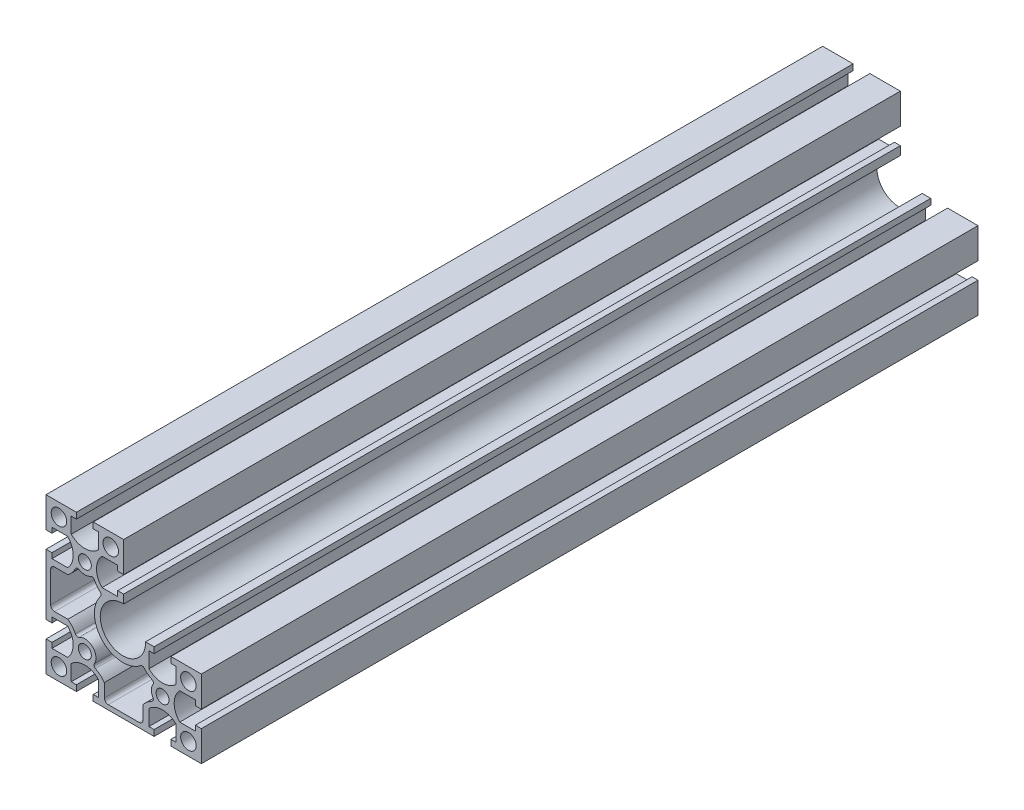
ISO-10303-21;
HEADER;
FILE_DESCRIPTION(('STEP AP214'),'2;1');
FILE_NAME('part.step','',(''),(''),'','','');
FILE_SCHEMA(('AUTOMOTIVE_DESIGN { 1 0 10303 214 1 1 1 1 }'));
ENDSEC;
DATA;
#1=APPLICATION_CONTEXT('core data for automotive mechanical design processes');
#2=APPLICATION_PROTOCOL_DEFINITION('international standard','automotive_design',2000,#1);
#3=PRODUCT_CONTEXT('',#1,'mechanical');
#4=PRODUCT('Part','Part','',(#3));
#5=PRODUCT_RELATED_PRODUCT_CATEGORY('part','',(#4));
#6=PRODUCT_DEFINITION_FORMATION('','',#4);
#7=PRODUCT_DEFINITION_CONTEXT('part definition',#1,'design');
#8=PRODUCT_DEFINITION('design','',#6,#7);
#9=PRODUCT_DEFINITION_SHAPE('','',#8);
#10=(LENGTH_UNIT() NAMED_UNIT(*) SI_UNIT(.MILLI.,.METRE.));
#11=(NAMED_UNIT(*) PLANE_ANGLE_UNIT() SI_UNIT($,.RADIAN.));
#12=(NAMED_UNIT(*) SI_UNIT($,.STERADIAN.) SOLID_ANGLE_UNIT());
#13=UNCERTAINTY_MEASURE_WITH_UNIT(LENGTH_MEASURE(1.E-05),#10,'distance_accuracy_value','');
#14=(GEOMETRIC_REPRESENTATION_CONTEXT(3) GLOBAL_UNCERTAINTY_ASSIGNED_CONTEXT((#13)) GLOBAL_UNIT_ASSIGNED_CONTEXT((#10,
#11,#12)) REPRESENTATION_CONTEXT('',''));
#15=CARTESIAN_POINT('',(0.,0.,0.));
#16=DIRECTION('',(0.,0.,1.));
#17=DIRECTION('',(1.,0.,0.));
#18=AXIS2_PLACEMENT_3D('',#15,#16,#17);
#19=CARTESIAN_POINT('',(2000.42297708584,709.107255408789,300.));
#20=DIRECTION('',(0.,0.,1.));
#21=DIRECTION('',(1.,0.,0.));
#22=AXIS2_PLACEMENT_3D('',#19,#20,#21);
#23=PLANE('',#22);
#24=CARTESIAN_POINT('',(2010.42297708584,707.107255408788,300.));
#25=DIRECTION('',(0.,0.,1.));
#26=DIRECTION('',(1.,0.,0.));
#27=AXIS2_PLACEMENT_3D('',#24,#25,#26);
#28=CIRCLE('',#27,3.00000000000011);
#29=CARTESIAN_POINT('',(2013.42297708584,707.107255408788,300.));
#30=VERTEX_POINT('',#29);
#31=EDGE_CURVE('E853',#30,#30,#28,.T.);
#32=ORIENTED_EDGE('',*,*,#31,.F.);
#33=EDGE_LOOP('',(#32));
#34=FACE_BOUND('',#33,.T.);
#35=CARTESIAN_POINT('',(2010.42297708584,687.107255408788,300.));
#36=DIRECTION('',(0.,0.,1.));
#37=DIRECTION('',(1.,0.,0.));
#38=AXIS2_PLACEMENT_3D('',#35,#36,#37);
#39=CIRCLE('',#38,3.00000000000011);
#40=CARTESIAN_POINT('',(2013.42297708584,687.107255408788,300.));
#41=VERTEX_POINT('',#40);
#42=EDGE_CURVE('E865',#41,#41,#39,.T.);
#43=ORIENTED_EDGE('',*,*,#42,.F.);
#44=EDGE_LOOP('',(#43));
#45=FACE_BOUND('',#44,.T.);
#46=CARTESIAN_POINT('',(1960.42297708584,737.107255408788,300.));
#47=DIRECTION('',(0.,0.,1.));
#48=DIRECTION('',(1.,0.,0.));
#49=AXIS2_PLACEMENT_3D('',#46,#47,#48);
#50=CIRCLE('',#49,2.99999999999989);
#51=CARTESIAN_POINT('',(1963.42297708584,737.107255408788,300.));
#52=VERTEX_POINT('',#51);
#53=EDGE_CURVE('E877',#52,#52,#50,.T.);
#54=ORIENTED_EDGE('',*,*,#53,.F.);
#55=EDGE_LOOP('',(#54));
#56=FACE_BOUND('',#55,.T.);
#57=CARTESIAN_POINT('',(1970.42297708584,697.107255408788,300.));
#58=DIRECTION('',(0.,0.,1.));
#59=DIRECTION('',(1.,0.,0.));
#60=AXIS2_PLACEMENT_3D('',#57,#58,#59);
#61=CIRCLE('',#60,2.49999999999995);
#62=CARTESIAN_POINT('',(1972.92297708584,697.107255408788,300.));
#63=VERTEX_POINT('',#62);
#64=EDGE_CURVE('E889',#63,#63,#61,.T.);
#65=ORIENTED_EDGE('',*,*,#64,.F.);
#66=EDGE_LOOP('',(#65));
#67=FACE_BOUND('',#66,.T.);
#68=CARTESIAN_POINT('',(2000.42297708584,709.107255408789,300.));
#69=DIRECTION('',(0.,0.,-1.));
#70=DIRECTION('',(1.,0.,0.));
#71=AXIS2_PLACEMENT_3D('',#68,#69,#70);
#72=CIRCLE('',#71,7.50000000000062);
#73=CARTESIAN_POINT('',(2005.67297708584,703.75118408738,300.));
#74=VERTEX_POINT('',#73);
#75=CARTESIAN_POINT('',(1995.17297708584,703.75118408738,300.));
#76=VERTEX_POINT('',#75);
#77=EDGE_CURVE('E901',#74,#76,#72,.T.);
#78=ORIENTED_EDGE('',*,*,#77,.T.);
#79=DIRECTION('',(0.,1.,0.));
#80=VECTOR('',#79,1.);
#81=CARTESIAN_POINT('',(1995.17297708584,709.807255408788,300.));
#82=LINE('',#81,#80);
#83=CARTESIAN_POINT('',(1995.17297708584,709.807255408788,300.));
#84=VERTEX_POINT('',#83);
#85=EDGE_CURVE('E904',#76,#84,#82,.T.);
#86=ORIENTED_EDGE('',*,*,#85,.T.);
#87=DIRECTION('',(1.,0.,0.));
#88=VECTOR('',#87,1.);
#89=CARTESIAN_POINT('',(1997.17297708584,709.807255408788,300.));
#90=LINE('',#89,#88);
#91=CARTESIAN_POINT('',(1997.17297708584,709.807255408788,300.));
#92=VERTEX_POINT('',#91);
#93=EDGE_CURVE('E907',#84,#92,#90,.T.);
#94=ORIENTED_EDGE('',*,*,#93,.T.);
#95=DIRECTION('',(0.,1.,0.));
#96=VECTOR('',#95,1.);
#97=CARTESIAN_POINT('',(1997.17297708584,712.107255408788,300.));
#98=LINE('',#97,#96);
#99=CARTESIAN_POINT('',(1997.17297708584,712.107255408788,300.));
#100=VERTEX_POINT('',#99);
#101=EDGE_CURVE('E909',#92,#100,#98,.T.);
#102=ORIENTED_EDGE('',*,*,#101,.T.);
#103=DIRECTION('',(-1.,0.,0.));
#104=VECTOR('',#103,1.);
#105=CARTESIAN_POINT('',(1993.86783271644,712.107255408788,300.));
#106=LINE('',#105,#104);
#107=CARTESIAN_POINT('',(1993.86783271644,712.107255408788,300.));
#108=VERTEX_POINT('',#107);
#109=EDGE_CURVE('E911',#100,#108,#106,.T.);
#110=ORIENTED_EDGE('',*,*,#109,.T.);
#111=CARTESIAN_POINT('',(1985.12297708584,711.807255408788,300.));
#112=DIRECTION('',(0.,0.,-1.));
#113=DIRECTION('',(1.,0.,0.));
#114=AXIS2_PLACEMENT_3D('',#111,#112,#113);
#115=CIRCLE('',#114,8.7500000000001);
#116=CARTESIAN_POINT('',(1985.42297708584,720.552111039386,300.));
#117=VERTEX_POINT('',#116);
#118=EDGE_CURVE('E913',#108,#117,#115,.T.);
#119=ORIENTED_EDGE('',*,*,#118,.T.);
#120=DIRECTION('',(0.,1.,0.));
#121=VECTOR('',#120,1.);
#122=CARTESIAN_POINT('',(1985.42297708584,723.857255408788,300.));
#123=LINE('',#122,#121);
#124=CARTESIAN_POINT('',(1985.42297708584,723.857255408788,300.));
#125=VERTEX_POINT('',#124);
#126=EDGE_CURVE('E915',#117,#125,#123,.T.);
#127=ORIENTED_EDGE('',*,*,#126,.T.);
#128=DIRECTION('',(-1.,0.,0.));
#129=VECTOR('',#128,1.);
#130=CARTESIAN_POINT('',(1983.12297708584,723.857255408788,300.));
#131=LINE('',#130,#129);
#132=CARTESIAN_POINT('',(1983.12297708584,723.857255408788,300.));
#133=VERTEX_POINT('',#132);
#134=EDGE_CURVE('E917',#125,#133,#131,.T.);
#135=ORIENTED_EDGE('',*,*,#134,.T.);
#136=DIRECTION('',(0.,-1.,0.));
#137=VECTOR('',#136,1.);
#138=CARTESIAN_POINT('',(1983.12297708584,721.857255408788,300.));
#139=LINE('',#138,#137);
#140=CARTESIAN_POINT('',(1983.12297708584,721.857255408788,300.));
#141=VERTEX_POINT('',#140);
#142=EDGE_CURVE('E919',#133,#141,#139,.T.);
#143=ORIENTED_EDGE('',*,*,#142,.T.);
#144=DIRECTION('',(-1.,0.,0.));
#145=VECTOR('',#144,1.);
#146=CARTESIAN_POINT('',(1977.06690576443,721.857255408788,300.));
#147=LINE('',#146,#145);
#148=CARTESIAN_POINT('',(1977.06690576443,721.857255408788,300.));
#149=VERTEX_POINT('',#148);
#150=EDGE_CURVE('E921',#141,#149,#147,.T.);
#151=ORIENTED_EDGE('',*,*,#150,.T.);
#152=CARTESIAN_POINT('',(1982.42297708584,727.107255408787,300.));
#153=DIRECTION('',(0.,0.,-1.));
#154=DIRECTION('',(1.,0.,0.));
#155=AXIS2_PLACEMENT_3D('',#152,#153,#154);
#156=CIRCLE('',#155,7.49999999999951);
#157=CARTESIAN_POINT('',(1977.06690576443,732.357255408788,300.));
#158=VERTEX_POINT('',#157);
#159=EDGE_CURVE('E923',#149,#158,#156,.T.);
#160=ORIENTED_EDGE('',*,*,#159,.T.);
#161=DIRECTION('',(1.,0.,0.));
#162=VECTOR('',#161,1.);
#163=CARTESIAN_POINT('',(1983.12297708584,732.357255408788,300.));
#164=LINE('',#163,#162);
#165=CARTESIAN_POINT('',(1983.12297708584,732.357255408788,300.));
#166=VERTEX_POINT('',#165);
#167=EDGE_CURVE('E925',#158,#166,#164,.T.);
#168=ORIENTED_EDGE('',*,*,#167,.T.);
#169=DIRECTION('',(0.,-1.,0.));
#170=VECTOR('',#169,1.);
#171=CARTESIAN_POINT('',(1983.12297708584,730.357255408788,300.));
#172=LINE('',#171,#170);
#173=CARTESIAN_POINT('',(1983.12297708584,730.357255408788,300.));
#174=VERTEX_POINT('',#173);
#175=EDGE_CURVE('E927',#166,#174,#172,.T.);
#176=ORIENTED_EDGE('',*,*,#175,.T.);
#177=DIRECTION('',(1.,0.,0.));
#178=VECTOR('',#177,1.);
#179=CARTESIAN_POINT('',(1985.42297708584,730.357255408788,300.));
#180=LINE('',#179,#178);
#181=CARTESIAN_POINT('',(1985.42297708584,730.357255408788,300.));
#182=VERTEX_POINT('',#181);
#183=EDGE_CURVE('E929',#174,#182,#180,.T.);
#184=ORIENTED_EDGE('',*,*,#183,.T.);
#185=DIRECTION('',(0.,1.,0.));
#186=VECTOR('',#185,1.);
#187=CARTESIAN_POINT('',(1985.42297708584,742.107255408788,300.));
#188=LINE('',#187,#186);
#189=CARTESIAN_POINT('',(1985.42297708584,742.107255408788,300.));
#190=VERTEX_POINT('',#189);
#191=EDGE_CURVE('E931',#182,#190,#188,.T.);
#192=ORIENTED_EDGE('',*,*,#191,.T.);
#193=DIRECTION('',(-1.,0.,0.));
#194=VECTOR('',#193,1.);
#195=CARTESIAN_POINT('',(1973.67297708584,742.107255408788,300.));
#196=LINE('',#195,#194);
#197=CARTESIAN_POINT('',(1973.67297708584,742.107255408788,300.));
#198=VERTEX_POINT('',#197);
#199=EDGE_CURVE('E933',#190,#198,#196,.T.);
#200=ORIENTED_EDGE('',*,*,#199,.T.);
#201=DIRECTION('',(0.,-1.,0.));
#202=VECTOR('',#201,1.);
#203=CARTESIAN_POINT('',(1973.67297708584,739.807255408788,300.));
#204=LINE('',#203,#202);
#205=CARTESIAN_POINT('',(1973.67297708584,739.807255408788,300.));
#206=VERTEX_POINT('',#205);
#207=EDGE_CURVE('E935',#198,#206,#204,.T.);
#208=ORIENTED_EDGE('',*,*,#207,.T.);
#209=DIRECTION('',(1.,0.,0.));
#210=VECTOR('',#209,1.);
#211=CARTESIAN_POINT('',(1975.67297708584,739.807255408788,300.));
#212=LINE('',#211,#210);
#213=CARTESIAN_POINT('',(1975.67297708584,739.807255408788,300.));
#214=VERTEX_POINT('',#213);
#215=EDGE_CURVE('E937',#206,#214,#212,.T.);
#216=ORIENTED_EDGE('',*,*,#215,.T.);
#217=DIRECTION('',(0.,-1.,0.));
#218=VECTOR('',#217,1.);
#219=CARTESIAN_POINT('',(1975.67297708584,733.75118408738,300.));
#220=LINE('',#219,#218);
#221=CARTESIAN_POINT('',(1975.67297708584,733.75118408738,300.));
#222=VERTEX_POINT('',#221);
#223=EDGE_CURVE('E939',#214,#222,#220,.T.);
#224=ORIENTED_EDGE('',*,*,#223,.T.);
#225=CARTESIAN_POINT('',(1970.42297708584,739.107255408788,300.));
#226=DIRECTION('',(0.,0.,-1.));
#227=DIRECTION('',(1.,0.,0.));
#228=AXIS2_PLACEMENT_3D('',#225,#226,#227);
#229=CIRCLE('',#228,7.49999999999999);
#230=CARTESIAN_POINT('',(1965.17297708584,733.75118408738,300.));
#231=VERTEX_POINT('',#230);
#232=EDGE_CURVE('E941',#222,#231,#229,.T.);
#233=ORIENTED_EDGE('',*,*,#232,.T.);
#234=DIRECTION('',(0.,1.,0.));
#235=VECTOR('',#234,1.);
#236=CARTESIAN_POINT('',(1965.17297708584,739.807255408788,300.));
#237=LINE('',#236,#235);
#238=CARTESIAN_POINT('',(1965.17297708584,739.807255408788,300.));
#239=VERTEX_POINT('',#238);
#240=EDGE_CURVE('E943',#231,#239,#237,.T.);
#241=ORIENTED_EDGE('',*,*,#240,.T.);
#242=DIRECTION('',(1.,0.,0.));
#243=VECTOR('',#242,1.);
#244=CARTESIAN_POINT('',(1967.17297708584,739.807255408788,300.));
#245=LINE('',#244,#243);
#246=CARTESIAN_POINT('',(1967.17297708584,739.807255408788,300.));
#247=VERTEX_POINT('',#246);
#248=EDGE_CURVE('E945',#239,#247,#245,.T.);
#249=ORIENTED_EDGE('',*,*,#248,.T.);
#250=DIRECTION('',(0.,1.,0.));
#251=VECTOR('',#250,1.);
#252=CARTESIAN_POINT('',(1967.17297708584,742.107255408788,300.));
#253=LINE('',#252,#251);
#254=CARTESIAN_POINT('',(1967.17297708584,742.107255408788,300.));
#255=VERTEX_POINT('',#254);
#256=EDGE_CURVE('E947',#247,#255,#253,.T.);
#257=ORIENTED_EDGE('',*,*,#256,.T.);
#258=DIRECTION('',(-1.,0.,0.));
#259=VECTOR('',#258,1.);
#260=CARTESIAN_POINT('',(1955.42297708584,742.107255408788,300.));
#261=LINE('',#260,#259);
#262=CARTESIAN_POINT('',(1955.42297708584,742.107255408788,300.));
#263=VERTEX_POINT('',#262);
#264=EDGE_CURVE('E949',#255,#263,#261,.T.);
#265=ORIENTED_EDGE('',*,*,#264,.T.);
#266=DIRECTION('',(0.,-1.,0.));
#267=VECTOR('',#266,1.);
#268=CARTESIAN_POINT('',(1955.42297708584,730.357255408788,300.));
#269=LINE('',#268,#267);
#270=CARTESIAN_POINT('',(1955.42297708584,730.357255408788,300.));
#271=VERTEX_POINT('',#270);
#272=EDGE_CURVE('E951',#263,#271,#269,.T.);
#273=ORIENTED_EDGE('',*,*,#272,.T.);
#274=DIRECTION('',(1.,0.,0.));
#275=VECTOR('',#274,1.);
#276=CARTESIAN_POINT('',(1957.72297708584,730.357255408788,300.));
#277=LINE('',#276,#275);
#278=CARTESIAN_POINT('',(1957.72297708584,730.357255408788,300.));
#279=VERTEX_POINT('',#278);
#280=EDGE_CURVE('E953',#271,#279,#277,.T.);
#281=ORIENTED_EDGE('',*,*,#280,.T.);
#282=DIRECTION('',(0.,1.,0.));
#283=VECTOR('',#282,1.);
#284=CARTESIAN_POINT('',(1957.72297708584,732.357255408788,300.));
#285=LINE('',#284,#283);
#286=CARTESIAN_POINT('',(1957.72297708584,732.357255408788,300.));
#287=VERTEX_POINT('',#286);
#288=EDGE_CURVE('E955',#279,#287,#285,.T.);
#289=ORIENTED_EDGE('',*,*,#288,.T.);
#290=DIRECTION('',(1.,0.,0.));
#291=VECTOR('',#290,1.);
#292=CARTESIAN_POINT('',(1963.77904840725,732.357255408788,300.));
#293=LINE('',#292,#291);
#294=CARTESIAN_POINT('',(1963.77904840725,732.357255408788,300.));
#295=VERTEX_POINT('',#294);
#296=EDGE_CURVE('E957',#287,#295,#293,.T.);
#297=ORIENTED_EDGE('',*,*,#296,.T.);
#298=CARTESIAN_POINT('',(1958.42297708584,727.107255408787,300.));
#299=DIRECTION('',(0.,0.,-1.));
#300=DIRECTION('',(1.,0.,0.));
#301=AXIS2_PLACEMENT_3D('',#298,#299,#300);
#302=CIRCLE('',#301,7.49999999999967);
#303=CARTESIAN_POINT('',(1963.77904840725,721.857255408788,300.));
#304=VERTEX_POINT('',#303);
#305=EDGE_CURVE('E959',#295,#304,#302,.T.);
#306=ORIENTED_EDGE('',*,*,#305,.T.);
#307=DIRECTION('',(-1.,0.,0.));
#308=VECTOR('',#307,1.);
#309=CARTESIAN_POINT('',(1957.72297708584,721.857255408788,300.));
#310=LINE('',#309,#308);
#311=CARTESIAN_POINT('',(1957.72297708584,721.857255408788,300.));
#312=VERTEX_POINT('',#311);
#313=EDGE_CURVE('E961',#304,#312,#310,.T.);
#314=ORIENTED_EDGE('',*,*,#313,.T.);
#315=DIRECTION('',(0.,1.,0.));
#316=VECTOR('',#315,1.);
#317=CARTESIAN_POINT('',(1957.72297708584,723.857255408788,300.));
#318=LINE('',#317,#316);
#319=CARTESIAN_POINT('',(1957.72297708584,723.857255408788,300.));
#320=VERTEX_POINT('',#319);
#321=EDGE_CURVE('E963',#312,#320,#318,.T.);
#322=ORIENTED_EDGE('',*,*,#321,.T.);
#323=DIRECTION('',(-1.,0.,0.));
#324=VECTOR('',#323,1.);
#325=CARTESIAN_POINT('',(1955.42297708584,723.857255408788,300.));
#326=LINE('',#325,#324);
#327=CARTESIAN_POINT('',(1955.42297708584,723.857255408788,300.));
#328=VERTEX_POINT('',#327);
#329=EDGE_CURVE('E965',#320,#328,#326,.T.);
#330=ORIENTED_EDGE('',*,*,#329,.T.);
#331=DIRECTION('',(0.,-1.,0.));
#332=VECTOR('',#331,1.);
#333=CARTESIAN_POINT('',(1955.42297708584,700.357255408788,300.));
#334=LINE('',#333,#332);
#335=CARTESIAN_POINT('',(1955.42297708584,700.357255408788,300.));
#336=VERTEX_POINT('',#335);
#337=EDGE_CURVE('E967',#328,#336,#334,.T.);
#338=ORIENTED_EDGE('',*,*,#337,.T.);
#339=DIRECTION('',(1.,0.,0.));
#340=VECTOR('',#339,1.);
#341=CARTESIAN_POINT('',(1957.72297708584,700.357255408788,300.));
#342=LINE('',#341,#340);
#343=CARTESIAN_POINT('',(1957.72297708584,700.357255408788,300.));
#344=VERTEX_POINT('',#343);
#345=EDGE_CURVE('E969',#336,#344,#342,.T.);
#346=ORIENTED_EDGE('',*,*,#345,.T.);
#347=DIRECTION('',(0.,1.,0.));
#348=VECTOR('',#347,1.);
#349=CARTESIAN_POINT('',(1957.72297708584,702.357255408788,300.));
#350=LINE('',#349,#348);
#351=CARTESIAN_POINT('',(1957.72297708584,702.357255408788,300.));
#352=VERTEX_POINT('',#351);
#353=EDGE_CURVE('E971',#344,#352,#350,.T.);
#354=ORIENTED_EDGE('',*,*,#353,.T.);
#355=DIRECTION('',(1.,0.,0.));
#356=VECTOR('',#355,1.);
#357=CARTESIAN_POINT('',(1963.77904840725,702.357255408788,300.));
#358=LINE('',#357,#356);
#359=CARTESIAN_POINT('',(1963.77904840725,702.357255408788,300.));
#360=VERTEX_POINT('',#359);
#361=EDGE_CURVE('E973',#352,#360,#358,.T.);
#362=ORIENTED_EDGE('',*,*,#361,.T.);
#363=CARTESIAN_POINT('',(1958.42297708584,697.107255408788,300.));
#364=DIRECTION('',(0.,0.,-1.));
#365=DIRECTION('',(1.,0.,0.));
#366=AXIS2_PLACEMENT_3D('',#363,#364,#365);
#367=CIRCLE('',#366,7.50000000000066);
#368=CARTESIAN_POINT('',(1963.77904840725,691.857255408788,300.));
#369=VERTEX_POINT('',#368);
#370=EDGE_CURVE('E975',#360,#369,#367,.T.);
#371=ORIENTED_EDGE('',*,*,#370,.T.);
#372=DIRECTION('',(-1.,0.,0.));
#373=VECTOR('',#372,1.);
#374=CARTESIAN_POINT('',(1957.72297708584,691.857255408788,300.));
#375=LINE('',#374,#373);
#376=CARTESIAN_POINT('',(1957.72297708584,691.857255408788,300.));
#377=VERTEX_POINT('',#376);
#378=EDGE_CURVE('E977',#369,#377,#375,.T.);
#379=ORIENTED_EDGE('',*,*,#378,.T.);
#380=DIRECTION('',(0.,1.,0.));
#381=VECTOR('',#380,1.);
#382=CARTESIAN_POINT('',(1957.72297708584,693.857255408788,300.));
#383=LINE('',#382,#381);
#384=CARTESIAN_POINT('',(1957.72297708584,693.857255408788,300.));
#385=VERTEX_POINT('',#384);
#386=EDGE_CURVE('E979',#377,#385,#383,.T.);
#387=ORIENTED_EDGE('',*,*,#386,.T.);
#388=DIRECTION('',(-1.,0.,0.));
#389=VECTOR('',#388,1.);
#390=CARTESIAN_POINT('',(1955.42297708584,693.857255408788,300.));
#391=LINE('',#390,#389);
#392=CARTESIAN_POINT('',(1955.42297708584,693.857255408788,300.));
#393=VERTEX_POINT('',#392);
#394=EDGE_CURVE('E981',#385,#393,#391,.T.);
#395=ORIENTED_EDGE('',*,*,#394,.T.);
#396=DIRECTION('',(0.,-1.,0.));
#397=VECTOR('',#396,1.);
#398=CARTESIAN_POINT('',(1955.42297708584,682.107255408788,300.));
#399=LINE('',#398,#397);
#400=CARTESIAN_POINT('',(1955.42297708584,682.107255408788,300.));
#401=VERTEX_POINT('',#400);
#402=EDGE_CURVE('E983',#393,#401,#399,.T.);
#403=ORIENTED_EDGE('',*,*,#402,.T.);
#404=DIRECTION('',(1.,0.,0.));
#405=VECTOR('',#404,1.);
#406=CARTESIAN_POINT('',(1967.17297708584,682.107255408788,300.));
#407=LINE('',#406,#405);
#408=CARTESIAN_POINT('',(1967.17297708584,682.107255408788,300.));
#409=VERTEX_POINT('',#408);
#410=EDGE_CURVE('E985',#401,#409,#407,.T.);
#411=ORIENTED_EDGE('',*,*,#410,.T.);
#412=DIRECTION('',(0.,1.,0.));
#413=VECTOR('',#412,1.);
#414=CARTESIAN_POINT('',(1967.17297708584,684.407255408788,300.));
#415=LINE('',#414,#413);
#416=CARTESIAN_POINT('',(1967.17297708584,684.407255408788,300.));
#417=VERTEX_POINT('',#416);
#418=EDGE_CURVE('E987',#409,#417,#415,.T.);
#419=ORIENTED_EDGE('',*,*,#418,.T.);
#420=DIRECTION('',(-1.,0.,0.));
#421=VECTOR('',#420,1.);
#422=CARTESIAN_POINT('',(1965.17297708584,684.407255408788,300.));
#423=LINE('',#422,#421);
#424=CARTESIAN_POINT('',(1965.17297708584,684.407255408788,300.));
#425=VERTEX_POINT('',#424);
#426=EDGE_CURVE('E989',#417,#425,#423,.T.);
#427=ORIENTED_EDGE('',*,*,#426,.T.);
#428=DIRECTION('',(0.,1.,0.));
#429=VECTOR('',#428,1.);
#430=CARTESIAN_POINT('',(1965.17297708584,690.463326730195,300.));
#431=LINE('',#430,#429);
#432=CARTESIAN_POINT('',(1965.17297708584,690.463326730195,300.));
#433=VERTEX_POINT('',#432);
#434=EDGE_CURVE('E991',#425,#433,#431,.T.);
#435=ORIENTED_EDGE('',*,*,#434,.T.);
#436=CARTESIAN_POINT('',(1970.42297708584,685.107255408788,300.));
#437=DIRECTION('',(0.,0.,-1.));
#438=DIRECTION('',(1.,0.,0.));
#439=AXIS2_PLACEMENT_3D('',#436,#437,#438);
#440=CIRCLE('',#439,7.50000000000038);
#441=CARTESIAN_POINT('',(1975.67297708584,690.463326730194,300.));
#442=VERTEX_POINT('',#441);
#443=EDGE_CURVE('E993',#433,#442,#440,.T.);
#444=ORIENTED_EDGE('',*,*,#443,.T.);
#445=DIRECTION('',(0.,-1.,0.));
#446=VECTOR('',#445,1.);
#447=CARTESIAN_POINT('',(1975.67297708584,684.407255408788,300.));
#448=LINE('',#447,#446);
#449=CARTESIAN_POINT('',(1975.67297708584,684.407255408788,300.));
#450=VERTEX_POINT('',#449);
#451=EDGE_CURVE('E995',#442,#450,#448,.T.);
#452=ORIENTED_EDGE('',*,*,#451,.T.);
#453=DIRECTION('',(-1.,0.,0.));
#454=VECTOR('',#453,1.);
#455=CARTESIAN_POINT('',(1973.67297708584,684.407255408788,300.));
#456=LINE('',#455,#454);
#457=CARTESIAN_POINT('',(1973.67297708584,684.407255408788,300.));
#458=VERTEX_POINT('',#457);
#459=EDGE_CURVE('E997',#450,#458,#456,.T.);
#460=ORIENTED_EDGE('',*,*,#459,.T.);
#461=DIRECTION('',(0.,-1.,0.));
#462=VECTOR('',#461,1.);
#463=CARTESIAN_POINT('',(1973.67297708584,682.107255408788,300.));
#464=LINE('',#463,#462);
#465=CARTESIAN_POINT('',(1973.67297708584,682.107255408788,300.));
#466=VERTEX_POINT('',#465);
#467=EDGE_CURVE('E999',#458,#466,#464,.T.);
#468=ORIENTED_EDGE('',*,*,#467,.T.);
#469=DIRECTION('',(1.,0.,0.));
#470=VECTOR('',#469,1.);
#471=CARTESIAN_POINT('',(1997.17297708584,682.107255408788,300.));
#472=LINE('',#471,#470);
#473=CARTESIAN_POINT('',(1997.17297708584,682.107255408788,300.));
#474=VERTEX_POINT('',#473);
#475=EDGE_CURVE('E1001',#466,#474,#472,.T.);
#476=ORIENTED_EDGE('',*,*,#475,.T.);
#477=DIRECTION('',(0.,1.,0.));
#478=VECTOR('',#477,1.);
#479=CARTESIAN_POINT('',(1997.17297708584,684.407255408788,300.));
#480=LINE('',#479,#478);
#481=CARTESIAN_POINT('',(1997.17297708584,684.407255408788,300.));
#482=VERTEX_POINT('',#481);
#483=EDGE_CURVE('E1003',#474,#482,#480,.T.);
#484=ORIENTED_EDGE('',*,*,#483,.T.);
#485=DIRECTION('',(-1.,0.,0.));
#486=VECTOR('',#485,1.);
#487=CARTESIAN_POINT('',(1995.17297708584,684.407255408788,300.));
#488=LINE('',#487,#486);
#489=CARTESIAN_POINT('',(1995.17297708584,684.407255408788,300.));
#490=VERTEX_POINT('',#489);
#491=EDGE_CURVE('E1005',#482,#490,#488,.T.);
#492=ORIENTED_EDGE('',*,*,#491,.T.);
#493=DIRECTION('',(0.,1.,0.));
#494=VECTOR('',#493,1.);
#495=CARTESIAN_POINT('',(1995.17297708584,690.463326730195,300.));
#496=LINE('',#495,#494);
#497=CARTESIAN_POINT('',(1995.17297708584,690.463326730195,300.));
#498=VERTEX_POINT('',#497);
#499=EDGE_CURVE('E1007',#490,#498,#496,.T.);
#500=ORIENTED_EDGE('',*,*,#499,.T.);
#501=CARTESIAN_POINT('',(2000.42297708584,685.107255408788,300.));
#502=DIRECTION('',(0.,0.,-1.));
#503=DIRECTION('',(1.,0.,0.));
#504=AXIS2_PLACEMENT_3D('',#501,#502,#503);
#505=CIRCLE('',#504,7.49999999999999);
#506=CARTESIAN_POINT('',(2005.67297708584,690.463326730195,300.));
#507=VERTEX_POINT('',#506);
#508=EDGE_CURVE('E1009',#498,#507,#505,.T.);
#509=ORIENTED_EDGE('',*,*,#508,.T.);
#510=DIRECTION('',(0.,-1.,0.));
#511=VECTOR('',#510,1.);
#512=CARTESIAN_POINT('',(2005.67297708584,684.407255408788,300.));
#513=LINE('',#512,#511);
#514=CARTESIAN_POINT('',(2005.67297708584,684.407255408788,300.));
#515=VERTEX_POINT('',#514);
#516=EDGE_CURVE('E1011',#507,#515,#513,.T.);
#517=ORIENTED_EDGE('',*,*,#516,.T.);
#518=DIRECTION('',(-1.,0.,0.));
#519=VECTOR('',#518,1.);
#520=CARTESIAN_POINT('',(2003.67297708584,684.407255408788,300.));
#521=LINE('',#520,#519);
#522=CARTESIAN_POINT('',(2003.67297708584,684.407255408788,300.));
#523=VERTEX_POINT('',#522);
#524=EDGE_CURVE('E1013',#515,#523,#521,.T.);
#525=ORIENTED_EDGE('',*,*,#524,.T.);
#526=DIRECTION('',(0.,-1.,0.));
#527=VECTOR('',#526,1.);
#528=CARTESIAN_POINT('',(2003.67297708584,682.107255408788,300.));
#529=LINE('',#528,#527);
#530=CARTESIAN_POINT('',(2003.67297708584,682.107255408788,300.));
#531=VERTEX_POINT('',#530);
#532=EDGE_CURVE('E1015',#523,#531,#529,.T.);
#533=ORIENTED_EDGE('',*,*,#532,.T.);
#534=DIRECTION('',(1.,0.,0.));
#535=VECTOR('',#534,1.);
#536=CARTESIAN_POINT('',(2015.42297708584,682.107255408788,300.));
#537=LINE('',#536,#535);
#538=CARTESIAN_POINT('',(2015.42297708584,682.107255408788,300.));
#539=VERTEX_POINT('',#538);
#540=EDGE_CURVE('E1017',#531,#539,#537,.T.);
#541=ORIENTED_EDGE('',*,*,#540,.T.);
#542=DIRECTION('',(0.,1.,0.));
#543=VECTOR('',#542,1.);
#544=CARTESIAN_POINT('',(2015.42297708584,693.857255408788,300.));
#545=LINE('',#544,#543);
#546=CARTESIAN_POINT('',(2015.42297708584,693.857255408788,300.));
#547=VERTEX_POINT('',#546);
#548=EDGE_CURVE('E1019',#539,#547,#545,.T.);
#549=ORIENTED_EDGE('',*,*,#548,.T.);
#550=DIRECTION('',(-1.,0.,0.));
#551=VECTOR('',#550,1.);
#552=CARTESIAN_POINT('',(2013.12297708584,693.857255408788,300.));
#553=LINE('',#552,#551);
#554=CARTESIAN_POINT('',(2013.12297708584,693.857255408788,300.));
#555=VERTEX_POINT('',#554);
#556=EDGE_CURVE('E1021',#547,#555,#553,.T.);
#557=ORIENTED_EDGE('',*,*,#556,.T.);
#558=DIRECTION('',(0.,-1.,0.));
#559=VECTOR('',#558,1.);
#560=CARTESIAN_POINT('',(2013.12297708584,691.857255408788,300.));
#561=LINE('',#560,#559);
#562=CARTESIAN_POINT('',(2013.12297708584,691.857255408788,300.));
#563=VERTEX_POINT('',#562);
#564=EDGE_CURVE('E1023',#555,#563,#561,.T.);
#565=ORIENTED_EDGE('',*,*,#564,.T.);
#566=DIRECTION('',(-1.,0.,0.));
#567=VECTOR('',#566,1.);
#568=CARTESIAN_POINT('',(2007.06690576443,691.857255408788,300.));
#569=LINE('',#568,#567);
#570=CARTESIAN_POINT('',(2007.06690576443,691.857255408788,300.));
#571=VERTEX_POINT('',#570);
#572=EDGE_CURVE('E1025',#563,#571,#569,.T.);
#573=ORIENTED_EDGE('',*,*,#572,.T.);
#574=CARTESIAN_POINT('',(2012.42297708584,697.107255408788,300.));
#575=DIRECTION('',(0.,0.,-1.));
#576=DIRECTION('',(1.,0.,0.));
#577=AXIS2_PLACEMENT_3D('',#574,#575,#576);
#578=CIRCLE('',#577,7.50000000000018);
#579=CARTESIAN_POINT('',(2007.06690576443,702.357255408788,300.));
#580=VERTEX_POINT('',#579);
#581=EDGE_CURVE('E1027',#571,#580,#578,.T.);
#582=ORIENTED_EDGE('',*,*,#581,.T.);
#583=DIRECTION('',(1.,0.,0.));
#584=VECTOR('',#583,1.);
#585=CARTESIAN_POINT('',(2013.12297708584,702.357255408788,300.));
#586=LINE('',#585,#584);
#587=CARTESIAN_POINT('',(2013.12297708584,702.357255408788,300.));
#588=VERTEX_POINT('',#587);
#589=EDGE_CURVE('E1029',#580,#588,#586,.T.);
#590=ORIENTED_EDGE('',*,*,#589,.T.);
#591=DIRECTION('',(0.,-1.,0.));
#592=VECTOR('',#591,1.);
#593=CARTESIAN_POINT('',(2013.12297708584,700.357255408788,300.));
#594=LINE('',#593,#592);
#595=CARTESIAN_POINT('',(2013.12297708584,700.357255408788,300.));
#596=VERTEX_POINT('',#595);
#597=EDGE_CURVE('E1031',#588,#596,#594,.T.);
#598=ORIENTED_EDGE('',*,*,#597,.T.);
#599=DIRECTION('',(1.,0.,0.));
#600=VECTOR('',#599,1.);
#601=CARTESIAN_POINT('',(2015.42297708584,700.357255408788,300.));
#602=LINE('',#601,#600);
#603=CARTESIAN_POINT('',(2015.42297708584,700.357255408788,300.));
#604=VERTEX_POINT('',#603);
#605=EDGE_CURVE('E1033',#596,#604,#602,.T.);
#606=ORIENTED_EDGE('',*,*,#605,.T.);
#607=DIRECTION('',(0.,1.,0.));
#608=VECTOR('',#607,1.);
#609=CARTESIAN_POINT('',(2015.42297708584,712.107255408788,300.));
#610=LINE('',#609,#608);
#611=CARTESIAN_POINT('',(2015.42297708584,712.107255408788,300.));
#612=VERTEX_POINT('',#611);
#613=EDGE_CURVE('E1035',#604,#612,#610,.T.);
#614=ORIENTED_EDGE('',*,*,#613,.T.);
#615=DIRECTION('',(-1.,0.,0.));
#616=VECTOR('',#615,1.);
#617=CARTESIAN_POINT('',(2003.67297708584,712.107255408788,300.));
#618=LINE('',#617,#616);
#619=CARTESIAN_POINT('',(2003.67297708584,712.107255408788,300.));
#620=VERTEX_POINT('',#619);
#621=EDGE_CURVE('E1037',#612,#620,#618,.T.);
#622=ORIENTED_EDGE('',*,*,#621,.T.);
#623=DIRECTION('',(0.,-1.,0.));
#624=VECTOR('',#623,1.);
#625=CARTESIAN_POINT('',(2003.67297708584,709.807255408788,300.));
#626=LINE('',#625,#624);
#627=CARTESIAN_POINT('',(2003.67297708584,709.807255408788,300.));
#628=VERTEX_POINT('',#627);
#629=EDGE_CURVE('E1039',#620,#628,#626,.T.);
#630=ORIENTED_EDGE('',*,*,#629,.T.);
#631=DIRECTION('',(1.,0.,0.));
#632=VECTOR('',#631,1.);
#633=CARTESIAN_POINT('',(2005.67297708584,709.807255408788,300.));
#634=LINE('',#633,#632);
#635=CARTESIAN_POINT('',(2005.67297708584,709.807255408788,300.));
#636=VERTEX_POINT('',#635);
#637=EDGE_CURVE('E1041',#628,#636,#634,.T.);
#638=ORIENTED_EDGE('',*,*,#637,.T.);
#639=DIRECTION('',(0.,-1.,0.));
#640=VECTOR('',#639,1.);
#641=CARTESIAN_POINT('',(2005.67297708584,703.75118408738,300.));
#642=LINE('',#641,#640);
#643=EDGE_CURVE('E1043',#636,#74,#642,.T.);
#644=ORIENTED_EDGE('',*,*,#643,.T.);
#645=EDGE_LOOP('',(#78,#86,#94,#102,#110,#119,#127,#135,#143,#151,#160,#168,#176,#184,#192,#200,
#208,#216,#224,#233,#241,#249,#257,#265,#273,#281,#289,#297,#306,#314,#322,#330,#338,#346,#354,
#362,#371,#379,#387,#395,#403,#411,#419,#427,#435,#444,#452,#460,#468,#476,#484,#492,#500,#509,
#517,#525,#533,#541,#549,#557,#565,#573,#582,#590,#598,#606,#614,#622,#630,#638,#644));
#646=FACE_BOUND('',#645,.T.);
#647=CARTESIAN_POINT('',(1960.42297708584,687.107255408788,300.));
#648=DIRECTION('',(0.,0.,1.));
#649=DIRECTION('',(1.,0.,0.));
#650=AXIS2_PLACEMENT_3D('',#647,#648,#649);
#651=CIRCLE('',#650,2.99999999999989);
#652=CARTESIAN_POINT('',(1963.42297708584,687.107255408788,300.));
#653=VERTEX_POINT('',#652);
#654=EDGE_CURVE('E895',#653,#653,#651,.T.);
#655=ORIENTED_EDGE('',*,*,#654,.F.);
#656=EDGE_LOOP('',(#655));
#657=FACE_BOUND('',#656,.T.);
#658=CARTESIAN_POINT('',(1970.42297708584,727.107255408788,300.));
#659=DIRECTION('',(0.,0.,1.));
#660=DIRECTION('',(1.,0.,0.));
#661=AXIS2_PLACEMENT_3D('',#658,#659,#660);
#662=CIRCLE('',#661,2.49999999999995);
#663=CARTESIAN_POINT('',(1972.92297708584,727.107255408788,300.));
#664=VERTEX_POINT('',#663);
#665=EDGE_CURVE('E883',#664,#664,#662,.T.);
#666=ORIENTED_EDGE('',*,*,#665,.F.);
#667=EDGE_LOOP('',(#666));
#668=FACE_BOUND('',#667,.T.);
#669=CARTESIAN_POINT('',(1980.42297708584,737.107255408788,300.));
#670=DIRECTION('',(0.,0.,1.));
#671=DIRECTION('',(1.,0.,0.));
#672=AXIS2_PLACEMENT_3D('',#669,#670,#671);
#673=CIRCLE('',#672,2.99999999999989);
#674=CARTESIAN_POINT('',(1983.42297708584,737.107255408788,300.));
#675=VERTEX_POINT('',#674);
#676=EDGE_CURVE('E871',#675,#675,#673,.T.);
#677=ORIENTED_EDGE('',*,*,#676,.F.);
#678=EDGE_LOOP('',(#677));
#679=FACE_BOUND('',#678,.T.);
#680=CARTESIAN_POINT('',(2000.42297708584,697.107255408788,300.));
#681=DIRECTION('',(0.,0.,1.));
#682=DIRECTION('',(1.,0.,0.));
#683=AXIS2_PLACEMENT_3D('',#680,#681,#682);
#684=CIRCLE('',#683,2.49999999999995);
#685=CARTESIAN_POINT('',(2002.92297708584,697.107255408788,300.));
#686=VERTEX_POINT('',#685);
#687=EDGE_CURVE('E859',#686,#686,#684,.T.);
#688=ORIENTED_EDGE('',*,*,#687,.F.);
#689=EDGE_LOOP('',(#688));
#690=FACE_BOUND('',#689,.T.);
#691=DIRECTION('',(0.,-1.,0.));
#692=VECTOR('',#691,1.);
#693=CARTESIAN_POINT('',(1977.97297708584,685.407255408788,300.));
#694=LINE('',#693,#692);
#695=CARTESIAN_POINT('',(1977.97297708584,690.537494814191,300.));
#696=VERTEX_POINT('',#695);
#697=CARTESIAN_POINT('',(1977.97297708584,685.407255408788,300.));
#698=VERTEX_POINT('',#697);
#699=EDGE_CURVE('E656',#696,#698,#694,.T.);
#700=ORIENTED_EDGE('',*,*,#699,.F.);
#701=CARTESIAN_POINT('',(1970.42297708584,685.107255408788,300.));
#702=DIRECTION('',(0.,0.,-1.));
#703=DIRECTION('',(1.,0.,0.));
#704=AXIS2_PLACEMENT_3D('',#701,#702,#703);
#705=CIRCLE('',#704,9.30000000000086);
#706=CARTESIAN_POINT('',(1974.51382895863,693.45919715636,300.));
#707=VERTEX_POINT('',#706);
#708=EDGE_CURVE('E648',#707,#696,#705,.T.);
#709=ORIENTED_EDGE('',*,*,#708,.F.);
#710=CARTESIAN_POINT('',(1974.95370550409,694.357255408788,300.));
#711=DIRECTION('',(0.,0.,1.));
#712=DIRECTION('',(1.,0.,0.));
#713=AXIS2_PLACEMENT_3D('',#710,#711,#712);
#714=CIRCLE('',#713,1.00000000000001);
#715=CARTESIAN_POINT('',(1974.09885108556,694.876123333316,300.));
#716=VERTEX_POINT('',#715);
#717=EDGE_CURVE('E721',#716,#707,#714,.T.);
#718=ORIENTED_EDGE('',*,*,#717,.F.);
#719=CARTESIAN_POINT('',(1970.42297708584,697.107255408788,300.));
#720=DIRECTION('',(0.,0.,-1.));
#721=DIRECTION('',(1.,0.,0.));
#722=AXIS2_PLACEMENT_3D('',#719,#720,#721);
#723=CIRCLE('',#722,4.29999999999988);
#724=CARTESIAN_POINT('',(1968.19184501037,700.783129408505,300.));
#725=VERTEX_POINT('',#724);
#726=EDGE_CURVE('E719',#725,#716,#723,.T.);
#727=ORIENTED_EDGE('',*,*,#726,.F.);
#728=CARTESIAN_POINT('',(1967.67297708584,701.637983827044,300.));
#729=DIRECTION('',(0.,0.,1.));
#730=DIRECTION('',(1.,0.,0.));
#731=AXIS2_PLACEMENT_3D('',#728,#729,#730);
#732=CIRCLE('',#731,0.999999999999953);
#733=CARTESIAN_POINT('',(1966.77491883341,701.198107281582,300.));
#734=VERTEX_POINT('',#733);
#735=EDGE_CURVE('E717',#734,#725,#732,.T.);
#736=ORIENTED_EDGE('',*,*,#735,.F.);
#737=CARTESIAN_POINT('',(1958.42297708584,697.107255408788,300.));
#738=DIRECTION('',(0.,0.,-1.));
#739=DIRECTION('',(1.,0.,0.));
#740=AXIS2_PLACEMENT_3D('',#737,#738,#739);
#741=CIRCLE('',#740,9.30000000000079);
#742=CARTESIAN_POINT('',(1963.85321649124,704.657255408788,300.));
#743=VERTEX_POINT('',#742);
#744=EDGE_CURVE('E715',#743,#734,#741,.T.);
#745=ORIENTED_EDGE('',*,*,#744,.F.);
#746=DIRECTION('',(1.,0.,0.));
#747=VECTOR('',#746,1.);
#748=CARTESIAN_POINT('',(1963.85321649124,704.657255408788,300.));
#749=LINE('',#748,#747);
#750=CARTESIAN_POINT('',(1958.72297708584,704.657255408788,300.));
#751=VERTEX_POINT('',#750);
#752=EDGE_CURVE('E713',#751,#743,#749,.T.);
#753=ORIENTED_EDGE('',*,*,#752,.F.);
#754=CARTESIAN_POINT('',(1958.72297708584,706.157255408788,300.));
#755=DIRECTION('',(0.,0.,1.));
#756=DIRECTION('',(1.,0.,0.));
#757=AXIS2_PLACEMENT_3D('',#754,#755,#756);
#758=CIRCLE('',#757,1.50000000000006);
#759=CARTESIAN_POINT('',(1957.22297708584,706.157255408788,300.));
#760=VERTEX_POINT('',#759);
#761=EDGE_CURVE('E711',#760,#751,#758,.T.);
#762=ORIENTED_EDGE('',*,*,#761,.F.);
#763=DIRECTION('',(0.,-1.,0.));
#764=VECTOR('',#763,1.);
#765=CARTESIAN_POINT('',(1957.22297708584,706.157255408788,300.));
#766=LINE('',#765,#764);
#767=CARTESIAN_POINT('',(1957.22297708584,718.057255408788,300.));
#768=VERTEX_POINT('',#767);
#769=EDGE_CURVE('E709',#768,#760,#766,.T.);
#770=ORIENTED_EDGE('',*,*,#769,.F.);
#771=CARTESIAN_POINT('',(1958.72297708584,718.057255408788,300.));
#772=DIRECTION('',(0.,0.,1.));
#773=DIRECTION('',(1.,0.,0.));
#774=AXIS2_PLACEMENT_3D('',#771,#772,#773);
#775=CIRCLE('',#774,1.5);
#776=CARTESIAN_POINT('',(1958.72297708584,719.557255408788,300.));
#777=VERTEX_POINT('',#776);
#778=EDGE_CURVE('E707',#777,#768,#775,.T.);
#779=ORIENTED_EDGE('',*,*,#778,.F.);
#780=DIRECTION('',(-1.,0.,0.));
#781=VECTOR('',#780,1.);
#782=CARTESIAN_POINT('',(1958.72297708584,719.557255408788,300.));
#783=LINE('',#782,#781);
#784=CARTESIAN_POINT('',(1963.85321649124,719.557255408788,300.));
#785=VERTEX_POINT('',#784);
#786=EDGE_CURVE('E705',#785,#777,#783,.T.);
#787=ORIENTED_EDGE('',*,*,#786,.F.);
#788=CARTESIAN_POINT('',(1958.42297708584,727.107255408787,300.));
#789=DIRECTION('',(0.,0.,-1.));
#790=DIRECTION('',(1.,0.,0.));
#791=AXIS2_PLACEMENT_3D('',#788,#789,#790);
#792=CIRCLE('',#791,9.29999999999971);
#793=CARTESIAN_POINT('',(1966.77491883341,723.016403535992,300.));
#794=VERTEX_POINT('',#793);
#795=EDGE_CURVE('E703',#794,#785,#792,.T.);
#796=ORIENTED_EDGE('',*,*,#795,.F.);
#797=CARTESIAN_POINT('',(1967.67297708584,722.576526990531,300.));
#798=DIRECTION('',(0.,0.,1.));
#799=DIRECTION('',(1.,0.,0.));
#800=AXIS2_PLACEMENT_3D('',#797,#798,#799);
#801=CIRCLE('',#800,1.00000000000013);
#802=CARTESIAN_POINT('',(1968.19184501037,723.43138140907,300.));
#803=VERTEX_POINT('',#802);
#804=EDGE_CURVE('E701',#803,#794,#801,.T.);
#805=ORIENTED_EDGE('',*,*,#804,.F.);
#806=CARTESIAN_POINT('',(1970.42297708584,727.107255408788,300.));
#807=DIRECTION('',(0.,0.,-1.));
#808=DIRECTION('',(1.,0.,0.));
#809=AXIS2_PLACEMENT_3D('',#806,#807,#808);
#810=CIRCLE('',#809,4.29999999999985);
#811=CARTESIAN_POINT('',(1972.65410916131,723.43138140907,300.));
#812=VERTEX_POINT('',#811);
#813=EDGE_CURVE('E699',#812,#803,#810,.T.);
#814=ORIENTED_EDGE('',*,*,#813,.F.);
#815=CARTESIAN_POINT('',(1973.17297708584,722.576526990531,300.));
#816=DIRECTION('',(0.,0.,1.));
#817=DIRECTION('',(1.,0.,0.));
#818=AXIS2_PLACEMENT_3D('',#815,#816,#817);
#819=CIRCLE('',#818,1.);
#820=CARTESIAN_POINT('',(1974.07103533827,723.016403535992,300.));
#821=VERTEX_POINT('',#820);
#822=EDGE_CURVE('E697',#821,#812,#819,.T.);
#823=ORIENTED_EDGE('',*,*,#822,.F.);
#824=CARTESIAN_POINT('',(1982.42297708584,727.107255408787,300.));
#825=DIRECTION('',(0.,0.,-1.));
#826=DIRECTION('',(1.,0.,0.));
#827=AXIS2_PLACEMENT_3D('',#824,#825,#826);
#828=CIRCLE('',#827,9.29999999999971);
#829=CARTESIAN_POINT('',(1976.38103629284,720.037251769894,300.));
#830=VERTEX_POINT('',#829);
#831=EDGE_CURVE('E695',#830,#821,#828,.T.);
#832=ORIENTED_EDGE('',*,*,#831,.F.);
#833=CARTESIAN_POINT('',(1975.73136523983,719.277036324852,300.));
#834=DIRECTION('',(0.,0.,1.));
#835=DIRECTION('',(1.,0.,0.));
#836=AXIS2_PLACEMENT_3D('',#833,#834,#835);
#837=CIRCLE('',#836,0.999999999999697);
#838=CARTESIAN_POINT('',(1976.51399956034,718.654554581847,300.));
#839=VERTEX_POINT('',#838);
#840=EDGE_CURVE('E693',#839,#830,#837,.T.);
#841=ORIENTED_EDGE('',*,*,#840,.F.);
#842=CARTESIAN_POINT('',(1985.12297708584,711.807255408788,300.));
#843=DIRECTION('',(0.,0.,-1.));
#844=DIRECTION('',(1.,0.,0.));
#845=AXIS2_PLACEMENT_3D('',#842,#843,#844);
#846=CIRCLE('',#845,11.);
#847=CARTESIAN_POINT('',(1991.9702762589,703.198277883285,300.));
#848=VERTEX_POINT('',#847);
#849=EDGE_CURVE('E691',#848,#839,#846,.T.);
#850=ORIENTED_EDGE('',*,*,#849,.F.);
#851=CARTESIAN_POINT('',(1992.5927580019,702.415643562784,300.));
#852=DIRECTION('',(0.,0.,1.));
#853=DIRECTION('',(1.,0.,0.));
#854=AXIS2_PLACEMENT_3D('',#851,#852,#853);
#855=CIRCLE('',#854,0.999999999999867);
#856=CARTESIAN_POINT('',(1993.35297344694,703.065314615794,300.));
#857=VERTEX_POINT('',#856);
#858=EDGE_CURVE('E689',#857,#848,#855,.T.);
#859=ORIENTED_EDGE('',*,*,#858,.F.);
#860=CARTESIAN_POINT('',(2000.42297708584,709.107255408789,300.));
#861=DIRECTION('',(0.,0.,-1.));
#862=DIRECTION('',(1.,0.,0.));
#863=AXIS2_PLACEMENT_3D('',#860,#861,#862);
#864=CIRCLE('',#863,9.3000000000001);
#865=CARTESIAN_POINT('',(1996.33212521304,700.755313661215,300.));
#866=VERTEX_POINT('',#865);
#867=EDGE_CURVE('E687',#866,#857,#864,.T.);
#868=ORIENTED_EDGE('',*,*,#867,.F.);
#869=CARTESIAN_POINT('',(1995.89224866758,699.857255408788,300.));
#870=DIRECTION('',(0.,0.,1.));
#871=DIRECTION('',(1.,0.,0.));
#872=AXIS2_PLACEMENT_3D('',#869,#870,#871);
#873=CIRCLE('',#872,1.00000000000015);
#874=CARTESIAN_POINT('',(1996.74710308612,699.338387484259,300.));
#875=VERTEX_POINT('',#874);
#876=EDGE_CURVE('E685',#875,#866,#873,.T.);
#877=ORIENTED_EDGE('',*,*,#876,.F.);
#878=CARTESIAN_POINT('',(2000.42297708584,697.107255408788,300.));
#879=DIRECTION('',(0.,0.,-1.));
#880=DIRECTION('',(1.,0.,0.));
#881=AXIS2_PLACEMENT_3D('',#878,#879,#880);
#882=CIRCLE('',#881,4.30000000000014);
#883=CARTESIAN_POINT('',(1996.74710308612,694.876123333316,300.));
#884=VERTEX_POINT('',#883);
#885=EDGE_CURVE('E683',#884,#875,#882,.T.);
#886=ORIENTED_EDGE('',*,*,#885,.F.);
#887=CARTESIAN_POINT('',(1995.89224866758,694.357255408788,300.));
#888=DIRECTION('',(0.,0.,1.));
#889=DIRECTION('',(1.,0.,0.));
#890=AXIS2_PLACEMENT_3D('',#887,#888,#889);
#891=CIRCLE('',#890,1.00000000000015);
#892=CARTESIAN_POINT('',(1996.33212521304,693.45919715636,300.));
#893=VERTEX_POINT('',#892);
#894=EDGE_CURVE('E681',#893,#884,#891,.T.);
#895=ORIENTED_EDGE('',*,*,#894,.F.);
#896=CARTESIAN_POINT('',(2000.42297708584,685.107255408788,300.));
#897=DIRECTION('',(0.,0.,-1.));
#898=DIRECTION('',(1.,0.,0.));
#899=AXIS2_PLACEMENT_3D('',#896,#897,#898);
#900=CIRCLE('',#899,9.29999999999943);
#901=CARTESIAN_POINT('',(1992.87297708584,690.537494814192,300.));
#902=VERTEX_POINT('',#901);
#903=EDGE_CURVE('E679',#902,#893,#900,.T.);
#904=ORIENTED_EDGE('',*,*,#903,.F.);
#905=DIRECTION('',(0.,1.,0.));
#906=VECTOR('',#905,1.);
#907=CARTESIAN_POINT('',(1992.87297708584,690.537494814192,300.));
#908=LINE('',#907,#906);
#909=CARTESIAN_POINT('',(1992.87297708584,685.407255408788,300.));
#910=VERTEX_POINT('',#909);
#911=EDGE_CURVE('E677',#910,#902,#908,.T.);
#912=ORIENTED_EDGE('',*,*,#911,.F.);
#913=CARTESIAN_POINT('',(1991.37297708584,685.407255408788,300.));
#914=DIRECTION('',(0.,0.,1.));
#915=DIRECTION('',(1.,0.,0.));
#916=AXIS2_PLACEMENT_3D('',#913,#914,#915);
#917=CIRCLE('',#916,1.50000000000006);
#918=CARTESIAN_POINT('',(1991.37297708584,683.907255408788,300.));
#919=VERTEX_POINT('',#918);
#920=EDGE_CURVE('E675',#919,#910,#917,.T.);
#921=ORIENTED_EDGE('',*,*,#920,.F.);
#922=DIRECTION('',(1.,0.,0.));
#923=VECTOR('',#922,1.);
#924=CARTESIAN_POINT('',(1991.37297708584,683.907255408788,300.));
#925=LINE('',#924,#923);
#926=CARTESIAN_POINT('',(1979.47297708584,683.907255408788,300.));
#927=VERTEX_POINT('',#926);
#928=EDGE_CURVE('E671',#927,#919,#925,.T.);
#929=ORIENTED_EDGE('',*,*,#928,.F.);
#930=CARTESIAN_POINT('',(1979.47297708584,685.407255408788,300.));
#931=DIRECTION('',(0.,0.,1.));
#932=DIRECTION('',(1.,0.,0.));
#933=AXIS2_PLACEMENT_3D('',#930,#931,#932);
#934=CIRCLE('',#933,1.50000000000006);
#935=EDGE_CURVE('E669',#698,#927,#934,.T.);
#936=ORIENTED_EDGE('',*,*,#935,.F.);
#937=EDGE_LOOP('',(#700,#709,#718,#727,#736,#745,#753,#762,#770,#779,#787,#796,#805,#814,#823,
#832,#841,#850,#859,#868,#877,#886,#895,#904,#912,#921,#929,#936));
#938=FACE_BOUND('',#937,.T.);
#939=ADVANCED_FACE('F37',(#34,#45,#56,#67,#646,#657,#668,#679,#690,#938),#23,.T.);
#940=CARTESIAN_POINT('',(2000.42297708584,709.107255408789,0.));
#941=DIRECTION('',(0.,0.,1.));
#942=DIRECTION('',(1.,0.,0.));
#943=AXIS2_PLACEMENT_3D('',#940,#941,#942);
#944=PLANE('',#943);
#945=CARTESIAN_POINT('',(2010.42297708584,707.107255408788,0.));
#946=DIRECTION('',(0.,0.,1.));
#947=DIRECTION('',(1.,0.,0.));
#948=AXIS2_PLACEMENT_3D('',#945,#946,#947);
#949=CIRCLE('',#948,3.00000000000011);
#950=CARTESIAN_POINT('',(2013.42297708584,707.107255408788,0.));
#951=VERTEX_POINT('',#950);
#952=EDGE_CURVE('E664',#951,#951,#949,.T.);
#953=ORIENTED_EDGE('',*,*,#952,.T.);
#954=EDGE_LOOP('',(#953));
#955=FACE_BOUND('',#954,.T.);
#956=CARTESIAN_POINT('',(2010.42297708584,687.107255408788,0.));
#957=DIRECTION('',(0.,0.,1.));
#958=DIRECTION('',(1.,0.,0.));
#959=AXIS2_PLACEMENT_3D('',#956,#957,#958);
#960=CIRCLE('',#959,3.00000000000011);
#961=CARTESIAN_POINT('',(2013.42297708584,687.107255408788,0.));
#962=VERTEX_POINT('',#961);
#963=EDGE_CURVE('E862',#962,#962,#960,.T.);
#964=ORIENTED_EDGE('',*,*,#963,.T.);
#965=EDGE_LOOP('',(#964));
#966=FACE_BOUND('',#965,.T.);
#967=CARTESIAN_POINT('',(1960.42297708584,737.107255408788,0.));
#968=DIRECTION('',(0.,0.,1.));
#969=DIRECTION('',(1.,0.,0.));
#970=AXIS2_PLACEMENT_3D('',#967,#968,#969);
#971=CIRCLE('',#970,2.99999999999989);
#972=CARTESIAN_POINT('',(1963.42297708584,737.107255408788,0.));
#973=VERTEX_POINT('',#972);
#974=EDGE_CURVE('E874',#973,#973,#971,.T.);
#975=ORIENTED_EDGE('',*,*,#974,.T.);
#976=EDGE_LOOP('',(#975));
#977=FACE_BOUND('',#976,.T.);
#978=CARTESIAN_POINT('',(1970.42297708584,697.107255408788,0.));
#979=DIRECTION('',(0.,0.,1.));
#980=DIRECTION('',(1.,0.,0.));
#981=AXIS2_PLACEMENT_3D('',#978,#979,#980);
#982=CIRCLE('',#981,2.49999999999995);
#983=CARTESIAN_POINT('',(1972.92297708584,697.107255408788,0.));
#984=VERTEX_POINT('',#983);
#985=EDGE_CURVE('E886',#984,#984,#982,.T.);
#986=ORIENTED_EDGE('',*,*,#985,.T.);
#987=EDGE_LOOP('',(#986));
#988=FACE_BOUND('',#987,.T.);
#989=CARTESIAN_POINT('',(2000.42297708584,709.107255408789,0.));
#990=DIRECTION('',(0.,0.,-1.));
#991=DIRECTION('',(1.,0.,0.));
#992=AXIS2_PLACEMENT_3D('',#989,#990,#991);
#993=CIRCLE('',#992,7.50000000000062);
#994=CARTESIAN_POINT('',(2005.67297708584,703.75118408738,0.));
#995=VERTEX_POINT('',#994);
#996=CARTESIAN_POINT('',(1995.17297708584,703.75118408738,0.));
#997=VERTEX_POINT('',#996);
#998=EDGE_CURVE('E898',#995,#997,#993,.T.);
#999=ORIENTED_EDGE('',*,*,#998,.F.);
#1000=DIRECTION('',(0.,-1.,0.));
#1001=VECTOR('',#1000,1.);
#1002=CARTESIAN_POINT('',(2005.67297708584,703.75118408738,0.));
#1003=LINE('',#1002,#1001);
#1004=CARTESIAN_POINT('',(2005.67297708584,709.807255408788,0.));
#1005=VERTEX_POINT('',#1004);
#1006=EDGE_CURVE('E905',#1005,#995,#1003,.T.);
#1007=ORIENTED_EDGE('',*,*,#1006,.F.);
#1008=DIRECTION('',(1.,0.,0.));
#1009=VECTOR('',#1008,1.);
#1010=CARTESIAN_POINT('',(2005.67297708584,709.807255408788,0.));
#1011=LINE('',#1010,#1009);
#1012=CARTESIAN_POINT('',(2003.67297708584,709.807255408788,0.));
#1013=VERTEX_POINT('',#1012);
#1014=EDGE_CURVE('E1184',#1013,#1005,#1011,.T.);
#1015=ORIENTED_EDGE('',*,*,#1014,.F.);
#1016=DIRECTION('',(0.,-1.,0.));
#1017=VECTOR('',#1016,1.);
#1018=CARTESIAN_POINT('',(2003.67297708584,709.807255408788,0.));
#1019=LINE('',#1018,#1017);
#1020=CARTESIAN_POINT('',(2003.67297708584,712.107255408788,0.));
#1021=VERTEX_POINT('',#1020);
#1022=EDGE_CURVE('E1182',#1021,#1013,#1019,.T.);
#1023=ORIENTED_EDGE('',*,*,#1022,.F.);
#1024=DIRECTION('',(-1.,0.,0.));
#1025=VECTOR('',#1024,1.);
#1026=CARTESIAN_POINT('',(2003.67297708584,712.107255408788,0.));
#1027=LINE('',#1026,#1025);
#1028=CARTESIAN_POINT('',(2015.42297708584,712.107255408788,0.));
#1029=VERTEX_POINT('',#1028);
#1030=EDGE_CURVE('E1180',#1029,#1021,#1027,.T.);
#1031=ORIENTED_EDGE('',*,*,#1030,.F.);
#1032=DIRECTION('',(0.,1.,0.));
#1033=VECTOR('',#1032,1.);
#1034=CARTESIAN_POINT('',(2015.42297708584,712.107255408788,0.));
#1035=LINE('',#1034,#1033);
#1036=CARTESIAN_POINT('',(2015.42297708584,700.357255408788,0.));
#1037=VERTEX_POINT('',#1036);
#1038=EDGE_CURVE('E1178',#1037,#1029,#1035,.T.);
#1039=ORIENTED_EDGE('',*,*,#1038,.F.);
#1040=DIRECTION('',(1.,0.,0.));
#1041=VECTOR('',#1040,1.);
#1042=CARTESIAN_POINT('',(2015.42297708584,700.357255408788,0.));
#1043=LINE('',#1042,#1041);
#1044=CARTESIAN_POINT('',(2013.12297708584,700.357255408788,0.));
#1045=VERTEX_POINT('',#1044);
#1046=EDGE_CURVE('E1176',#1045,#1037,#1043,.T.);
#1047=ORIENTED_EDGE('',*,*,#1046,.F.);
#1048=DIRECTION('',(0.,-1.,0.));
#1049=VECTOR('',#1048,1.);
#1050=CARTESIAN_POINT('',(2013.12297708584,700.357255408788,0.));
#1051=LINE('',#1050,#1049);
#1052=CARTESIAN_POINT('',(2013.12297708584,702.357255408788,0.));
#1053=VERTEX_POINT('',#1052);
#1054=EDGE_CURVE('E1174',#1053,#1045,#1051,.T.);
#1055=ORIENTED_EDGE('',*,*,#1054,.F.);
#1056=DIRECTION('',(1.,0.,0.));
#1057=VECTOR('',#1056,1.);
#1058=CARTESIAN_POINT('',(2013.12297708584,702.357255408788,0.));
#1059=LINE('',#1058,#1057);
#1060=CARTESIAN_POINT('',(2007.06690576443,702.357255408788,0.));
#1061=VERTEX_POINT('',#1060);
#1062=EDGE_CURVE('E1172',#1061,#1053,#1059,.T.);
#1063=ORIENTED_EDGE('',*,*,#1062,.F.);
#1064=CARTESIAN_POINT('',(2012.42297708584,697.107255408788,0.));
#1065=DIRECTION('',(0.,0.,-1.));
#1066=DIRECTION('',(1.,0.,0.));
#1067=AXIS2_PLACEMENT_3D('',#1064,#1065,#1066);
#1068=CIRCLE('',#1067,7.50000000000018);
#1069=CARTESIAN_POINT('',(2007.06690576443,691.857255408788,0.));
#1070=VERTEX_POINT('',#1069);
#1071=EDGE_CURVE('E1170',#1070,#1061,#1068,.T.);
#1072=ORIENTED_EDGE('',*,*,#1071,.F.);
#1073=DIRECTION('',(-1.,0.,0.));
#1074=VECTOR('',#1073,1.);
#1075=CARTESIAN_POINT('',(2007.06690576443,691.857255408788,0.));
#1076=LINE('',#1075,#1074);
#1077=CARTESIAN_POINT('',(2013.12297708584,691.857255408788,0.));
#1078=VERTEX_POINT('',#1077);
#1079=EDGE_CURVE('E1168',#1078,#1070,#1076,.T.);
#1080=ORIENTED_EDGE('',*,*,#1079,.F.);
#1081=DIRECTION('',(0.,-1.,0.));
#1082=VECTOR('',#1081,1.);
#1083=CARTESIAN_POINT('',(2013.12297708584,691.857255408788,0.));
#1084=LINE('',#1083,#1082);
#1085=CARTESIAN_POINT('',(2013.12297708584,693.857255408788,0.));
#1086=VERTEX_POINT('',#1085);
#1087=EDGE_CURVE('E1166',#1086,#1078,#1084,.T.);
#1088=ORIENTED_EDGE('',*,*,#1087,.F.);
#1089=DIRECTION('',(-1.,0.,0.));
#1090=VECTOR('',#1089,1.);
#1091=CARTESIAN_POINT('',(2013.12297708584,693.857255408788,0.));
#1092=LINE('',#1091,#1090);
#1093=CARTESIAN_POINT('',(2015.42297708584,693.857255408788,0.));
#1094=VERTEX_POINT('',#1093);
#1095=EDGE_CURVE('E1164',#1094,#1086,#1092,.T.);
#1096=ORIENTED_EDGE('',*,*,#1095,.F.);
#1097=DIRECTION('',(0.,1.,0.));
#1098=VECTOR('',#1097,1.);
#1099=CARTESIAN_POINT('',(2015.42297708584,693.857255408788,0.));
#1100=LINE('',#1099,#1098);
#1101=CARTESIAN_POINT('',(2015.42297708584,682.107255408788,0.));
#1102=VERTEX_POINT('',#1101);
#1103=EDGE_CURVE('E1162',#1102,#1094,#1100,.T.);
#1104=ORIENTED_EDGE('',*,*,#1103,.F.);
#1105=DIRECTION('',(1.,0.,0.));
#1106=VECTOR('',#1105,1.);
#1107=CARTESIAN_POINT('',(2015.42297708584,682.107255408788,0.));
#1108=LINE('',#1107,#1106);
#1109=CARTESIAN_POINT('',(2003.67297708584,682.107255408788,0.));
#1110=VERTEX_POINT('',#1109);
#1111=EDGE_CURVE('E1160',#1110,#1102,#1108,.T.);
#1112=ORIENTED_EDGE('',*,*,#1111,.F.);
#1113=DIRECTION('',(0.,-1.,0.));
#1114=VECTOR('',#1113,1.);
#1115=CARTESIAN_POINT('',(2003.67297708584,682.107255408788,0.));
#1116=LINE('',#1115,#1114);
#1117=CARTESIAN_POINT('',(2003.67297708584,684.407255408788,0.));
#1118=VERTEX_POINT('',#1117);
#1119=EDGE_CURVE('E1158',#1118,#1110,#1116,.T.);
#1120=ORIENTED_EDGE('',*,*,#1119,.F.);
#1121=DIRECTION('',(-1.,0.,0.));
#1122=VECTOR('',#1121,1.);
#1123=CARTESIAN_POINT('',(2003.67297708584,684.407255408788,0.));
#1124=LINE('',#1123,#1122);
#1125=CARTESIAN_POINT('',(2005.67297708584,684.407255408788,0.));
#1126=VERTEX_POINT('',#1125);
#1127=EDGE_CURVE('E1156',#1126,#1118,#1124,.T.);
#1128=ORIENTED_EDGE('',*,*,#1127,.F.);
#1129=DIRECTION('',(0.,-1.,0.));
#1130=VECTOR('',#1129,1.);
#1131=CARTESIAN_POINT('',(2005.67297708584,684.407255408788,0.));
#1132=LINE('',#1131,#1130);
#1133=CARTESIAN_POINT('',(2005.67297708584,690.463326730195,0.));
#1134=VERTEX_POINT('',#1133);
#1135=EDGE_CURVE('E1154',#1134,#1126,#1132,.T.);
#1136=ORIENTED_EDGE('',*,*,#1135,.F.);
#1137=CARTESIAN_POINT('',(2000.42297708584,685.107255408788,0.));
#1138=DIRECTION('',(0.,0.,-1.));
#1139=DIRECTION('',(1.,0.,0.));
#1140=AXIS2_PLACEMENT_3D('',#1137,#1138,#1139);
#1141=CIRCLE('',#1140,7.49999999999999);
#1142=CARTESIAN_POINT('',(1995.17297708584,690.463326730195,0.));
#1143=VERTEX_POINT('',#1142);
#1144=EDGE_CURVE('E1152',#1143,#1134,#1141,.T.);
#1145=ORIENTED_EDGE('',*,*,#1144,.F.);
#1146=DIRECTION('',(0.,1.,0.));
#1147=VECTOR('',#1146,1.);
#1148=CARTESIAN_POINT('',(1995.17297708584,690.463326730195,0.));
#1149=LINE('',#1148,#1147);
#1150=CARTESIAN_POINT('',(1995.17297708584,684.407255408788,0.));
#1151=VERTEX_POINT('',#1150);
#1152=EDGE_CURVE('E1150',#1151,#1143,#1149,.T.);
#1153=ORIENTED_EDGE('',*,*,#1152,.F.);
#1154=DIRECTION('',(-1.,0.,0.));
#1155=VECTOR('',#1154,1.);
#1156=CARTESIAN_POINT('',(1995.17297708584,684.407255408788,0.));
#1157=LINE('',#1156,#1155);
#1158=CARTESIAN_POINT('',(1997.17297708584,684.407255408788,0.));
#1159=VERTEX_POINT('',#1158);
#1160=EDGE_CURVE('E1148',#1159,#1151,#1157,.T.);
#1161=ORIENTED_EDGE('',*,*,#1160,.F.);
#1162=DIRECTION('',(0.,1.,0.));
#1163=VECTOR('',#1162,1.);
#1164=CARTESIAN_POINT('',(1997.17297708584,684.407255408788,0.));
#1165=LINE('',#1164,#1163);
#1166=CARTESIAN_POINT('',(1997.17297708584,682.107255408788,0.));
#1167=VERTEX_POINT('',#1166);
#1168=EDGE_CURVE('E1146',#1167,#1159,#1165,.T.);
#1169=ORIENTED_EDGE('',*,*,#1168,.F.);
#1170=DIRECTION('',(1.,0.,0.));
#1171=VECTOR('',#1170,1.);
#1172=CARTESIAN_POINT('',(1997.17297708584,682.107255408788,0.));
#1173=LINE('',#1172,#1171);
#1174=CARTESIAN_POINT('',(1973.67297708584,682.107255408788,0.));
#1175=VERTEX_POINT('',#1174);
#1176=EDGE_CURVE('E1144',#1175,#1167,#1173,.T.);
#1177=ORIENTED_EDGE('',*,*,#1176,.F.);
#1178=DIRECTION('',(0.,-1.,0.));
#1179=VECTOR('',#1178,1.);
#1180=CARTESIAN_POINT('',(1973.67297708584,682.107255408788,0.));
#1181=LINE('',#1180,#1179);
#1182=CARTESIAN_POINT('',(1973.67297708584,684.407255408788,0.));
#1183=VERTEX_POINT('',#1182);
#1184=EDGE_CURVE('E1142',#1183,#1175,#1181,.T.);
#1185=ORIENTED_EDGE('',*,*,#1184,.F.);
#1186=DIRECTION('',(-1.,0.,0.));
#1187=VECTOR('',#1186,1.);
#1188=CARTESIAN_POINT('',(1973.67297708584,684.407255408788,0.));
#1189=LINE('',#1188,#1187);
#1190=CARTESIAN_POINT('',(1975.67297708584,684.407255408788,0.));
#1191=VERTEX_POINT('',#1190);
#1192=EDGE_CURVE('E1140',#1191,#1183,#1189,.T.);
#1193=ORIENTED_EDGE('',*,*,#1192,.F.);
#1194=DIRECTION('',(0.,-1.,0.));
#1195=VECTOR('',#1194,1.);
#1196=CARTESIAN_POINT('',(1975.67297708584,684.407255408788,0.));
#1197=LINE('',#1196,#1195);
#1198=CARTESIAN_POINT('',(1975.67297708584,690.463326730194,0.));
#1199=VERTEX_POINT('',#1198);
#1200=EDGE_CURVE('E1138',#1199,#1191,#1197,.T.);
#1201=ORIENTED_EDGE('',*,*,#1200,.F.);
#1202=CARTESIAN_POINT('',(1970.42297708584,685.107255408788,0.));
#1203=DIRECTION('',(0.,0.,-1.));
#1204=DIRECTION('',(1.,0.,0.));
#1205=AXIS2_PLACEMENT_3D('',#1202,#1203,#1204);
#1206=CIRCLE('',#1205,7.50000000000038);
#1207=CARTESIAN_POINT('',(1965.17297708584,690.463326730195,0.));
#1208=VERTEX_POINT('',#1207);
#1209=EDGE_CURVE('E1136',#1208,#1199,#1206,.T.);
#1210=ORIENTED_EDGE('',*,*,#1209,.F.);
#1211=DIRECTION('',(0.,1.,0.));
#1212=VECTOR('',#1211,1.);
#1213=CARTESIAN_POINT('',(1965.17297708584,690.463326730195,0.));
#1214=LINE('',#1213,#1212);
#1215=CARTESIAN_POINT('',(1965.17297708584,684.407255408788,0.));
#1216=VERTEX_POINT('',#1215);
#1217=EDGE_CURVE('E1134',#1216,#1208,#1214,.T.);
#1218=ORIENTED_EDGE('',*,*,#1217,.F.);
#1219=DIRECTION('',(-1.,0.,0.));
#1220=VECTOR('',#1219,1.);
#1221=CARTESIAN_POINT('',(1965.17297708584,684.407255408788,0.));
#1222=LINE('',#1221,#1220);
#1223=CARTESIAN_POINT('',(1967.17297708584,684.407255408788,0.));
#1224=VERTEX_POINT('',#1223);
#1225=EDGE_CURVE('E1132',#1224,#1216,#1222,.T.);
#1226=ORIENTED_EDGE('',*,*,#1225,.F.);
#1227=DIRECTION('',(0.,1.,0.));
#1228=VECTOR('',#1227,1.);
#1229=CARTESIAN_POINT('',(1967.17297708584,684.407255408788,0.));
#1230=LINE('',#1229,#1228);
#1231=CARTESIAN_POINT('',(1967.17297708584,682.107255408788,0.));
#1232=VERTEX_POINT('',#1231);
#1233=EDGE_CURVE('E1130',#1232,#1224,#1230,.T.);
#1234=ORIENTED_EDGE('',*,*,#1233,.F.);
#1235=DIRECTION('',(1.,0.,0.));
#1236=VECTOR('',#1235,1.);
#1237=CARTESIAN_POINT('',(1967.17297708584,682.107255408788,0.));
#1238=LINE('',#1237,#1236);
#1239=CARTESIAN_POINT('',(1955.42297708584,682.107255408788,0.));
#1240=VERTEX_POINT('',#1239);
#1241=EDGE_CURVE('E1128',#1240,#1232,#1238,.T.);
#1242=ORIENTED_EDGE('',*,*,#1241,.F.);
#1243=DIRECTION('',(0.,-1.,0.));
#1244=VECTOR('',#1243,1.);
#1245=CARTESIAN_POINT('',(1955.42297708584,682.107255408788,0.));
#1246=LINE('',#1245,#1244);
#1247=CARTESIAN_POINT('',(1955.42297708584,693.857255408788,0.));
#1248=VERTEX_POINT('',#1247);
#1249=EDGE_CURVE('E1126',#1248,#1240,#1246,.T.);
#1250=ORIENTED_EDGE('',*,*,#1249,.F.);
#1251=DIRECTION('',(-1.,0.,0.));
#1252=VECTOR('',#1251,1.);
#1253=CARTESIAN_POINT('',(1955.42297708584,693.857255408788,0.));
#1254=LINE('',#1253,#1252);
#1255=CARTESIAN_POINT('',(1957.72297708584,693.857255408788,0.));
#1256=VERTEX_POINT('',#1255);
#1257=EDGE_CURVE('E1124',#1256,#1248,#1254,.T.);
#1258=ORIENTED_EDGE('',*,*,#1257,.F.);
#1259=DIRECTION('',(0.,1.,0.));
#1260=VECTOR('',#1259,1.);
#1261=CARTESIAN_POINT('',(1957.72297708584,693.857255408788,0.));
#1262=LINE('',#1261,#1260);
#1263=CARTESIAN_POINT('',(1957.72297708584,691.857255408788,0.));
#1264=VERTEX_POINT('',#1263);
#1265=EDGE_CURVE('E1122',#1264,#1256,#1262,.T.);
#1266=ORIENTED_EDGE('',*,*,#1265,.F.);
#1267=DIRECTION('',(-1.,0.,0.));
#1268=VECTOR('',#1267,1.);
#1269=CARTESIAN_POINT('',(1957.72297708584,691.857255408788,0.));
#1270=LINE('',#1269,#1268);
#1271=CARTESIAN_POINT('',(1963.77904840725,691.857255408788,0.));
#1272=VERTEX_POINT('',#1271);
#1273=EDGE_CURVE('E1120',#1272,#1264,#1270,.T.);
#1274=ORIENTED_EDGE('',*,*,#1273,.F.);
#1275=CARTESIAN_POINT('',(1958.42297708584,697.107255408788,0.));
#1276=DIRECTION('',(0.,0.,-1.));
#1277=DIRECTION('',(1.,0.,0.));
#1278=AXIS2_PLACEMENT_3D('',#1275,#1276,#1277);
#1279=CIRCLE('',#1278,7.50000000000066);
#1280=CARTESIAN_POINT('',(1963.77904840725,702.357255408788,0.));
#1281=VERTEX_POINT('',#1280);
#1282=EDGE_CURVE('E1118',#1281,#1272,#1279,.T.);
#1283=ORIENTED_EDGE('',*,*,#1282,.F.);
#1284=DIRECTION('',(1.,0.,0.));
#1285=VECTOR('',#1284,1.);
#1286=CARTESIAN_POINT('',(1963.77904840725,702.357255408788,0.));
#1287=LINE('',#1286,#1285);
#1288=CARTESIAN_POINT('',(1957.72297708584,702.357255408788,0.));
#1289=VERTEX_POINT('',#1288);
#1290=EDGE_CURVE('E1116',#1289,#1281,#1287,.T.);
#1291=ORIENTED_EDGE('',*,*,#1290,.F.);
#1292=DIRECTION('',(0.,1.,0.));
#1293=VECTOR('',#1292,1.);
#1294=CARTESIAN_POINT('',(1957.72297708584,702.357255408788,0.));
#1295=LINE('',#1294,#1293);
#1296=CARTESIAN_POINT('',(1957.72297708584,700.357255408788,0.));
#1297=VERTEX_POINT('',#1296);
#1298=EDGE_CURVE('E1114',#1297,#1289,#1295,.T.);
#1299=ORIENTED_EDGE('',*,*,#1298,.F.);
#1300=DIRECTION('',(1.,0.,0.));
#1301=VECTOR('',#1300,1.);
#1302=CARTESIAN_POINT('',(1957.72297708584,700.357255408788,0.));
#1303=LINE('',#1302,#1301);
#1304=CARTESIAN_POINT('',(1955.42297708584,700.357255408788,0.));
#1305=VERTEX_POINT('',#1304);
#1306=EDGE_CURVE('E1112',#1305,#1297,#1303,.T.);
#1307=ORIENTED_EDGE('',*,*,#1306,.F.);
#1308=DIRECTION('',(0.,-1.,0.));
#1309=VECTOR('',#1308,1.);
#1310=CARTESIAN_POINT('',(1955.42297708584,700.357255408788,0.));
#1311=LINE('',#1310,#1309);
#1312=CARTESIAN_POINT('',(1955.42297708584,723.857255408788,0.));
#1313=VERTEX_POINT('',#1312);
#1314=EDGE_CURVE('E1110',#1313,#1305,#1311,.T.);
#1315=ORIENTED_EDGE('',*,*,#1314,.F.);
#1316=DIRECTION('',(-1.,0.,0.));
#1317=VECTOR('',#1316,1.);
#1318=CARTESIAN_POINT('',(1955.42297708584,723.857255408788,0.));
#1319=LINE('',#1318,#1317);
#1320=CARTESIAN_POINT('',(1957.72297708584,723.857255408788,0.));
#1321=VERTEX_POINT('',#1320);
#1322=EDGE_CURVE('E1108',#1321,#1313,#1319,.T.);
#1323=ORIENTED_EDGE('',*,*,#1322,.F.);
#1324=DIRECTION('',(0.,1.,0.));
#1325=VECTOR('',#1324,1.);
#1326=CARTESIAN_POINT('',(1957.72297708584,723.857255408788,0.));
#1327=LINE('',#1326,#1325);
#1328=CARTESIAN_POINT('',(1957.72297708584,721.857255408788,0.));
#1329=VERTEX_POINT('',#1328);
#1330=EDGE_CURVE('E1106',#1329,#1321,#1327,.T.);
#1331=ORIENTED_EDGE('',*,*,#1330,.F.);
#1332=DIRECTION('',(-1.,0.,0.));
#1333=VECTOR('',#1332,1.);
#1334=CARTESIAN_POINT('',(1957.72297708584,721.857255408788,0.));
#1335=LINE('',#1334,#1333);
#1336=CARTESIAN_POINT('',(1963.77904840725,721.857255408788,0.));
#1337=VERTEX_POINT('',#1336);
#1338=EDGE_CURVE('E1104',#1337,#1329,#1335,.T.);
#1339=ORIENTED_EDGE('',*,*,#1338,.F.);
#1340=CARTESIAN_POINT('',(1958.42297708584,727.107255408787,0.));
#1341=DIRECTION('',(0.,0.,-1.));
#1342=DIRECTION('',(1.,0.,0.));
#1343=AXIS2_PLACEMENT_3D('',#1340,#1341,#1342);
#1344=CIRCLE('',#1343,7.49999999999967);
#1345=CARTESIAN_POINT('',(1963.77904840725,732.357255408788,0.));
#1346=VERTEX_POINT('',#1345);
#1347=EDGE_CURVE('E1102',#1346,#1337,#1344,.T.);
#1348=ORIENTED_EDGE('',*,*,#1347,.F.);
#1349=DIRECTION('',(1.,0.,0.));
#1350=VECTOR('',#1349,1.);
#1351=CARTESIAN_POINT('',(1963.77904840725,732.357255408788,0.));
#1352=LINE('',#1351,#1350);
#1353=CARTESIAN_POINT('',(1957.72297708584,732.357255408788,0.));
#1354=VERTEX_POINT('',#1353);
#1355=EDGE_CURVE('E1100',#1354,#1346,#1352,.T.);
#1356=ORIENTED_EDGE('',*,*,#1355,.F.);
#1357=DIRECTION('',(0.,1.,0.));
#1358=VECTOR('',#1357,1.);
#1359=CARTESIAN_POINT('',(1957.72297708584,732.357255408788,0.));
#1360=LINE('',#1359,#1358);
#1361=CARTESIAN_POINT('',(1957.72297708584,730.357255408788,0.));
#1362=VERTEX_POINT('',#1361);
#1363=EDGE_CURVE('E1098',#1362,#1354,#1360,.T.);
#1364=ORIENTED_EDGE('',*,*,#1363,.F.);
#1365=DIRECTION('',(1.,0.,0.));
#1366=VECTOR('',#1365,1.);
#1367=CARTESIAN_POINT('',(1957.72297708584,730.357255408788,0.));
#1368=LINE('',#1367,#1366);
#1369=CARTESIAN_POINT('',(1955.42297708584,730.357255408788,0.));
#1370=VERTEX_POINT('',#1369);
#1371=EDGE_CURVE('E1096',#1370,#1362,#1368,.T.);
#1372=ORIENTED_EDGE('',*,*,#1371,.F.);
#1373=DIRECTION('',(0.,-1.,0.));
#1374=VECTOR('',#1373,1.);
#1375=CARTESIAN_POINT('',(1955.42297708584,730.357255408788,0.));
#1376=LINE('',#1375,#1374);
#1377=CARTESIAN_POINT('',(1955.42297708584,742.107255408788,0.));
#1378=VERTEX_POINT('',#1377);
#1379=EDGE_CURVE('E1094',#1378,#1370,#1376,.T.);
#1380=ORIENTED_EDGE('',*,*,#1379,.F.);
#1381=DIRECTION('',(-1.,0.,0.));
#1382=VECTOR('',#1381,1.);
#1383=CARTESIAN_POINT('',(1955.42297708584,742.107255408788,0.));
#1384=LINE('',#1383,#1382);
#1385=CARTESIAN_POINT('',(1967.17297708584,742.107255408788,0.));
#1386=VERTEX_POINT('',#1385);
#1387=EDGE_CURVE('E1092',#1386,#1378,#1384,.T.);
#1388=ORIENTED_EDGE('',*,*,#1387,.F.);
#1389=DIRECTION('',(0.,1.,0.));
#1390=VECTOR('',#1389,1.);
#1391=CARTESIAN_POINT('',(1967.17297708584,742.107255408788,0.));
#1392=LINE('',#1391,#1390);
#1393=CARTESIAN_POINT('',(1967.17297708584,739.807255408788,0.));
#1394=VERTEX_POINT('',#1393);
#1395=EDGE_CURVE('E1090',#1394,#1386,#1392,.T.);
#1396=ORIENTED_EDGE('',*,*,#1395,.F.);
#1397=DIRECTION('',(1.,0.,0.));
#1398=VECTOR('',#1397,1.);
#1399=CARTESIAN_POINT('',(1967.17297708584,739.807255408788,0.));
#1400=LINE('',#1399,#1398);
#1401=CARTESIAN_POINT('',(1965.17297708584,739.807255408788,0.));
#1402=VERTEX_POINT('',#1401);
#1403=EDGE_CURVE('E1088',#1402,#1394,#1400,.T.);
#1404=ORIENTED_EDGE('',*,*,#1403,.F.);
#1405=DIRECTION('',(0.,1.,0.));
#1406=VECTOR('',#1405,1.);
#1407=CARTESIAN_POINT('',(1965.17297708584,739.807255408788,0.));
#1408=LINE('',#1407,#1406);
#1409=CARTESIAN_POINT('',(1965.17297708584,733.75118408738,0.));
#1410=VERTEX_POINT('',#1409);
#1411=EDGE_CURVE('E1086',#1410,#1402,#1408,.T.);
#1412=ORIENTED_EDGE('',*,*,#1411,.F.);
#1413=CARTESIAN_POINT('',(1970.42297708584,739.107255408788,0.));
#1414=DIRECTION('',(0.,0.,-1.));
#1415=DIRECTION('',(1.,0.,0.));
#1416=AXIS2_PLACEMENT_3D('',#1413,#1414,#1415);
#1417=CIRCLE('',#1416,7.49999999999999);
#1418=CARTESIAN_POINT('',(1975.67297708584,733.75118408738,0.));
#1419=VERTEX_POINT('',#1418);
#1420=EDGE_CURVE('E1084',#1419,#1410,#1417,.T.);
#1421=ORIENTED_EDGE('',*,*,#1420,.F.);
#1422=DIRECTION('',(0.,-1.,0.));
#1423=VECTOR('',#1422,1.);
#1424=CARTESIAN_POINT('',(1975.67297708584,733.75118408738,0.));
#1425=LINE('',#1424,#1423);
#1426=CARTESIAN_POINT('',(1975.67297708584,739.807255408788,0.));
#1427=VERTEX_POINT('',#1426);
#1428=EDGE_CURVE('E1082',#1427,#1419,#1425,.T.);
#1429=ORIENTED_EDGE('',*,*,#1428,.F.);
#1430=DIRECTION('',(1.,0.,0.));
#1431=VECTOR('',#1430,1.);
#1432=CARTESIAN_POINT('',(1975.67297708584,739.807255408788,0.));
#1433=LINE('',#1432,#1431);
#1434=CARTESIAN_POINT('',(1973.67297708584,739.807255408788,0.));
#1435=VERTEX_POINT('',#1434);
#1436=EDGE_CURVE('E1080',#1435,#1427,#1433,.T.);
#1437=ORIENTED_EDGE('',*,*,#1436,.F.);
#1438=DIRECTION('',(0.,-1.,0.));
#1439=VECTOR('',#1438,1.);
#1440=CARTESIAN_POINT('',(1973.67297708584,739.807255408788,0.));
#1441=LINE('',#1440,#1439);
#1442=CARTESIAN_POINT('',(1973.67297708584,742.107255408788,0.));
#1443=VERTEX_POINT('',#1442);
#1444=EDGE_CURVE('E1078',#1443,#1435,#1441,.T.);
#1445=ORIENTED_EDGE('',*,*,#1444,.F.);
#1446=DIRECTION('',(-1.,0.,0.));
#1447=VECTOR('',#1446,1.);
#1448=CARTESIAN_POINT('',(1973.67297708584,742.107255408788,0.));
#1449=LINE('',#1448,#1447);
#1450=CARTESIAN_POINT('',(1985.42297708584,742.107255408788,0.));
#1451=VERTEX_POINT('',#1450);
#1452=EDGE_CURVE('E1076',#1451,#1443,#1449,.T.);
#1453=ORIENTED_EDGE('',*,*,#1452,.F.);
#1454=DIRECTION('',(0.,1.,0.));
#1455=VECTOR('',#1454,1.);
#1456=CARTESIAN_POINT('',(1985.42297708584,742.107255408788,0.));
#1457=LINE('',#1456,#1455);
#1458=CARTESIAN_POINT('',(1985.42297708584,730.357255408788,0.));
#1459=VERTEX_POINT('',#1458);
#1460=EDGE_CURVE('E1074',#1459,#1451,#1457,.T.);
#1461=ORIENTED_EDGE('',*,*,#1460,.F.);
#1462=DIRECTION('',(1.,0.,0.));
#1463=VECTOR('',#1462,1.);
#1464=CARTESIAN_POINT('',(1985.42297708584,730.357255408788,0.));
#1465=LINE('',#1464,#1463);
#1466=CARTESIAN_POINT('',(1983.12297708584,730.357255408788,0.));
#1467=VERTEX_POINT('',#1466);
#1468=EDGE_CURVE('E1072',#1467,#1459,#1465,.T.);
#1469=ORIENTED_EDGE('',*,*,#1468,.F.);
#1470=DIRECTION('',(0.,-1.,0.));
#1471=VECTOR('',#1470,1.);
#1472=CARTESIAN_POINT('',(1983.12297708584,730.357255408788,0.));
#1473=LINE('',#1472,#1471);
#1474=CARTESIAN_POINT('',(1983.12297708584,732.357255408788,0.));
#1475=VERTEX_POINT('',#1474);
#1476=EDGE_CURVE('E1070',#1475,#1467,#1473,.T.);
#1477=ORIENTED_EDGE('',*,*,#1476,.F.);
#1478=DIRECTION('',(1.,0.,0.));
#1479=VECTOR('',#1478,1.);
#1480=CARTESIAN_POINT('',(1983.12297708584,732.357255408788,0.));
#1481=LINE('',#1480,#1479);
#1482=CARTESIAN_POINT('',(1977.06690576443,732.357255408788,0.));
#1483=VERTEX_POINT('',#1482);
#1484=EDGE_CURVE('E1068',#1483,#1475,#1481,.T.);
#1485=ORIENTED_EDGE('',*,*,#1484,.F.);
#1486=CARTESIAN_POINT('',(1982.42297708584,727.107255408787,0.));
#1487=DIRECTION('',(0.,0.,-1.));
#1488=DIRECTION('',(1.,0.,0.));
#1489=AXIS2_PLACEMENT_3D('',#1486,#1487,#1488);
#1490=CIRCLE('',#1489,7.49999999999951);
#1491=CARTESIAN_POINT('',(1977.06690576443,721.857255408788,0.));
#1492=VERTEX_POINT('',#1491);
#1493=EDGE_CURVE('E1066',#1492,#1483,#1490,.T.);
#1494=ORIENTED_EDGE('',*,*,#1493,.F.);
#1495=DIRECTION('',(-1.,0.,0.));
#1496=VECTOR('',#1495,1.);
#1497=CARTESIAN_POINT('',(1977.06690576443,721.857255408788,0.));
#1498=LINE('',#1497,#1496);
#1499=CARTESIAN_POINT('',(1983.12297708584,721.857255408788,0.));
#1500=VERTEX_POINT('',#1499);
#1501=EDGE_CURVE('E1064',#1500,#1492,#1498,.T.);
#1502=ORIENTED_EDGE('',*,*,#1501,.F.);
#1503=DIRECTION('',(0.,-1.,0.));
#1504=VECTOR('',#1503,1.);
#1505=CARTESIAN_POINT('',(1983.12297708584,721.857255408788,0.));
#1506=LINE('',#1505,#1504);
#1507=CARTESIAN_POINT('',(1983.12297708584,723.857255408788,0.));
#1508=VERTEX_POINT('',#1507);
#1509=EDGE_CURVE('E1062',#1508,#1500,#1506,.T.);
#1510=ORIENTED_EDGE('',*,*,#1509,.F.);
#1511=DIRECTION('',(-1.,0.,0.));
#1512=VECTOR('',#1511,1.);
#1513=CARTESIAN_POINT('',(1983.12297708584,723.857255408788,0.));
#1514=LINE('',#1513,#1512);
#1515=CARTESIAN_POINT('',(1985.42297708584,723.857255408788,0.));
#1516=VERTEX_POINT('',#1515);
#1517=EDGE_CURVE('E1060',#1516,#1508,#1514,.T.);
#1518=ORIENTED_EDGE('',*,*,#1517,.F.);
#1519=DIRECTION('',(0.,1.,0.));
#1520=VECTOR('',#1519,1.);
#1521=CARTESIAN_POINT('',(1985.42297708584,723.857255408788,0.));
#1522=LINE('',#1521,#1520);
#1523=CARTESIAN_POINT('',(1985.42297708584,720.552111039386,0.));
#1524=VERTEX_POINT('',#1523);
#1525=EDGE_CURVE('E1058',#1524,#1516,#1522,.T.);
#1526=ORIENTED_EDGE('',*,*,#1525,.F.);
#1527=CARTESIAN_POINT('',(1985.12297708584,711.807255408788,0.));
#1528=DIRECTION('',(0.,0.,-1.));
#1529=DIRECTION('',(1.,0.,0.));
#1530=AXIS2_PLACEMENT_3D('',#1527,#1528,#1529);
#1531=CIRCLE('',#1530,8.7500000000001);
#1532=CARTESIAN_POINT('',(1993.86783271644,712.107255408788,0.));
#1533=VERTEX_POINT('',#1532);
#1534=EDGE_CURVE('E1056',#1533,#1524,#1531,.T.);
#1535=ORIENTED_EDGE('',*,*,#1534,.F.);
#1536=DIRECTION('',(-1.,0.,0.));
#1537=VECTOR('',#1536,1.);
#1538=CARTESIAN_POINT('',(1993.86783271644,712.107255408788,0.));
#1539=LINE('',#1538,#1537);
#1540=CARTESIAN_POINT('',(1997.17297708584,712.107255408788,0.));
#1541=VERTEX_POINT('',#1540);
#1542=EDGE_CURVE('E1054',#1541,#1533,#1539,.T.);
#1543=ORIENTED_EDGE('',*,*,#1542,.F.);
#1544=DIRECTION('',(0.,1.,0.));
#1545=VECTOR('',#1544,1.);
#1546=CARTESIAN_POINT('',(1997.17297708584,712.107255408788,0.));
#1547=LINE('',#1546,#1545);
#1548=CARTESIAN_POINT('',(1997.17297708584,709.807255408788,0.));
#1549=VERTEX_POINT('',#1548);
#1550=EDGE_CURVE('E1052',#1549,#1541,#1547,.T.);
#1551=ORIENTED_EDGE('',*,*,#1550,.F.);
#1552=DIRECTION('',(1.,0.,0.));
#1553=VECTOR('',#1552,1.);
#1554=CARTESIAN_POINT('',(1997.17297708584,709.807255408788,0.));
#1555=LINE('',#1554,#1553);
#1556=CARTESIAN_POINT('',(1995.17297708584,709.807255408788,0.));
#1557=VERTEX_POINT('',#1556);
#1558=EDGE_CURVE('E1050',#1557,#1549,#1555,.T.);
#1559=ORIENTED_EDGE('',*,*,#1558,.F.);
#1560=DIRECTION('',(0.,1.,0.));
#1561=VECTOR('',#1560,1.);
#1562=CARTESIAN_POINT('',(1995.17297708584,709.807255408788,0.));
#1563=LINE('',#1562,#1561);
#1564=EDGE_CURVE('E1048',#997,#1557,#1563,.T.);
#1565=ORIENTED_EDGE('',*,*,#1564,.F.);
#1566=EDGE_LOOP('',(#999,#1007,#1015,#1023,#1031,#1039,#1047,#1055,#1063,#1072,#1080,#1088,
#1096,#1104,#1112,#1120,#1128,#1136,#1145,#1153,#1161,#1169,#1177,#1185,#1193,#1201,#1210,#1218,
#1226,#1234,#1242,#1250,#1258,#1266,#1274,#1283,#1291,#1299,#1307,#1315,#1323,#1331,#1339,#1348,
#1356,#1364,#1372,#1380,#1388,#1396,#1404,#1412,#1421,#1429,#1437,#1445,#1453,#1461,#1469,#1477,
#1485,#1494,#1502,#1510,#1518,#1526,#1535,#1543,#1551,#1559,#1565));
#1567=FACE_BOUND('',#1566,.T.);
#1568=CARTESIAN_POINT('',(1960.42297708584,687.107255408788,0.));
#1569=DIRECTION('',(0.,0.,1.));
#1570=DIRECTION('',(1.,0.,0.));
#1571=AXIS2_PLACEMENT_3D('',#1568,#1569,#1570);
#1572=CIRCLE('',#1571,2.99999999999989);
#1573=CARTESIAN_POINT('',(1963.42297708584,687.107255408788,0.));
#1574=VERTEX_POINT('',#1573);
#1575=EDGE_CURVE('E892',#1574,#1574,#1572,.T.);
#1576=ORIENTED_EDGE('',*,*,#1575,.T.);
#1577=EDGE_LOOP('',(#1576));
#1578=FACE_BOUND('',#1577,.T.);
#1579=CARTESIAN_POINT('',(1970.42297708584,727.107255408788,0.));
#1580=DIRECTION('',(0.,0.,1.));
#1581=DIRECTION('',(1.,0.,0.));
#1582=AXIS2_PLACEMENT_3D('',#1579,#1580,#1581);
#1583=CIRCLE('',#1582,2.49999999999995);
#1584=CARTESIAN_POINT('',(1972.92297708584,727.107255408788,0.));
#1585=VERTEX_POINT('',#1584);
#1586=EDGE_CURVE('E880',#1585,#1585,#1583,.T.);
#1587=ORIENTED_EDGE('',*,*,#1586,.T.);
#1588=EDGE_LOOP('',(#1587));
#1589=FACE_BOUND('',#1588,.T.);
#1590=CARTESIAN_POINT('',(1980.42297708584,737.107255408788,0.));
#1591=DIRECTION('',(0.,0.,1.));
#1592=DIRECTION('',(1.,0.,0.));
#1593=AXIS2_PLACEMENT_3D('',#1590,#1591,#1592);
#1594=CIRCLE('',#1593,2.99999999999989);
#1595=CARTESIAN_POINT('',(1983.42297708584,737.107255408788,0.));
#1596=VERTEX_POINT('',#1595);
#1597=EDGE_CURVE('E868',#1596,#1596,#1594,.T.);
#1598=ORIENTED_EDGE('',*,*,#1597,.T.);
#1599=EDGE_LOOP('',(#1598));
#1600=FACE_BOUND('',#1599,.T.);
#1601=CARTESIAN_POINT('',(2000.42297708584,697.107255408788,0.));
#1602=DIRECTION('',(0.,0.,1.));
#1603=DIRECTION('',(1.,0.,0.));
#1604=AXIS2_PLACEMENT_3D('',#1601,#1602,#1603);
#1605=CIRCLE('',#1604,2.49999999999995);
#1606=CARTESIAN_POINT('',(2002.92297708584,697.107255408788,0.));
#1607=VERTEX_POINT('',#1606);
#1608=EDGE_CURVE('E856',#1607,#1607,#1605,.T.);
#1609=ORIENTED_EDGE('',*,*,#1608,.T.);
#1610=EDGE_LOOP('',(#1609));
#1611=FACE_BOUND('',#1610,.T.);
#1612=CARTESIAN_POINT('',(1970.42297708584,685.107255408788,0.));
#1613=DIRECTION('',(0.,0.,-1.));
#1614=DIRECTION('',(1.,0.,0.));
#1615=AXIS2_PLACEMENT_3D('',#1612,#1613,#1614);
#1616=CIRCLE('',#1615,9.30000000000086);
#1617=CARTESIAN_POINT('',(1974.51382895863,693.45919715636,0.));
#1618=VERTEX_POINT('',#1617);
#1619=CARTESIAN_POINT('',(1977.97297708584,690.537494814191,0.));
#1620=VERTEX_POINT('',#1619);
#1621=EDGE_CURVE('E60',#1618,#1620,#1616,.T.);
#1622=ORIENTED_EDGE('',*,*,#1621,.T.);
#1623=DIRECTION('',(0.,-1.,0.));
#1624=VECTOR('',#1623,1.);
#1625=CARTESIAN_POINT('',(1977.97297708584,685.407255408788,0.));
#1626=LINE('',#1625,#1624);
#1627=CARTESIAN_POINT('',(1977.97297708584,685.407255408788,0.));
#1628=VERTEX_POINT('',#1627);
#1629=EDGE_CURVE('E663',#1620,#1628,#1626,.T.);
#1630=ORIENTED_EDGE('',*,*,#1629,.T.);
#1631=CARTESIAN_POINT('',(1979.47297708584,685.407255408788,0.));
#1632=DIRECTION('',(0.,0.,1.));
#1633=DIRECTION('',(1.,0.,0.));
#1634=AXIS2_PLACEMENT_3D('',#1631,#1632,#1633);
#1635=CIRCLE('',#1634,1.50000000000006);
#1636=CARTESIAN_POINT('',(1979.47297708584,683.907255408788,0.));
#1637=VERTEX_POINT('',#1636);
#1638=EDGE_CURVE('E725',#1628,#1637,#1635,.T.);
#1639=ORIENTED_EDGE('',*,*,#1638,.T.);
#1640=DIRECTION('',(1.,0.,0.));
#1641=VECTOR('',#1640,1.);
#1642=CARTESIAN_POINT('',(1991.37297708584,683.907255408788,0.));
#1643=LINE('',#1642,#1641);
#1644=CARTESIAN_POINT('',(1991.37297708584,683.907255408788,0.));
#1645=VERTEX_POINT('',#1644);
#1646=EDGE_CURVE('E728',#1637,#1645,#1643,.T.);
#1647=ORIENTED_EDGE('',*,*,#1646,.T.);
#1648=CARTESIAN_POINT('',(1991.37297708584,685.407255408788,0.));
#1649=DIRECTION('',(0.,0.,1.));
#1650=DIRECTION('',(1.,0.,0.));
#1651=AXIS2_PLACEMENT_3D('',#1648,#1649,#1650);
#1652=CIRCLE('',#1651,1.50000000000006);
#1653=CARTESIAN_POINT('',(1992.87297708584,685.407255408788,0.));
#1654=VERTEX_POINT('',#1653);
#1655=EDGE_CURVE('E731',#1645,#1654,#1652,.T.);
#1656=ORIENTED_EDGE('',*,*,#1655,.T.);
#1657=DIRECTION('',(0.,1.,0.));
#1658=VECTOR('',#1657,1.);
#1659=CARTESIAN_POINT('',(1992.87297708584,690.537494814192,0.));
#1660=LINE('',#1659,#1658);
#1661=CARTESIAN_POINT('',(1992.87297708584,690.537494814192,0.));
#1662=VERTEX_POINT('',#1661);
#1663=EDGE_CURVE('E734',#1654,#1662,#1660,.T.);
#1664=ORIENTED_EDGE('',*,*,#1663,.T.);
#1665=CARTESIAN_POINT('',(2000.42297708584,685.107255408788,0.));
#1666=DIRECTION('',(0.,0.,-1.));
#1667=DIRECTION('',(1.,0.,0.));
#1668=AXIS2_PLACEMENT_3D('',#1665,#1666,#1667);
#1669=CIRCLE('',#1668,9.29999999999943);
#1670=CARTESIAN_POINT('',(1996.33212521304,693.45919715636,0.));
#1671=VERTEX_POINT('',#1670);
#1672=EDGE_CURVE('E737',#1662,#1671,#1669,.T.);
#1673=ORIENTED_EDGE('',*,*,#1672,.T.);
#1674=CARTESIAN_POINT('',(1995.89224866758,694.357255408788,0.));
#1675=DIRECTION('',(0.,0.,1.));
#1676=DIRECTION('',(1.,0.,0.));
#1677=AXIS2_PLACEMENT_3D('',#1674,#1675,#1676);
#1678=CIRCLE('',#1677,1.00000000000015);
#1679=CARTESIAN_POINT('',(1996.74710308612,694.876123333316,0.));
#1680=VERTEX_POINT('',#1679);
#1681=EDGE_CURVE('E740',#1671,#1680,#1678,.T.);
#1682=ORIENTED_EDGE('',*,*,#1681,.T.);
#1683=CARTESIAN_POINT('',(2000.42297708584,697.107255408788,0.));
#1684=DIRECTION('',(0.,0.,-1.));
#1685=DIRECTION('',(1.,0.,0.));
#1686=AXIS2_PLACEMENT_3D('',#1683,#1684,#1685);
#1687=CIRCLE('',#1686,4.30000000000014);
#1688=CARTESIAN_POINT('',(1996.74710308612,699.338387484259,0.));
#1689=VERTEX_POINT('',#1688);
#1690=EDGE_CURVE('E743',#1680,#1689,#1687,.T.);
#1691=ORIENTED_EDGE('',*,*,#1690,.T.);
#1692=CARTESIAN_POINT('',(1995.89224866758,699.857255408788,0.));
#1693=DIRECTION('',(0.,0.,1.));
#1694=DIRECTION('',(1.,0.,0.));
#1695=AXIS2_PLACEMENT_3D('',#1692,#1693,#1694);
#1696=CIRCLE('',#1695,1.00000000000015);
#1697=CARTESIAN_POINT('',(1996.33212521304,700.755313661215,0.));
#1698=VERTEX_POINT('',#1697);
#1699=EDGE_CURVE('E746',#1689,#1698,#1696,.T.);
#1700=ORIENTED_EDGE('',*,*,#1699,.T.);
#1701=CARTESIAN_POINT('',(2000.42297708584,709.107255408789,0.));
#1702=DIRECTION('',(0.,0.,-1.));
#1703=DIRECTION('',(1.,0.,0.));
#1704=AXIS2_PLACEMENT_3D('',#1701,#1702,#1703);
#1705=CIRCLE('',#1704,9.3000000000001);
#1706=CARTESIAN_POINT('',(1993.35297344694,703.065314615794,0.));
#1707=VERTEX_POINT('',#1706);
#1708=EDGE_CURVE('E749',#1698,#1707,#1705,.T.);
#1709=ORIENTED_EDGE('',*,*,#1708,.T.);
#1710=CARTESIAN_POINT('',(1992.5927580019,702.415643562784,0.));
#1711=DIRECTION('',(0.,0.,1.));
#1712=DIRECTION('',(1.,0.,0.));
#1713=AXIS2_PLACEMENT_3D('',#1710,#1711,#1712);
#1714=CIRCLE('',#1713,0.999999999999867);
#1715=CARTESIAN_POINT('',(1991.9702762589,703.198277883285,0.));
#1716=VERTEX_POINT('',#1715);
#1717=EDGE_CURVE('E752',#1707,#1716,#1714,.T.);
#1718=ORIENTED_EDGE('',*,*,#1717,.T.);
#1719=CARTESIAN_POINT('',(1985.12297708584,711.807255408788,0.));
#1720=DIRECTION('',(0.,0.,-1.));
#1721=DIRECTION('',(1.,0.,0.));
#1722=AXIS2_PLACEMENT_3D('',#1719,#1720,#1721);
#1723=CIRCLE('',#1722,11.);
#1724=CARTESIAN_POINT('',(1976.51399956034,718.654554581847,0.));
#1725=VERTEX_POINT('',#1724);
#1726=EDGE_CURVE('E755',#1716,#1725,#1723,.T.);
#1727=ORIENTED_EDGE('',*,*,#1726,.T.);
#1728=CARTESIAN_POINT('',(1975.73136523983,719.277036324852,0.));
#1729=DIRECTION('',(0.,0.,1.));
#1730=DIRECTION('',(1.,0.,0.));
#1731=AXIS2_PLACEMENT_3D('',#1728,#1729,#1730);
#1732=CIRCLE('',#1731,0.999999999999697);
#1733=CARTESIAN_POINT('',(1976.38103629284,720.037251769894,0.));
#1734=VERTEX_POINT('',#1733);
#1735=EDGE_CURVE('E758',#1725,#1734,#1732,.T.);
#1736=ORIENTED_EDGE('',*,*,#1735,.T.);
#1737=CARTESIAN_POINT('',(1982.42297708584,727.107255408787,0.));
#1738=DIRECTION('',(0.,0.,-1.));
#1739=DIRECTION('',(1.,0.,0.));
#1740=AXIS2_PLACEMENT_3D('',#1737,#1738,#1739);
#1741=CIRCLE('',#1740,9.29999999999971);
#1742=CARTESIAN_POINT('',(1974.07103533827,723.016403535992,0.));
#1743=VERTEX_POINT('',#1742);
#1744=EDGE_CURVE('E761',#1734,#1743,#1741,.T.);
#1745=ORIENTED_EDGE('',*,*,#1744,.T.);
#1746=CARTESIAN_POINT('',(1973.17297708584,722.576526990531,0.));
#1747=DIRECTION('',(0.,0.,1.));
#1748=DIRECTION('',(1.,0.,0.));
#1749=AXIS2_PLACEMENT_3D('',#1746,#1747,#1748);
#1750=CIRCLE('',#1749,1.);
#1751=CARTESIAN_POINT('',(1972.65410916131,723.43138140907,0.));
#1752=VERTEX_POINT('',#1751);
#1753=EDGE_CURVE('E764',#1743,#1752,#1750,.T.);
#1754=ORIENTED_EDGE('',*,*,#1753,.T.);
#1755=CARTESIAN_POINT('',(1970.42297708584,727.107255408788,0.));
#1756=DIRECTION('',(0.,0.,-1.));
#1757=DIRECTION('',(1.,0.,0.));
#1758=AXIS2_PLACEMENT_3D('',#1755,#1756,#1757);
#1759=CIRCLE('',#1758,4.29999999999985);
#1760=CARTESIAN_POINT('',(1968.19184501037,723.43138140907,0.));
#1761=VERTEX_POINT('',#1760);
#1762=EDGE_CURVE('E767',#1752,#1761,#1759,.T.);
#1763=ORIENTED_EDGE('',*,*,#1762,.T.);
#1764=CARTESIAN_POINT('',(1967.67297708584,722.576526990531,0.));
#1765=DIRECTION('',(0.,0.,1.));
#1766=DIRECTION('',(1.,0.,0.));
#1767=AXIS2_PLACEMENT_3D('',#1764,#1765,#1766);
#1768=CIRCLE('',#1767,1.00000000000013);
#1769=CARTESIAN_POINT('',(1966.77491883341,723.016403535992,0.));
#1770=VERTEX_POINT('',#1769);
#1771=EDGE_CURVE('E770',#1761,#1770,#1768,.T.);
#1772=ORIENTED_EDGE('',*,*,#1771,.T.);
#1773=CARTESIAN_POINT('',(1958.42297708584,727.107255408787,0.));
#1774=DIRECTION('',(0.,0.,-1.));
#1775=DIRECTION('',(1.,0.,0.));
#1776=AXIS2_PLACEMENT_3D('',#1773,#1774,#1775);
#1777=CIRCLE('',#1776,9.29999999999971);
#1778=CARTESIAN_POINT('',(1963.85321649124,719.557255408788,0.));
#1779=VERTEX_POINT('',#1778);
#1780=EDGE_CURVE('E773',#1770,#1779,#1777,.T.);
#1781=ORIENTED_EDGE('',*,*,#1780,.T.);
#1782=DIRECTION('',(-1.,0.,0.));
#1783=VECTOR('',#1782,1.);
#1784=CARTESIAN_POINT('',(1958.72297708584,719.557255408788,0.));
#1785=LINE('',#1784,#1783);
#1786=CARTESIAN_POINT('',(1958.72297708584,719.557255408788,0.));
#1787=VERTEX_POINT('',#1786);
#1788=EDGE_CURVE('E776',#1779,#1787,#1785,.T.);
#1789=ORIENTED_EDGE('',*,*,#1788,.T.);
#1790=CARTESIAN_POINT('',(1958.72297708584,718.057255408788,0.));
#1791=DIRECTION('',(0.,0.,1.));
#1792=DIRECTION('',(1.,0.,0.));
#1793=AXIS2_PLACEMENT_3D('',#1790,#1791,#1792);
#1794=CIRCLE('',#1793,1.5);
#1795=CARTESIAN_POINT('',(1957.22297708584,718.057255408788,0.));
#1796=VERTEX_POINT('',#1795);
#1797=EDGE_CURVE('E779',#1787,#1796,#1794,.T.);
#1798=ORIENTED_EDGE('',*,*,#1797,.T.);
#1799=DIRECTION('',(0.,-1.,0.));
#1800=VECTOR('',#1799,1.);
#1801=CARTESIAN_POINT('',(1957.22297708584,706.157255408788,0.));
#1802=LINE('',#1801,#1800);
#1803=CARTESIAN_POINT('',(1957.22297708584,706.157255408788,0.));
#1804=VERTEX_POINT('',#1803);
#1805=EDGE_CURVE('E782',#1796,#1804,#1802,.T.);
#1806=ORIENTED_EDGE('',*,*,#1805,.T.);
#1807=CARTESIAN_POINT('',(1958.72297708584,706.157255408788,0.));
#1808=DIRECTION('',(0.,0.,1.));
#1809=DIRECTION('',(1.,0.,0.));
#1810=AXIS2_PLACEMENT_3D('',#1807,#1808,#1809);
#1811=CIRCLE('',#1810,1.50000000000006);
#1812=CARTESIAN_POINT('',(1958.72297708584,704.657255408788,0.));
#1813=VERTEX_POINT('',#1812);
#1814=EDGE_CURVE('E785',#1804,#1813,#1811,.T.);
#1815=ORIENTED_EDGE('',*,*,#1814,.T.);
#1816=DIRECTION('',(1.,0.,0.));
#1817=VECTOR('',#1816,1.);
#1818=CARTESIAN_POINT('',(1963.85321649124,704.657255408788,0.));
#1819=LINE('',#1818,#1817);
#1820=CARTESIAN_POINT('',(1963.85321649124,704.657255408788,0.));
#1821=VERTEX_POINT('',#1820);
#1822=EDGE_CURVE('E788',#1813,#1821,#1819,.T.);
#1823=ORIENTED_EDGE('',*,*,#1822,.T.);
#1824=CARTESIAN_POINT('',(1958.42297708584,697.107255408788,0.));
#1825=DIRECTION('',(0.,0.,-1.));
#1826=DIRECTION('',(1.,0.,0.));
#1827=AXIS2_PLACEMENT_3D('',#1824,#1825,#1826);
#1828=CIRCLE('',#1827,9.30000000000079);
#1829=CARTESIAN_POINT('',(1966.77491883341,701.198107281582,0.));
#1830=VERTEX_POINT('',#1829);
#1831=EDGE_CURVE('E791',#1821,#1830,#1828,.T.);
#1832=ORIENTED_EDGE('',*,*,#1831,.T.);
#1833=CARTESIAN_POINT('',(1967.67297708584,701.637983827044,0.));
#1834=DIRECTION('',(0.,0.,1.));
#1835=DIRECTION('',(1.,0.,0.));
#1836=AXIS2_PLACEMENT_3D('',#1833,#1834,#1835);
#1837=CIRCLE('',#1836,0.999999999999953);
#1838=CARTESIAN_POINT('',(1968.19184501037,700.783129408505,0.));
#1839=VERTEX_POINT('',#1838);
#1840=EDGE_CURVE('E794',#1830,#1839,#1837,.T.);
#1841=ORIENTED_EDGE('',*,*,#1840,.T.);
#1842=CARTESIAN_POINT('',(1970.42297708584,697.107255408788,0.));
#1843=DIRECTION('',(0.,0.,-1.));
#1844=DIRECTION('',(1.,0.,0.));
#1845=AXIS2_PLACEMENT_3D('',#1842,#1843,#1844);
#1846=CIRCLE('',#1845,4.29999999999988);
#1847=CARTESIAN_POINT('',(1974.09885108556,694.876123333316,0.));
#1848=VERTEX_POINT('',#1847);
#1849=EDGE_CURVE('E797',#1839,#1848,#1846,.T.);
#1850=ORIENTED_EDGE('',*,*,#1849,.T.);
#1851=CARTESIAN_POINT('',(1974.95370550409,694.357255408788,0.));
#1852=DIRECTION('',(0.,0.,1.));
#1853=DIRECTION('',(1.,0.,0.));
#1854=AXIS2_PLACEMENT_3D('',#1851,#1852,#1853);
#1855=CIRCLE('',#1854,1.00000000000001);
#1856=EDGE_CURVE('E657',#1848,#1618,#1855,.T.);
#1857=ORIENTED_EDGE('',*,*,#1856,.T.);
#1858=EDGE_LOOP('',(#1622,#1630,#1639,#1647,#1656,#1664,#1673,#1682,#1691,#1700,#1709,#1718,
#1727,#1736,#1745,#1754,#1763,#1772,#1781,#1789,#1798,#1806,#1815,#1823,#1832,#1841,#1850,#1857));
#1859=FACE_BOUND('',#1858,.T.);
#1860=ADVANCED_FACE('F1403',(#955,#966,#977,#988,#1567,#1578,#1589,#1600,#1611,#1859),#944,.F.);
#1861=CARTESIAN_POINT('',(2000.42297708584,709.107255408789,300.));
#1862=DIRECTION('',(0.,0.,-1.));
#1863=DIRECTION('',(-1.,0.,0.));
#1864=AXIS2_PLACEMENT_3D('',#1861,#1862,#1863);
#1865=CYLINDRICAL_SURFACE('',#1864,7.50000000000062);
#1866=ORIENTED_EDGE('',*,*,#998,.T.);
#1867=DIRECTION('',(0.,0.,-1.));
#1868=VECTOR('',#1867,1.);
#1869=CARTESIAN_POINT('',(1995.17297708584,703.75118408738,300.));
#1870=LINE('',#1869,#1868);
#1871=EDGE_CURVE('E11',#76,#997,#1870,.T.);
#1872=ORIENTED_EDGE('',*,*,#1871,.F.);
#1873=ORIENTED_EDGE('',*,*,#77,.F.);
#1874=DIRECTION('',(0.,0.,-1.));
#1875=VECTOR('',#1874,1.);
#1876=CARTESIAN_POINT('',(2005.67297708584,703.75118408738,300.));
#1877=LINE('',#1876,#1875);
#1878=EDGE_CURVE('E1045',#74,#995,#1877,.T.);
#1879=ORIENTED_EDGE('',*,*,#1878,.T.);
#1880=EDGE_LOOP('',(#1866,#1872,#1873,#1879));
#1881=FACE_BOUND('',#1880,.T.);
#1882=ADVANCED_FACE('F39',(#1881),#1865,.F.);
#1883=CARTESIAN_POINT('',(1995.17297708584,709.807255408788,300.));
#1884=DIRECTION('',(-1.,0.,0.));
#1885=DIRECTION('',(0.,0.,1.));
#1886=AXIS2_PLACEMENT_3D('',#1883,#1884,#1885);
#1887=PLANE('',#1886);
#1888=ORIENTED_EDGE('',*,*,#1564,.T.);
#1889=DIRECTION('',(0.,0.,-1.));
#1890=VECTOR('',#1889,1.);
#1891=CARTESIAN_POINT('',(1995.17297708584,709.807255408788,300.));
#1892=LINE('',#1891,#1890);
#1893=EDGE_CURVE('E45',#84,#1557,#1892,.T.);
#1894=ORIENTED_EDGE('',*,*,#1893,.F.);
#1895=ORIENTED_EDGE('',*,*,#85,.F.);
#1896=ORIENTED_EDGE('',*,*,#1871,.T.);
#1897=EDGE_LOOP('',(#1888,#1894,#1895,#1896));
#1898=FACE_BOUND('',#1897,.T.);
#1899=ADVANCED_FACE('F1421',(#1898),#1887,.F.);
#1900=CARTESIAN_POINT('',(1997.17297708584,709.807255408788,300.));
#1901=DIRECTION('',(0.,1.,0.));
#1902=DIRECTION('',(0.,0.,1.));
#1903=AXIS2_PLACEMENT_3D('',#1900,#1901,#1902);
#1904=PLANE('',#1903);
#1905=ORIENTED_EDGE('',*,*,#1558,.T.);
#1906=DIRECTION('',(0.,0.,-1.));
#1907=VECTOR('',#1906,1.);
#1908=CARTESIAN_POINT('',(1997.17297708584,709.807255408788,300.));
#1909=LINE('',#1908,#1907);
#1910=EDGE_CURVE('E1390',#92,#1549,#1909,.T.);
#1911=ORIENTED_EDGE('',*,*,#1910,.F.);
#1912=ORIENTED_EDGE('',*,*,#93,.F.);
#1913=ORIENTED_EDGE('',*,*,#1893,.T.);
#1914=EDGE_LOOP('',(#1905,#1911,#1912,#1913));
#1915=FACE_BOUND('',#1914,.T.);
#1916=ADVANCED_FACE('F1397',(#1915),#1904,.F.);
#1917=CARTESIAN_POINT('',(1997.17297708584,712.107255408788,300.));
#1918=DIRECTION('',(-1.,0.,0.));
#1919=DIRECTION('',(0.,0.,1.));
#1920=AXIS2_PLACEMENT_3D('',#1917,#1918,#1919);
#1921=PLANE('',#1920);
#1922=ORIENTED_EDGE('',*,*,#1550,.T.);
#1923=DIRECTION('',(0.,0.,-1.));
#1924=VECTOR('',#1923,1.);
#1925=CARTESIAN_POINT('',(1997.17297708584,712.107255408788,300.));
#1926=LINE('',#1925,#1924);
#1927=EDGE_CURVE('E1387',#100,#1541,#1926,.T.);
#1928=ORIENTED_EDGE('',*,*,#1927,.F.);
#1929=ORIENTED_EDGE('',*,*,#101,.F.);
#1930=ORIENTED_EDGE('',*,*,#1910,.T.);
#1931=EDGE_LOOP('',(#1922,#1928,#1929,#1930));
#1932=FACE_BOUND('',#1931,.T.);
#1933=ADVANCED_FACE('F1409',(#1932),#1921,.F.);
#1934=CARTESIAN_POINT('',(1993.86783271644,712.107255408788,300.));
#1935=DIRECTION('',(0.,-1.,0.));
#1936=DIRECTION('',(0.,0.,-1.));
#1937=AXIS2_PLACEMENT_3D('',#1934,#1935,#1936);
#1938=PLANE('',#1937);
#1939=ORIENTED_EDGE('',*,*,#1542,.T.);
#1940=DIRECTION('',(0.,0.,-1.));
#1941=VECTOR('',#1940,1.);
#1942=CARTESIAN_POINT('',(1993.86783271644,712.107255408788,300.));
#1943=LINE('',#1942,#1941);
#1944=EDGE_CURVE('E1384',#108,#1533,#1943,.T.);
#1945=ORIENTED_EDGE('',*,*,#1944,.F.);
#1946=ORIENTED_EDGE('',*,*,#109,.F.);
#1947=ORIENTED_EDGE('',*,*,#1927,.T.);
#1948=EDGE_LOOP('',(#1939,#1945,#1946,#1947));
#1949=FACE_BOUND('',#1948,.T.);
#1950=ADVANCED_FACE('F1413',(#1949),#1938,.F.);
#1951=CARTESIAN_POINT('',(1985.12297708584,711.807255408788,300.));
#1952=DIRECTION('',(0.,0.,-1.));
#1953=DIRECTION('',(-1.,0.,0.));
#1954=AXIS2_PLACEMENT_3D('',#1951,#1952,#1953);
#1955=CYLINDRICAL_SURFACE('',#1954,8.7500000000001);
#1956=ORIENTED_EDGE('',*,*,#1534,.T.);
#1957=DIRECTION('',(0.,0.,-1.));
#1958=VECTOR('',#1957,1.);
#1959=CARTESIAN_POINT('',(1985.42297708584,720.552111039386,300.));
#1960=LINE('',#1959,#1958);
#1961=EDGE_CURVE('E1381',#117,#1524,#1960,.T.);
#1962=ORIENTED_EDGE('',*,*,#1961,.F.);
#1963=ORIENTED_EDGE('',*,*,#118,.F.);
#1964=ORIENTED_EDGE('',*,*,#1944,.T.);
#1965=EDGE_LOOP('',(#1956,#1962,#1963,#1964));
#1966=FACE_BOUND('',#1965,.T.);
#1967=ADVANCED_FACE('F1749',(#1966),#1955,.F.);
#1968=CARTESIAN_POINT('',(1985.42297708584,723.857255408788,300.));
#1969=DIRECTION('',(-1.,0.,0.));
#1970=DIRECTION('',(0.,0.,1.));
#1971=AXIS2_PLACEMENT_3D('',#1968,#1969,#1970);
#1972=PLANE('',#1971);
#1973=ORIENTED_EDGE('',*,*,#1525,.T.);
#1974=DIRECTION('',(0.,0.,-1.));
#1975=VECTOR('',#1974,1.);
#1976=CARTESIAN_POINT('',(1985.42297708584,723.857255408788,300.));
#1977=LINE('',#1976,#1975);
#1978=EDGE_CURVE('E1378',#125,#1516,#1977,.T.);
#1979=ORIENTED_EDGE('',*,*,#1978,.F.);
#1980=ORIENTED_EDGE('',*,*,#126,.F.);
#1981=ORIENTED_EDGE('',*,*,#1961,.T.);
#1982=EDGE_LOOP('',(#1973,#1979,#1980,#1981));
#1983=FACE_BOUND('',#1982,.T.);
#1984=ADVANCED_FACE('F1747',(#1983),#1972,.F.);
#1985=CARTESIAN_POINT('',(1983.12297708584,723.857255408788,300.));
#1986=DIRECTION('',(0.,-1.,0.));
#1987=DIRECTION('',(0.,0.,-1.));
#1988=AXIS2_PLACEMENT_3D('',#1985,#1986,#1987);
#1989=PLANE('',#1988);
#1990=ORIENTED_EDGE('',*,*,#1517,.T.);
#1991=DIRECTION('',(0.,0.,-1.));
#1992=VECTOR('',#1991,1.);
#1993=CARTESIAN_POINT('',(1983.12297708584,723.857255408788,300.));
#1994=LINE('',#1993,#1992);
#1995=EDGE_CURVE('E1375',#133,#1508,#1994,.T.);
#1996=ORIENTED_EDGE('',*,*,#1995,.F.);
#1997=ORIENTED_EDGE('',*,*,#134,.F.);
#1998=ORIENTED_EDGE('',*,*,#1978,.T.);
#1999=EDGE_LOOP('',(#1990,#1996,#1997,#1998));
#2000=FACE_BOUND('',#1999,.T.);
#2001=ADVANCED_FACE('F1742',(#2000),#1989,.F.);
#2002=CARTESIAN_POINT('',(1983.12297708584,721.857255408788,300.));
#2003=DIRECTION('',(1.,0.,0.));
#2004=DIRECTION('',(0.,0.,-1.));
#2005=AXIS2_PLACEMENT_3D('',#2002,#2003,#2004);
#2006=PLANE('',#2005);
#2007=ORIENTED_EDGE('',*,*,#1509,.T.);
#2008=DIRECTION('',(0.,0.,-1.));
#2009=VECTOR('',#2008,1.);
#2010=CARTESIAN_POINT('',(1983.12297708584,721.857255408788,300.));
#2011=LINE('',#2010,#2009);
#2012=EDGE_CURVE('E1372',#141,#1500,#2011,.T.);
#2013=ORIENTED_EDGE('',*,*,#2012,.F.);
#2014=ORIENTED_EDGE('',*,*,#142,.F.);
#2015=ORIENTED_EDGE('',*,*,#1995,.T.);
#2016=EDGE_LOOP('',(#2007,#2013,#2014,#2015));
#2017=FACE_BOUND('',#2016,.T.);
#2018=ADVANCED_FACE('F1737',(#2017),#2006,.F.);
#2019=CARTESIAN_POINT('',(1977.06690576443,721.857255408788,300.));
#2020=DIRECTION('',(0.,-1.,0.));
#2021=DIRECTION('',(0.,0.,-1.));
#2022=AXIS2_PLACEMENT_3D('',#2019,#2020,#2021);
#2023=PLANE('',#2022);
#2024=ORIENTED_EDGE('',*,*,#1501,.T.);
#2025=DIRECTION('',(0.,0.,-1.));
#2026=VECTOR('',#2025,1.);
#2027=CARTESIAN_POINT('',(1977.06690576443,721.857255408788,300.));
#2028=LINE('',#2027,#2026);
#2029=EDGE_CURVE('E1369',#149,#1492,#2028,.T.);
#2030=ORIENTED_EDGE('',*,*,#2029,.F.);
#2031=ORIENTED_EDGE('',*,*,#150,.F.);
#2032=ORIENTED_EDGE('',*,*,#2012,.T.);
#2033=EDGE_LOOP('',(#2024,#2030,#2031,#2032));
#2034=FACE_BOUND('',#2033,.T.);
#2035=ADVANCED_FACE('F1733',(#2034),#2023,.F.);
#2036=CARTESIAN_POINT('',(1982.42297708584,727.107255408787,300.));
#2037=DIRECTION('',(0.,0.,-1.));
#2038=DIRECTION('',(-1.,0.,0.));
#2039=AXIS2_PLACEMENT_3D('',#2036,#2037,#2038);
#2040=CYLINDRICAL_SURFACE('',#2039,7.49999999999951);
#2041=ORIENTED_EDGE('',*,*,#1493,.T.);
#2042=DIRECTION('',(0.,0.,-1.));
#2043=VECTOR('',#2042,1.);
#2044=CARTESIAN_POINT('',(1977.06690576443,732.357255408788,300.));
#2045=LINE('',#2044,#2043);
#2046=EDGE_CURVE('E1366',#158,#1483,#2045,.T.);
#2047=ORIENTED_EDGE('',*,*,#2046,.F.);
#2048=ORIENTED_EDGE('',*,*,#159,.F.);
#2049=ORIENTED_EDGE('',*,*,#2029,.T.);
#2050=EDGE_LOOP('',(#2041,#2047,#2048,#2049));
#2051=FACE_BOUND('',#2050,.T.);
#2052=ADVANCED_FACE('F1728',(#2051),#2040,.F.);
#2053=CARTESIAN_POINT('',(1983.12297708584,732.357255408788,300.));
#2054=DIRECTION('',(0.,1.,0.));
#2055=DIRECTION('',(0.,0.,1.));
#2056=AXIS2_PLACEMENT_3D('',#2053,#2054,#2055);
#2057=PLANE('',#2056);
#2058=ORIENTED_EDGE('',*,*,#1484,.T.);
#2059=DIRECTION('',(0.,0.,-1.));
#2060=VECTOR('',#2059,1.);
#2061=CARTESIAN_POINT('',(1983.12297708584,732.357255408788,300.));
#2062=LINE('',#2061,#2060);
#2063=EDGE_CURVE('E1363',#166,#1475,#2062,.T.);
#2064=ORIENTED_EDGE('',*,*,#2063,.F.);
#2065=ORIENTED_EDGE('',*,*,#167,.F.);
#2066=ORIENTED_EDGE('',*,*,#2046,.T.);
#2067=EDGE_LOOP('',(#2058,#2064,#2065,#2066));
#2068=FACE_BOUND('',#2067,.T.);
#2069=ADVANCED_FACE('F1722',(#2068),#2057,.F.);
#2070=CARTESIAN_POINT('',(1983.12297708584,730.357255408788,300.));
#2071=DIRECTION('',(1.,0.,0.));
#2072=DIRECTION('',(0.,0.,-1.));
#2073=AXIS2_PLACEMENT_3D('',#2070,#2071,#2072);
#2074=PLANE('',#2073);
#2075=ORIENTED_EDGE('',*,*,#1476,.T.);
#2076=DIRECTION('',(0.,0.,-1.));
#2077=VECTOR('',#2076,1.);
#2078=CARTESIAN_POINT('',(1983.12297708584,730.357255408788,300.));
#2079=LINE('',#2078,#2077);
#2080=EDGE_CURVE('E1360',#174,#1467,#2079,.T.);
#2081=ORIENTED_EDGE('',*,*,#2080,.F.);
#2082=ORIENTED_EDGE('',*,*,#175,.F.);
#2083=ORIENTED_EDGE('',*,*,#2063,.T.);
#2084=EDGE_LOOP('',(#2075,#2081,#2082,#2083));
#2085=FACE_BOUND('',#2084,.T.);
#2086=ADVANCED_FACE('F1718',(#2085),#2074,.F.);
#2087=CARTESIAN_POINT('',(1985.42297708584,730.357255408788,300.));
#2088=DIRECTION('',(0.,1.,0.));
#2089=DIRECTION('',(0.,0.,1.));
#2090=AXIS2_PLACEMENT_3D('',#2087,#2088,#2089);
#2091=PLANE('',#2090);
#2092=ORIENTED_EDGE('',*,*,#1468,.T.);
#2093=DIRECTION('',(0.,0.,-1.));
#2094=VECTOR('',#2093,1.);
#2095=CARTESIAN_POINT('',(1985.42297708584,730.357255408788,300.));
#2096=LINE('',#2095,#2094);
#2097=EDGE_CURVE('E1357',#182,#1459,#2096,.T.);
#2098=ORIENTED_EDGE('',*,*,#2097,.F.);
#2099=ORIENTED_EDGE('',*,*,#183,.F.);
#2100=ORIENTED_EDGE('',*,*,#2080,.T.);
#2101=EDGE_LOOP('',(#2092,#2098,#2099,#2100));
#2102=FACE_BOUND('',#2101,.T.);
#2103=ADVANCED_FACE('F1713',(#2102),#2091,.F.);
#2104=CARTESIAN_POINT('',(1985.42297708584,742.107255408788,300.));
#2105=DIRECTION('',(-1.,0.,0.));
#2106=DIRECTION('',(0.,0.,1.));
#2107=AXIS2_PLACEMENT_3D('',#2104,#2105,#2106);
#2108=PLANE('',#2107);
#2109=ORIENTED_EDGE('',*,*,#1460,.T.);
#2110=DIRECTION('',(0.,0.,-1.));
#2111=VECTOR('',#2110,1.);
#2112=CARTESIAN_POINT('',(1985.42297708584,742.107255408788,300.));
#2113=LINE('',#2112,#2111);
#2114=EDGE_CURVE('E1354',#190,#1451,#2113,.T.);
#2115=ORIENTED_EDGE('',*,*,#2114,.F.);
#2116=ORIENTED_EDGE('',*,*,#191,.F.);
#2117=ORIENTED_EDGE('',*,*,#2097,.T.);
#2118=EDGE_LOOP('',(#2109,#2115,#2116,#2117));
#2119=FACE_BOUND('',#2118,.T.);
#2120=ADVANCED_FACE('F1707',(#2119),#2108,.F.);
#2121=CARTESIAN_POINT('',(1973.67297708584,742.107255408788,300.));
#2122=DIRECTION('',(0.,-1.,0.));
#2123=DIRECTION('',(0.,0.,-1.));
#2124=AXIS2_PLACEMENT_3D('',#2121,#2122,#2123);
#2125=PLANE('',#2124);
#2126=ORIENTED_EDGE('',*,*,#1452,.T.);
#2127=DIRECTION('',(0.,0.,-1.));
#2128=VECTOR('',#2127,1.);
#2129=CARTESIAN_POINT('',(1973.67297708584,742.107255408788,300.));
#2130=LINE('',#2129,#2128);
#2131=EDGE_CURVE('E1351',#198,#1443,#2130,.T.);
#2132=ORIENTED_EDGE('',*,*,#2131,.F.);
#2133=ORIENTED_EDGE('',*,*,#199,.F.);
#2134=ORIENTED_EDGE('',*,*,#2114,.T.);
#2135=EDGE_LOOP('',(#2126,#2132,#2133,#2134));
#2136=FACE_BOUND('',#2135,.T.);
#2137=ADVANCED_FACE('F1703',(#2136),#2125,.F.);
#2138=CARTESIAN_POINT('',(1973.67297708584,739.807255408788,300.));
#2139=DIRECTION('',(1.,0.,0.));
#2140=DIRECTION('',(0.,0.,-1.));
#2141=AXIS2_PLACEMENT_3D('',#2138,#2139,#2140);
#2142=PLANE('',#2141);
#2143=ORIENTED_EDGE('',*,*,#1444,.T.);
#2144=DIRECTION('',(0.,0.,-1.));
#2145=VECTOR('',#2144,1.);
#2146=CARTESIAN_POINT('',(1973.67297708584,739.807255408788,300.));
#2147=LINE('',#2146,#2145);
#2148=EDGE_CURVE('E1348',#206,#1435,#2147,.T.);
#2149=ORIENTED_EDGE('',*,*,#2148,.F.);
#2150=ORIENTED_EDGE('',*,*,#207,.F.);
#2151=ORIENTED_EDGE('',*,*,#2131,.T.);
#2152=EDGE_LOOP('',(#2143,#2149,#2150,#2151));
#2153=FACE_BOUND('',#2152,.T.);
#2154=ADVANCED_FACE('F1698',(#2153),#2142,.F.);
#2155=CARTESIAN_POINT('',(1975.67297708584,739.807255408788,300.));
#2156=DIRECTION('',(0.,1.,0.));
#2157=DIRECTION('',(0.,0.,1.));
#2158=AXIS2_PLACEMENT_3D('',#2155,#2156,#2157);
#2159=PLANE('',#2158);
#2160=ORIENTED_EDGE('',*,*,#1436,.T.);
#2161=DIRECTION('',(0.,0.,-1.));
#2162=VECTOR('',#2161,1.);
#2163=CARTESIAN_POINT('',(1975.67297708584,739.807255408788,300.));
#2164=LINE('',#2163,#2162);
#2165=EDGE_CURVE('E1345',#214,#1427,#2164,.T.);
#2166=ORIENTED_EDGE('',*,*,#2165,.F.);
#2167=ORIENTED_EDGE('',*,*,#215,.F.);
#2168=ORIENTED_EDGE('',*,*,#2148,.T.);
#2169=EDGE_LOOP('',(#2160,#2166,#2167,#2168));
#2170=FACE_BOUND('',#2169,.T.);
#2171=ADVANCED_FACE('F1692',(#2170),#2159,.F.);
#2172=CARTESIAN_POINT('',(1975.67297708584,733.75118408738,300.));
#2173=DIRECTION('',(1.,0.,0.));
#2174=DIRECTION('',(0.,0.,-1.));
#2175=AXIS2_PLACEMENT_3D('',#2172,#2173,#2174);
#2176=PLANE('',#2175);
#2177=ORIENTED_EDGE('',*,*,#1428,.T.);
#2178=DIRECTION('',(0.,0.,-1.));
#2179=VECTOR('',#2178,1.);
#2180=CARTESIAN_POINT('',(1975.67297708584,733.75118408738,300.));
#2181=LINE('',#2180,#2179);
#2182=EDGE_CURVE('E1342',#222,#1419,#2181,.T.);
#2183=ORIENTED_EDGE('',*,*,#2182,.F.);
#2184=ORIENTED_EDGE('',*,*,#223,.F.);
#2185=ORIENTED_EDGE('',*,*,#2165,.T.);
#2186=EDGE_LOOP('',(#2177,#2183,#2184,#2185));
#2187=FACE_BOUND('',#2186,.T.);
#2188=ADVANCED_FACE('F1688',(#2187),#2176,.F.);
#2189=CARTESIAN_POINT('',(1970.42297708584,739.107255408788,300.));
#2190=DIRECTION('',(0.,0.,-1.));
#2191=DIRECTION('',(-1.,0.,0.));
#2192=AXIS2_PLACEMENT_3D('',#2189,#2190,#2191);
#2193=CYLINDRICAL_SURFACE('',#2192,7.49999999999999);
#2194=ORIENTED_EDGE('',*,*,#1420,.T.);
#2195=DIRECTION('',(0.,0.,-1.));
#2196=VECTOR('',#2195,1.);
#2197=CARTESIAN_POINT('',(1965.17297708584,733.75118408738,300.));
#2198=LINE('',#2197,#2196);
#2199=EDGE_CURVE('E1339',#231,#1410,#2198,.T.);
#2200=ORIENTED_EDGE('',*,*,#2199,.F.);
#2201=ORIENTED_EDGE('',*,*,#232,.F.);
#2202=ORIENTED_EDGE('',*,*,#2182,.T.);
#2203=EDGE_LOOP('',(#2194,#2200,#2201,#2202));
#2204=FACE_BOUND('',#2203,.T.);
#2205=ADVANCED_FACE('F1683',(#2204),#2193,.F.);
#2206=CARTESIAN_POINT('',(1965.17297708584,739.807255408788,300.));
#2207=DIRECTION('',(-1.,0.,0.));
#2208=DIRECTION('',(0.,0.,1.));
#2209=AXIS2_PLACEMENT_3D('',#2206,#2207,#2208);
#2210=PLANE('',#2209);
#2211=ORIENTED_EDGE('',*,*,#1411,.T.);
#2212=DIRECTION('',(0.,0.,-1.));
#2213=VECTOR('',#2212,1.);
#2214=CARTESIAN_POINT('',(1965.17297708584,739.807255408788,300.));
#2215=LINE('',#2214,#2213);
#2216=EDGE_CURVE('E1336',#239,#1402,#2215,.T.);
#2217=ORIENTED_EDGE('',*,*,#2216,.F.);
#2218=ORIENTED_EDGE('',*,*,#240,.F.);
#2219=ORIENTED_EDGE('',*,*,#2199,.T.);
#2220=EDGE_LOOP('',(#2211,#2217,#2218,#2219));
#2221=FACE_BOUND('',#2220,.T.);
#2222=ADVANCED_FACE('F1677',(#2221),#2210,.F.);
#2223=CARTESIAN_POINT('',(1967.17297708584,739.807255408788,300.));
#2224=DIRECTION('',(0.,1.,0.));
#2225=DIRECTION('',(0.,0.,1.));
#2226=AXIS2_PLACEMENT_3D('',#2223,#2224,#2225);
#2227=PLANE('',#2226);
#2228=ORIENTED_EDGE('',*,*,#1403,.T.);
#2229=DIRECTION('',(0.,0.,-1.));
#2230=VECTOR('',#2229,1.);
#2231=CARTESIAN_POINT('',(1967.17297708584,739.807255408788,300.));
#2232=LINE('',#2231,#2230);
#2233=EDGE_CURVE('E1333',#247,#1394,#2232,.T.);
#2234=ORIENTED_EDGE('',*,*,#2233,.F.);
#2235=ORIENTED_EDGE('',*,*,#248,.F.);
#2236=ORIENTED_EDGE('',*,*,#2216,.T.);
#2237=EDGE_LOOP('',(#2228,#2234,#2235,#2236));
#2238=FACE_BOUND('',#2237,.T.);
#2239=ADVANCED_FACE('F1673',(#2238),#2227,.F.);
#2240=CARTESIAN_POINT('',(1967.17297708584,742.107255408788,300.));
#2241=DIRECTION('',(-1.,0.,0.));
#2242=DIRECTION('',(0.,0.,1.));
#2243=AXIS2_PLACEMENT_3D('',#2240,#2241,#2242);
#2244=PLANE('',#2243);
#2245=ORIENTED_EDGE('',*,*,#1395,.T.);
#2246=DIRECTION('',(0.,0.,-1.));
#2247=VECTOR('',#2246,1.);
#2248=CARTESIAN_POINT('',(1967.17297708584,742.107255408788,300.));
#2249=LINE('',#2248,#2247);
#2250=EDGE_CURVE('E1330',#255,#1386,#2249,.T.);
#2251=ORIENTED_EDGE('',*,*,#2250,.F.);
#2252=ORIENTED_EDGE('',*,*,#256,.F.);
#2253=ORIENTED_EDGE('',*,*,#2233,.T.);
#2254=EDGE_LOOP('',(#2245,#2251,#2252,#2253));
#2255=FACE_BOUND('',#2254,.T.);
#2256=ADVANCED_FACE('F1668',(#2255),#2244,.F.);
#2257=CARTESIAN_POINT('',(1955.42297708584,742.107255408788,300.));
#2258=DIRECTION('',(0.,-1.,0.));
#2259=DIRECTION('',(0.,0.,-1.));
#2260=AXIS2_PLACEMENT_3D('',#2257,#2258,#2259);
#2261=PLANE('',#2260);
#2262=ORIENTED_EDGE('',*,*,#1387,.T.);
#2263=DIRECTION('',(0.,0.,-1.));
#2264=VECTOR('',#2263,1.);
#2265=CARTESIAN_POINT('',(1955.42297708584,742.107255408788,300.));
#2266=LINE('',#2265,#2264);
#2267=EDGE_CURVE('E1327',#263,#1378,#2266,.T.);
#2268=ORIENTED_EDGE('',*,*,#2267,.F.);
#2269=ORIENTED_EDGE('',*,*,#264,.F.);
#2270=ORIENTED_EDGE('',*,*,#2250,.T.);
#2271=EDGE_LOOP('',(#2262,#2268,#2269,#2270));
#2272=FACE_BOUND('',#2271,.T.);
#2273=ADVANCED_FACE('F1662',(#2272),#2261,.F.);
#2274=CARTESIAN_POINT('',(1955.42297708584,730.357255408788,300.));
#2275=DIRECTION('',(1.,0.,0.));
#2276=DIRECTION('',(0.,0.,-1.));
#2277=AXIS2_PLACEMENT_3D('',#2274,#2275,#2276);
#2278=PLANE('',#2277);
#2279=ORIENTED_EDGE('',*,*,#1379,.T.);
#2280=DIRECTION('',(0.,0.,-1.));
#2281=VECTOR('',#2280,1.);
#2282=CARTESIAN_POINT('',(1955.42297708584,730.357255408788,300.));
#2283=LINE('',#2282,#2281);
#2284=EDGE_CURVE('E1324',#271,#1370,#2283,.T.);
#2285=ORIENTED_EDGE('',*,*,#2284,.F.);
#2286=ORIENTED_EDGE('',*,*,#272,.F.);
#2287=ORIENTED_EDGE('',*,*,#2267,.T.);
#2288=EDGE_LOOP('',(#2279,#2285,#2286,#2287));
#2289=FACE_BOUND('',#2288,.T.);
#2290=ADVANCED_FACE('F1658',(#2289),#2278,.F.);
#2291=CARTESIAN_POINT('',(1957.72297708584,730.357255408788,300.));
#2292=DIRECTION('',(0.,1.,0.));
#2293=DIRECTION('',(0.,0.,1.));
#2294=AXIS2_PLACEMENT_3D('',#2291,#2292,#2293);
#2295=PLANE('',#2294);
#2296=ORIENTED_EDGE('',*,*,#1371,.T.);
#2297=DIRECTION('',(0.,0.,-1.));
#2298=VECTOR('',#2297,1.);
#2299=CARTESIAN_POINT('',(1957.72297708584,730.357255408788,300.));
#2300=LINE('',#2299,#2298);
#2301=EDGE_CURVE('E1321',#279,#1362,#2300,.T.);
#2302=ORIENTED_EDGE('',*,*,#2301,.F.);
#2303=ORIENTED_EDGE('',*,*,#280,.F.);
#2304=ORIENTED_EDGE('',*,*,#2284,.T.);
#2305=EDGE_LOOP('',(#2296,#2302,#2303,#2304));
#2306=FACE_BOUND('',#2305,.T.);
#2307=ADVANCED_FACE('F1653',(#2306),#2295,.F.);
#2308=CARTESIAN_POINT('',(1957.72297708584,732.357255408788,300.));
#2309=DIRECTION('',(-1.,0.,0.));
#2310=DIRECTION('',(0.,0.,1.));
#2311=AXIS2_PLACEMENT_3D('',#2308,#2309,#2310);
#2312=PLANE('',#2311);
#2313=ORIENTED_EDGE('',*,*,#1363,.T.);
#2314=DIRECTION('',(0.,0.,-1.));
#2315=VECTOR('',#2314,1.);
#2316=CARTESIAN_POINT('',(1957.72297708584,732.357255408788,300.));
#2317=LINE('',#2316,#2315);
#2318=EDGE_CURVE('E1318',#287,#1354,#2317,.T.);
#2319=ORIENTED_EDGE('',*,*,#2318,.F.);
#2320=ORIENTED_EDGE('',*,*,#288,.F.);
#2321=ORIENTED_EDGE('',*,*,#2301,.T.);
#2322=EDGE_LOOP('',(#2313,#2319,#2320,#2321));
#2323=FACE_BOUND('',#2322,.T.);
#2324=ADVANCED_FACE('F1647',(#2323),#2312,.F.);
#2325=CARTESIAN_POINT('',(1963.77904840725,732.357255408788,300.));
#2326=DIRECTION('',(0.,1.,0.));
#2327=DIRECTION('',(0.,0.,1.));
#2328=AXIS2_PLACEMENT_3D('',#2325,#2326,#2327);
#2329=PLANE('',#2328);
#2330=ORIENTED_EDGE('',*,*,#1355,.T.);
#2331=DIRECTION('',(0.,0.,-1.));
#2332=VECTOR('',#2331,1.);
#2333=CARTESIAN_POINT('',(1963.77904840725,732.357255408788,300.));
#2334=LINE('',#2333,#2332);
#2335=EDGE_CURVE('E1315',#295,#1346,#2334,.T.);
#2336=ORIENTED_EDGE('',*,*,#2335,.F.);
#2337=ORIENTED_EDGE('',*,*,#296,.F.);
#2338=ORIENTED_EDGE('',*,*,#2318,.T.);
#2339=EDGE_LOOP('',(#2330,#2336,#2337,#2338));
#2340=FACE_BOUND('',#2339,.T.);
#2341=ADVANCED_FACE('F1643',(#2340),#2329,.F.);
#2342=CARTESIAN_POINT('',(1958.42297708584,727.107255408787,300.));
#2343=DIRECTION('',(0.,0.,-1.));
#2344=DIRECTION('',(-1.,0.,0.));
#2345=AXIS2_PLACEMENT_3D('',#2342,#2343,#2344);
#2346=CYLINDRICAL_SURFACE('',#2345,7.49999999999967);
#2347=ORIENTED_EDGE('',*,*,#1347,.T.);
#2348=DIRECTION('',(0.,0.,-1.));
#2349=VECTOR('',#2348,1.);
#2350=CARTESIAN_POINT('',(1963.77904840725,721.857255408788,300.));
#2351=LINE('',#2350,#2349);
#2352=EDGE_CURVE('E1312',#304,#1337,#2351,.T.);
#2353=ORIENTED_EDGE('',*,*,#2352,.F.);
#2354=ORIENTED_EDGE('',*,*,#305,.F.);
#2355=ORIENTED_EDGE('',*,*,#2335,.T.);
#2356=EDGE_LOOP('',(#2347,#2353,#2354,#2355));
#2357=FACE_BOUND('',#2356,.T.);
#2358=ADVANCED_FACE('F1638',(#2357),#2346,.F.);
#2359=CARTESIAN_POINT('',(1957.72297708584,721.857255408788,300.));
#2360=DIRECTION('',(0.,-1.,0.));
#2361=DIRECTION('',(0.,0.,-1.));
#2362=AXIS2_PLACEMENT_3D('',#2359,#2360,#2361);
#2363=PLANE('',#2362);
#2364=ORIENTED_EDGE('',*,*,#1338,.T.);
#2365=DIRECTION('',(0.,0.,-1.));
#2366=VECTOR('',#2365,1.);
#2367=CARTESIAN_POINT('',(1957.72297708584,721.857255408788,300.));
#2368=LINE('',#2367,#2366);
#2369=EDGE_CURVE('E1309',#312,#1329,#2368,.T.);
#2370=ORIENTED_EDGE('',*,*,#2369,.F.);
#2371=ORIENTED_EDGE('',*,*,#313,.F.);
#2372=ORIENTED_EDGE('',*,*,#2352,.T.);
#2373=EDGE_LOOP('',(#2364,#2370,#2371,#2372));
#2374=FACE_BOUND('',#2373,.T.);
#2375=ADVANCED_FACE('F1632',(#2374),#2363,.F.);
#2376=CARTESIAN_POINT('',(1957.72297708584,723.857255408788,300.));
#2377=DIRECTION('',(-1.,0.,0.));
#2378=DIRECTION('',(0.,0.,1.));
#2379=AXIS2_PLACEMENT_3D('',#2376,#2377,#2378);
#2380=PLANE('',#2379);
#2381=ORIENTED_EDGE('',*,*,#1330,.T.);
#2382=DIRECTION('',(0.,0.,-1.));
#2383=VECTOR('',#2382,1.);
#2384=CARTESIAN_POINT('',(1957.72297708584,723.857255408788,300.));
#2385=LINE('',#2384,#2383);
#2386=EDGE_CURVE('E1306',#320,#1321,#2385,.T.);
#2387=ORIENTED_EDGE('',*,*,#2386,.F.);
#2388=ORIENTED_EDGE('',*,*,#321,.F.);
#2389=ORIENTED_EDGE('',*,*,#2369,.T.);
#2390=EDGE_LOOP('',(#2381,#2387,#2388,#2389));
#2391=FACE_BOUND('',#2390,.T.);
#2392=ADVANCED_FACE('F1628',(#2391),#2380,.F.);
#2393=CARTESIAN_POINT('',(1955.42297708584,723.857255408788,300.));
#2394=DIRECTION('',(0.,-1.,0.));
#2395=DIRECTION('',(0.,0.,-1.));
#2396=AXIS2_PLACEMENT_3D('',#2393,#2394,#2395);
#2397=PLANE('',#2396);
#2398=ORIENTED_EDGE('',*,*,#1322,.T.);
#2399=DIRECTION('',(0.,0.,-1.));
#2400=VECTOR('',#2399,1.);
#2401=CARTESIAN_POINT('',(1955.42297708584,723.857255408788,300.));
#2402=LINE('',#2401,#2400);
#2403=EDGE_CURVE('E1303',#328,#1313,#2402,.T.);
#2404=ORIENTED_EDGE('',*,*,#2403,.F.);
#2405=ORIENTED_EDGE('',*,*,#329,.F.);
#2406=ORIENTED_EDGE('',*,*,#2386,.T.);
#2407=EDGE_LOOP('',(#2398,#2404,#2405,#2406));
#2408=FACE_BOUND('',#2407,.T.);
#2409=ADVANCED_FACE('F1623',(#2408),#2397,.F.);
#2410=CARTESIAN_POINT('',(1955.42297708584,700.357255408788,300.));
#2411=DIRECTION('',(1.,0.,0.));
#2412=DIRECTION('',(0.,0.,-1.));
#2413=AXIS2_PLACEMENT_3D('',#2410,#2411,#2412);
#2414=PLANE('',#2413);
#2415=ORIENTED_EDGE('',*,*,#1314,.T.);
#2416=DIRECTION('',(0.,0.,-1.));
#2417=VECTOR('',#2416,1.);
#2418=CARTESIAN_POINT('',(1955.42297708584,700.357255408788,300.));
#2419=LINE('',#2418,#2417);
#2420=EDGE_CURVE('E1300',#336,#1305,#2419,.T.);
#2421=ORIENTED_EDGE('',*,*,#2420,.F.);
#2422=ORIENTED_EDGE('',*,*,#337,.F.);
#2423=ORIENTED_EDGE('',*,*,#2403,.T.);
#2424=EDGE_LOOP('',(#2415,#2421,#2422,#2423));
#2425=FACE_BOUND('',#2424,.T.);
#2426=ADVANCED_FACE('F1617',(#2425),#2414,.F.);
#2427=CARTESIAN_POINT('',(1957.72297708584,700.357255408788,300.));
#2428=DIRECTION('',(0.,1.,0.));
#2429=DIRECTION('',(0.,0.,1.));
#2430=AXIS2_PLACEMENT_3D('',#2427,#2428,#2429);
#2431=PLANE('',#2430);
#2432=ORIENTED_EDGE('',*,*,#1306,.T.);
#2433=DIRECTION('',(0.,0.,-1.));
#2434=VECTOR('',#2433,1.);
#2435=CARTESIAN_POINT('',(1957.72297708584,700.357255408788,300.));
#2436=LINE('',#2435,#2434);
#2437=EDGE_CURVE('E1297',#344,#1297,#2436,.T.);
#2438=ORIENTED_EDGE('',*,*,#2437,.F.);
#2439=ORIENTED_EDGE('',*,*,#345,.F.);
#2440=ORIENTED_EDGE('',*,*,#2420,.T.);
#2441=EDGE_LOOP('',(#2432,#2438,#2439,#2440));
#2442=FACE_BOUND('',#2441,.T.);
#2443=ADVANCED_FACE('F1613',(#2442),#2431,.F.);
#2444=CARTESIAN_POINT('',(1957.72297708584,702.357255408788,300.));
#2445=DIRECTION('',(-1.,0.,0.));
#2446=DIRECTION('',(0.,0.,1.));
#2447=AXIS2_PLACEMENT_3D('',#2444,#2445,#2446);
#2448=PLANE('',#2447);
#2449=ORIENTED_EDGE('',*,*,#1298,.T.);
#2450=DIRECTION('',(0.,0.,-1.));
#2451=VECTOR('',#2450,1.);
#2452=CARTESIAN_POINT('',(1957.72297708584,702.357255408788,300.));
#2453=LINE('',#2452,#2451);
#2454=EDGE_CURVE('E1294',#352,#1289,#2453,.T.);
#2455=ORIENTED_EDGE('',*,*,#2454,.F.);
#2456=ORIENTED_EDGE('',*,*,#353,.F.);
#2457=ORIENTED_EDGE('',*,*,#2437,.T.);
#2458=EDGE_LOOP('',(#2449,#2455,#2456,#2457));
#2459=FACE_BOUND('',#2458,.T.);
#2460=ADVANCED_FACE('F1608',(#2459),#2448,.F.);
#2461=CARTESIAN_POINT('',(1963.77904840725,702.357255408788,300.));
#2462=DIRECTION('',(0.,1.,0.));
#2463=DIRECTION('',(0.,0.,1.));
#2464=AXIS2_PLACEMENT_3D('',#2461,#2462,#2463);
#2465=PLANE('',#2464);
#2466=ORIENTED_EDGE('',*,*,#1290,.T.);
#2467=DIRECTION('',(0.,0.,-1.));
#2468=VECTOR('',#2467,1.);
#2469=CARTESIAN_POINT('',(1963.77904840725,702.357255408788,300.));
#2470=LINE('',#2469,#2468);
#2471=EDGE_CURVE('E1291',#360,#1281,#2470,.T.);
#2472=ORIENTED_EDGE('',*,*,#2471,.F.);
#2473=ORIENTED_EDGE('',*,*,#361,.F.);
#2474=ORIENTED_EDGE('',*,*,#2454,.T.);
#2475=EDGE_LOOP('',(#2466,#2472,#2473,#2474));
#2476=FACE_BOUND('',#2475,.T.);
#2477=ADVANCED_FACE('F1602',(#2476),#2465,.F.);
#2478=CARTESIAN_POINT('',(1958.42297708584,697.107255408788,300.));
#2479=DIRECTION('',(0.,0.,-1.));
#2480=DIRECTION('',(-1.,0.,0.));
#2481=AXIS2_PLACEMENT_3D('',#2478,#2479,#2480);
#2482=CYLINDRICAL_SURFACE('',#2481,7.50000000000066);
#2483=ORIENTED_EDGE('',*,*,#1282,.T.);
#2484=DIRECTION('',(0.,0.,-1.));
#2485=VECTOR('',#2484,1.);
#2486=CARTESIAN_POINT('',(1963.77904840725,691.857255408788,300.));
#2487=LINE('',#2486,#2485);
#2488=EDGE_CURVE('E1288',#369,#1272,#2487,.T.);
#2489=ORIENTED_EDGE('',*,*,#2488,.F.);
#2490=ORIENTED_EDGE('',*,*,#370,.F.);
#2491=ORIENTED_EDGE('',*,*,#2471,.T.);
#2492=EDGE_LOOP('',(#2483,#2489,#2490,#2491));
#2493=FACE_BOUND('',#2492,.T.);
#2494=ADVANCED_FACE('F1598',(#2493),#2482,.F.);
#2495=CARTESIAN_POINT('',(1957.72297708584,691.857255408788,300.));
#2496=DIRECTION('',(0.,-1.,0.));
#2497=DIRECTION('',(0.,0.,-1.));
#2498=AXIS2_PLACEMENT_3D('',#2495,#2496,#2497);
#2499=PLANE('',#2498);
#2500=ORIENTED_EDGE('',*,*,#1273,.T.);
#2501=DIRECTION('',(0.,0.,-1.));
#2502=VECTOR('',#2501,1.);
#2503=CARTESIAN_POINT('',(1957.72297708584,691.857255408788,300.));
#2504=LINE('',#2503,#2502);
#2505=EDGE_CURVE('E1285',#377,#1264,#2504,.T.);
#2506=ORIENTED_EDGE('',*,*,#2505,.F.);
#2507=ORIENTED_EDGE('',*,*,#378,.F.);
#2508=ORIENTED_EDGE('',*,*,#2488,.T.);
#2509=EDGE_LOOP('',(#2500,#2506,#2507,#2508));
#2510=FACE_BOUND('',#2509,.T.);
#2511=ADVANCED_FACE('F1593',(#2510),#2499,.F.);
#2512=CARTESIAN_POINT('',(1957.72297708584,693.857255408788,300.));
#2513=DIRECTION('',(-1.,0.,0.));
#2514=DIRECTION('',(0.,0.,1.));
#2515=AXIS2_PLACEMENT_3D('',#2512,#2513,#2514);
#2516=PLANE('',#2515);
#2517=ORIENTED_EDGE('',*,*,#1265,.T.);
#2518=DIRECTION('',(0.,0.,-1.));
#2519=VECTOR('',#2518,1.);
#2520=CARTESIAN_POINT('',(1957.72297708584,693.857255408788,300.));
#2521=LINE('',#2520,#2519);
#2522=EDGE_CURVE('E1282',#385,#1256,#2521,.T.);
#2523=ORIENTED_EDGE('',*,*,#2522,.F.);
#2524=ORIENTED_EDGE('',*,*,#386,.F.);
#2525=ORIENTED_EDGE('',*,*,#2505,.T.);
#2526=EDGE_LOOP('',(#2517,#2523,#2524,#2525));
#2527=FACE_BOUND('',#2526,.T.);
#2528=ADVANCED_FACE('F1587',(#2527),#2516,.F.);
#2529=CARTESIAN_POINT('',(1955.42297708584,693.857255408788,300.));
#2530=DIRECTION('',(0.,-1.,0.));
#2531=DIRECTION('',(0.,0.,-1.));
#2532=AXIS2_PLACEMENT_3D('',#2529,#2530,#2531);
#2533=PLANE('',#2532);
#2534=ORIENTED_EDGE('',*,*,#1257,.T.);
#2535=DIRECTION('',(0.,0.,-1.));
#2536=VECTOR('',#2535,1.);
#2537=CARTESIAN_POINT('',(1955.42297708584,693.857255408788,300.));
#2538=LINE('',#2537,#2536);
#2539=EDGE_CURVE('E1279',#393,#1248,#2538,.T.);
#2540=ORIENTED_EDGE('',*,*,#2539,.F.);
#2541=ORIENTED_EDGE('',*,*,#394,.F.);
#2542=ORIENTED_EDGE('',*,*,#2522,.T.);
#2543=EDGE_LOOP('',(#2534,#2540,#2541,#2542));
#2544=FACE_BOUND('',#2543,.T.);
#2545=ADVANCED_FACE('F1583',(#2544),#2533,.F.);
#2546=CARTESIAN_POINT('',(1955.42297708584,682.107255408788,300.));
#2547=DIRECTION('',(1.,0.,0.));
#2548=DIRECTION('',(0.,0.,-1.));
#2549=AXIS2_PLACEMENT_3D('',#2546,#2547,#2548);
#2550=PLANE('',#2549);
#2551=ORIENTED_EDGE('',*,*,#1249,.T.);
#2552=DIRECTION('',(0.,0.,-1.));
#2553=VECTOR('',#2552,1.);
#2554=CARTESIAN_POINT('',(1955.42297708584,682.107255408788,300.));
#2555=LINE('',#2554,#2553);
#2556=EDGE_CURVE('E1276',#401,#1240,#2555,.T.);
#2557=ORIENTED_EDGE('',*,*,#2556,.F.);
#2558=ORIENTED_EDGE('',*,*,#402,.F.);
#2559=ORIENTED_EDGE('',*,*,#2539,.T.);
#2560=EDGE_LOOP('',(#2551,#2557,#2558,#2559));
#2561=FACE_BOUND('',#2560,.T.);
#2562=ADVANCED_FACE('F1578',(#2561),#2550,.F.);
#2563=CARTESIAN_POINT('',(1967.17297708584,682.107255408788,300.));
#2564=DIRECTION('',(0.,1.,0.));
#2565=DIRECTION('',(0.,0.,1.));
#2566=AXIS2_PLACEMENT_3D('',#2563,#2564,#2565);
#2567=PLANE('',#2566);
#2568=ORIENTED_EDGE('',*,*,#1241,.T.);
#2569=DIRECTION('',(0.,0.,-1.));
#2570=VECTOR('',#2569,1.);
#2571=CARTESIAN_POINT('',(1967.17297708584,682.107255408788,300.));
#2572=LINE('',#2571,#2570);
#2573=EDGE_CURVE('E1273',#409,#1232,#2572,.T.);
#2574=ORIENTED_EDGE('',*,*,#2573,.F.);
#2575=ORIENTED_EDGE('',*,*,#410,.F.);
#2576=ORIENTED_EDGE('',*,*,#2556,.T.);
#2577=EDGE_LOOP('',(#2568,#2574,#2575,#2576));
#2578=FACE_BOUND('',#2577,.T.);
#2579=ADVANCED_FACE('F1572',(#2578),#2567,.F.);
#2580=CARTESIAN_POINT('',(1967.17297708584,684.407255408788,300.));
#2581=DIRECTION('',(-1.,0.,0.));
#2582=DIRECTION('',(0.,0.,1.));
#2583=AXIS2_PLACEMENT_3D('',#2580,#2581,#2582);
#2584=PLANE('',#2583);
#2585=ORIENTED_EDGE('',*,*,#1233,.T.);
#2586=DIRECTION('',(0.,0.,-1.));
#2587=VECTOR('',#2586,1.);
#2588=CARTESIAN_POINT('',(1967.17297708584,684.407255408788,300.));
#2589=LINE('',#2588,#2587);
#2590=EDGE_CURVE('E1270',#417,#1224,#2589,.T.);
#2591=ORIENTED_EDGE('',*,*,#2590,.F.);
#2592=ORIENTED_EDGE('',*,*,#418,.F.);
#2593=ORIENTED_EDGE('',*,*,#2573,.T.);
#2594=EDGE_LOOP('',(#2585,#2591,#2592,#2593));
#2595=FACE_BOUND('',#2594,.T.);
#2596=ADVANCED_FACE('F1568',(#2595),#2584,.F.);
#2597=CARTESIAN_POINT('',(1965.17297708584,684.407255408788,300.));
#2598=DIRECTION('',(0.,-1.,0.));
#2599=DIRECTION('',(0.,0.,-1.));
#2600=AXIS2_PLACEMENT_3D('',#2597,#2598,#2599);
#2601=PLANE('',#2600);
#2602=ORIENTED_EDGE('',*,*,#1225,.T.);
#2603=DIRECTION('',(0.,0.,-1.));
#2604=VECTOR('',#2603,1.);
#2605=CARTESIAN_POINT('',(1965.17297708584,684.407255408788,300.));
#2606=LINE('',#2605,#2604);
#2607=EDGE_CURVE('E1267',#425,#1216,#2606,.T.);
#2608=ORIENTED_EDGE('',*,*,#2607,.F.);
#2609=ORIENTED_EDGE('',*,*,#426,.F.);
#2610=ORIENTED_EDGE('',*,*,#2590,.T.);
#2611=EDGE_LOOP('',(#2602,#2608,#2609,#2610));
#2612=FACE_BOUND('',#2611,.T.);
#2613=ADVANCED_FACE('F1563',(#2612),#2601,.F.);
#2614=CARTESIAN_POINT('',(1965.17297708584,690.463326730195,300.));
#2615=DIRECTION('',(-1.,0.,0.));
#2616=DIRECTION('',(0.,0.,1.));
#2617=AXIS2_PLACEMENT_3D('',#2614,#2615,#2616);
#2618=PLANE('',#2617);
#2619=ORIENTED_EDGE('',*,*,#1217,.T.);
#2620=DIRECTION('',(0.,0.,-1.));
#2621=VECTOR('',#2620,1.);
#2622=CARTESIAN_POINT('',(1965.17297708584,690.463326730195,300.));
#2623=LINE('',#2622,#2621);
#2624=EDGE_CURVE('E1264',#433,#1208,#2623,.T.);
#2625=ORIENTED_EDGE('',*,*,#2624,.F.);
#2626=ORIENTED_EDGE('',*,*,#434,.F.);
#2627=ORIENTED_EDGE('',*,*,#2607,.T.);
#2628=EDGE_LOOP('',(#2619,#2625,#2626,#2627));
#2629=FACE_BOUND('',#2628,.T.);
#2630=ADVANCED_FACE('F1557',(#2629),#2618,.F.);
#2631=CARTESIAN_POINT('',(1970.42297708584,685.107255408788,300.));
#2632=DIRECTION('',(0.,0.,-1.));
#2633=DIRECTION('',(-1.,0.,0.));
#2634=AXIS2_PLACEMENT_3D('',#2631,#2632,#2633);
#2635=CYLINDRICAL_SURFACE('',#2634,7.50000000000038);
#2636=ORIENTED_EDGE('',*,*,#1209,.T.);
#2637=DIRECTION('',(0.,0.,-1.));
#2638=VECTOR('',#2637,1.);
#2639=CARTESIAN_POINT('',(1975.67297708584,690.463326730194,300.));
#2640=LINE('',#2639,#2638);
#2641=EDGE_CURVE('E1261',#442,#1199,#2640,.T.);
#2642=ORIENTED_EDGE('',*,*,#2641,.F.);
#2643=ORIENTED_EDGE('',*,*,#443,.F.);
#2644=ORIENTED_EDGE('',*,*,#2624,.T.);
#2645=EDGE_LOOP('',(#2636,#2642,#2643,#2644));
#2646=FACE_BOUND('',#2645,.T.);
#2647=ADVANCED_FACE('F1553',(#2646),#2635,.F.);
#2648=CARTESIAN_POINT('',(1975.67297708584,684.407255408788,300.));
#2649=DIRECTION('',(1.,0.,0.));
#2650=DIRECTION('',(0.,0.,-1.));
#2651=AXIS2_PLACEMENT_3D('',#2648,#2649,#2650);
#2652=PLANE('',#2651);
#2653=ORIENTED_EDGE('',*,*,#1200,.T.);
#2654=DIRECTION('',(0.,0.,-1.));
#2655=VECTOR('',#2654,1.);
#2656=CARTESIAN_POINT('',(1975.67297708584,684.407255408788,300.));
#2657=LINE('',#2656,#2655);
#2658=EDGE_CURVE('E1258',#450,#1191,#2657,.T.);
#2659=ORIENTED_EDGE('',*,*,#2658,.F.);
#2660=ORIENTED_EDGE('',*,*,#451,.F.);
#2661=ORIENTED_EDGE('',*,*,#2641,.T.);
#2662=EDGE_LOOP('',(#2653,#2659,#2660,#2661));
#2663=FACE_BOUND('',#2662,.T.);
#2664=ADVANCED_FACE('F1548',(#2663),#2652,.F.);
#2665=CARTESIAN_POINT('',(1973.67297708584,684.407255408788,300.));
#2666=DIRECTION('',(0.,-1.,0.));
#2667=DIRECTION('',(0.,0.,-1.));
#2668=AXIS2_PLACEMENT_3D('',#2665,#2666,#2667);
#2669=PLANE('',#2668);
#2670=ORIENTED_EDGE('',*,*,#1192,.T.);
#2671=DIRECTION('',(0.,0.,-1.));
#2672=VECTOR('',#2671,1.);
#2673=CARTESIAN_POINT('',(1973.67297708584,684.407255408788,300.));
#2674=LINE('',#2673,#2672);
#2675=EDGE_CURVE('E1255',#458,#1183,#2674,.T.);
#2676=ORIENTED_EDGE('',*,*,#2675,.F.);
#2677=ORIENTED_EDGE('',*,*,#459,.F.);
#2678=ORIENTED_EDGE('',*,*,#2658,.T.);
#2679=EDGE_LOOP('',(#2670,#2676,#2677,#2678));
#2680=FACE_BOUND('',#2679,.T.);
#2681=ADVANCED_FACE('F1542',(#2680),#2669,.F.);
#2682=CARTESIAN_POINT('',(1973.67297708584,682.107255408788,300.));
#2683=DIRECTION('',(1.,0.,0.));
#2684=DIRECTION('',(0.,0.,-1.));
#2685=AXIS2_PLACEMENT_3D('',#2682,#2683,#2684);
#2686=PLANE('',#2685);
#2687=ORIENTED_EDGE('',*,*,#1184,.T.);
#2688=DIRECTION('',(0.,0.,-1.));
#2689=VECTOR('',#2688,1.);
#2690=CARTESIAN_POINT('',(1973.67297708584,682.107255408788,300.));
#2691=LINE('',#2690,#2689);
#2692=EDGE_CURVE('E1252',#466,#1175,#2691,.T.);
#2693=ORIENTED_EDGE('',*,*,#2692,.F.);
#2694=ORIENTED_EDGE('',*,*,#467,.F.);
#2695=ORIENTED_EDGE('',*,*,#2675,.T.);
#2696=EDGE_LOOP('',(#2687,#2693,#2694,#2695));
#2697=FACE_BOUND('',#2696,.T.);
#2698=ADVANCED_FACE('F1538',(#2697),#2686,.F.);
#2699=CARTESIAN_POINT('',(1997.17297708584,682.107255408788,300.));
#2700=DIRECTION('',(0.,1.,0.));
#2701=DIRECTION('',(0.,0.,1.));
#2702=AXIS2_PLACEMENT_3D('',#2699,#2700,#2701);
#2703=PLANE('',#2702);
#2704=ORIENTED_EDGE('',*,*,#1176,.T.);
#2705=DIRECTION('',(0.,0.,-1.));
#2706=VECTOR('',#2705,1.);
#2707=CARTESIAN_POINT('',(1997.17297708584,682.107255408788,300.));
#2708=LINE('',#2707,#2706);
#2709=EDGE_CURVE('E1249',#474,#1167,#2708,.T.);
#2710=ORIENTED_EDGE('',*,*,#2709,.F.);
#2711=ORIENTED_EDGE('',*,*,#475,.F.);
#2712=ORIENTED_EDGE('',*,*,#2692,.T.);
#2713=EDGE_LOOP('',(#2704,#2710,#2711,#2712));
#2714=FACE_BOUND('',#2713,.T.);
#2715=ADVANCED_FACE('F1533',(#2714),#2703,.F.);
#2716=CARTESIAN_POINT('',(1997.17297708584,684.407255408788,300.));
#2717=DIRECTION('',(-1.,0.,0.));
#2718=DIRECTION('',(0.,0.,1.));
#2719=AXIS2_PLACEMENT_3D('',#2716,#2717,#2718);
#2720=PLANE('',#2719);
#2721=ORIENTED_EDGE('',*,*,#1168,.T.);
#2722=DIRECTION('',(0.,0.,-1.));
#2723=VECTOR('',#2722,1.);
#2724=CARTESIAN_POINT('',(1997.17297708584,684.407255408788,300.));
#2725=LINE('',#2724,#2723);
#2726=EDGE_CURVE('E1246',#482,#1159,#2725,.T.);
#2727=ORIENTED_EDGE('',*,*,#2726,.F.);
#2728=ORIENTED_EDGE('',*,*,#483,.F.);
#2729=ORIENTED_EDGE('',*,*,#2709,.T.);
#2730=EDGE_LOOP('',(#2721,#2727,#2728,#2729));
#2731=FACE_BOUND('',#2730,.T.);
#2732=ADVANCED_FACE('F1527',(#2731),#2720,.F.);
#2733=CARTESIAN_POINT('',(1995.17297708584,684.407255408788,300.));
#2734=DIRECTION('',(0.,-1.,0.));
#2735=DIRECTION('',(0.,0.,-1.));
#2736=AXIS2_PLACEMENT_3D('',#2733,#2734,#2735);
#2737=PLANE('',#2736);
#2738=ORIENTED_EDGE('',*,*,#1160,.T.);
#2739=DIRECTION('',(0.,0.,-1.));
#2740=VECTOR('',#2739,1.);
#2741=CARTESIAN_POINT('',(1995.17297708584,684.407255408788,300.));
#2742=LINE('',#2741,#2740);
#2743=EDGE_CURVE('E1243',#490,#1151,#2742,.T.);
#2744=ORIENTED_EDGE('',*,*,#2743,.F.);
#2745=ORIENTED_EDGE('',*,*,#491,.F.);
#2746=ORIENTED_EDGE('',*,*,#2726,.T.);
#2747=EDGE_LOOP('',(#2738,#2744,#2745,#2746));
#2748=FACE_BOUND('',#2747,.T.);
#2749=ADVANCED_FACE('F1523',(#2748),#2737,.F.);
#2750=CARTESIAN_POINT('',(1995.17297708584,690.463326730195,300.));
#2751=DIRECTION('',(-1.,0.,0.));
#2752=DIRECTION('',(0.,0.,1.));
#2753=AXIS2_PLACEMENT_3D('',#2750,#2751,#2752);
#2754=PLANE('',#2753);
#2755=ORIENTED_EDGE('',*,*,#1152,.T.);
#2756=DIRECTION('',(0.,0.,-1.));
#2757=VECTOR('',#2756,1.);
#2758=CARTESIAN_POINT('',(1995.17297708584,690.463326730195,300.));
#2759=LINE('',#2758,#2757);
#2760=EDGE_CURVE('E1240',#498,#1143,#2759,.T.);
#2761=ORIENTED_EDGE('',*,*,#2760,.F.);
#2762=ORIENTED_EDGE('',*,*,#499,.F.);
#2763=ORIENTED_EDGE('',*,*,#2743,.T.);
#2764=EDGE_LOOP('',(#2755,#2761,#2762,#2763));
#2765=FACE_BOUND('',#2764,.T.);
#2766=ADVANCED_FACE('F1518',(#2765),#2754,.F.);
#2767=CARTESIAN_POINT('',(2000.42297708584,685.107255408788,300.));
#2768=DIRECTION('',(0.,0.,-1.));
#2769=DIRECTION('',(-1.,0.,0.));
#2770=AXIS2_PLACEMENT_3D('',#2767,#2768,#2769);
#2771=CYLINDRICAL_SURFACE('',#2770,7.49999999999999);
#2772=ORIENTED_EDGE('',*,*,#1144,.T.);
#2773=DIRECTION('',(0.,0.,-1.));
#2774=VECTOR('',#2773,1.);
#2775=CARTESIAN_POINT('',(2005.67297708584,690.463326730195,300.));
#2776=LINE('',#2775,#2774);
#2777=EDGE_CURVE('E1237',#507,#1134,#2776,.T.);
#2778=ORIENTED_EDGE('',*,*,#2777,.F.);
#2779=ORIENTED_EDGE('',*,*,#508,.F.);
#2780=ORIENTED_EDGE('',*,*,#2760,.T.);
#2781=EDGE_LOOP('',(#2772,#2778,#2779,#2780));
#2782=FACE_BOUND('',#2781,.T.);
#2783=ADVANCED_FACE('F1512',(#2782),#2771,.F.);
#2784=CARTESIAN_POINT('',(2005.67297708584,684.407255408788,300.));
#2785=DIRECTION('',(1.,0.,0.));
#2786=DIRECTION('',(0.,0.,-1.));
#2787=AXIS2_PLACEMENT_3D('',#2784,#2785,#2786);
#2788=PLANE('',#2787);
#2789=ORIENTED_EDGE('',*,*,#1135,.T.);
#2790=DIRECTION('',(0.,0.,-1.));
#2791=VECTOR('',#2790,1.);
#2792=CARTESIAN_POINT('',(2005.67297708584,684.407255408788,300.));
#2793=LINE('',#2792,#2791);
#2794=EDGE_CURVE('E1234',#515,#1126,#2793,.T.);
#2795=ORIENTED_EDGE('',*,*,#2794,.F.);
#2796=ORIENTED_EDGE('',*,*,#516,.F.);
#2797=ORIENTED_EDGE('',*,*,#2777,.T.);
#2798=EDGE_LOOP('',(#2789,#2795,#2796,#2797));
#2799=FACE_BOUND('',#2798,.T.);
#2800=ADVANCED_FACE('F1508',(#2799),#2788,.F.);
#2801=CARTESIAN_POINT('',(2003.67297708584,684.407255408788,300.));
#2802=DIRECTION('',(0.,-1.,0.));
#2803=DIRECTION('',(0.,0.,-1.));
#2804=AXIS2_PLACEMENT_3D('',#2801,#2802,#2803);
#2805=PLANE('',#2804);
#2806=ORIENTED_EDGE('',*,*,#1127,.T.);
#2807=DIRECTION('',(0.,0.,-1.));
#2808=VECTOR('',#2807,1.);
#2809=CARTESIAN_POINT('',(2003.67297708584,684.407255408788,300.));
#2810=LINE('',#2809,#2808);
#2811=EDGE_CURVE('E1231',#523,#1118,#2810,.T.);
#2812=ORIENTED_EDGE('',*,*,#2811,.F.);
#2813=ORIENTED_EDGE('',*,*,#524,.F.);
#2814=ORIENTED_EDGE('',*,*,#2794,.T.);
#2815=EDGE_LOOP('',(#2806,#2812,#2813,#2814));
#2816=FACE_BOUND('',#2815,.T.);
#2817=ADVANCED_FACE('F1503',(#2816),#2805,.F.);
#2818=CARTESIAN_POINT('',(2003.67297708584,682.107255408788,300.));
#2819=DIRECTION('',(1.,0.,0.));
#2820=DIRECTION('',(0.,0.,-1.));
#2821=AXIS2_PLACEMENT_3D('',#2818,#2819,#2820);
#2822=PLANE('',#2821);
#2823=ORIENTED_EDGE('',*,*,#1119,.T.);
#2824=DIRECTION('',(0.,0.,-1.));
#2825=VECTOR('',#2824,1.);
#2826=CARTESIAN_POINT('',(2003.67297708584,682.107255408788,300.));
#2827=LINE('',#2826,#2825);
#2828=EDGE_CURVE('E1228',#531,#1110,#2827,.T.);
#2829=ORIENTED_EDGE('',*,*,#2828,.F.);
#2830=ORIENTED_EDGE('',*,*,#532,.F.);
#2831=ORIENTED_EDGE('',*,*,#2811,.T.);
#2832=EDGE_LOOP('',(#2823,#2829,#2830,#2831));
#2833=FACE_BOUND('',#2832,.T.);
#2834=ADVANCED_FACE('F1497',(#2833),#2822,.F.);
#2835=CARTESIAN_POINT('',(2015.42297708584,682.107255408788,300.));
#2836=DIRECTION('',(0.,1.,0.));
#2837=DIRECTION('',(0.,0.,1.));
#2838=AXIS2_PLACEMENT_3D('',#2835,#2836,#2837);
#2839=PLANE('',#2838);
#2840=ORIENTED_EDGE('',*,*,#1111,.T.);
#2841=DIRECTION('',(0.,0.,-1.));
#2842=VECTOR('',#2841,1.);
#2843=CARTESIAN_POINT('',(2015.42297708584,682.107255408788,300.));
#2844=LINE('',#2843,#2842);
#2845=EDGE_CURVE('E1225',#539,#1102,#2844,.T.);
#2846=ORIENTED_EDGE('',*,*,#2845,.F.);
#2847=ORIENTED_EDGE('',*,*,#540,.F.);
#2848=ORIENTED_EDGE('',*,*,#2828,.T.);
#2849=EDGE_LOOP('',(#2840,#2846,#2847,#2848));
#2850=FACE_BOUND('',#2849,.T.);
#2851=ADVANCED_FACE('F1493',(#2850),#2839,.F.);
#2852=CARTESIAN_POINT('',(2015.42297708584,693.857255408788,300.));
#2853=DIRECTION('',(-1.,0.,0.));
#2854=DIRECTION('',(0.,0.,1.));
#2855=AXIS2_PLACEMENT_3D('',#2852,#2853,#2854);
#2856=PLANE('',#2855);
#2857=ORIENTED_EDGE('',*,*,#1103,.T.);
#2858=DIRECTION('',(0.,0.,-1.));
#2859=VECTOR('',#2858,1.);
#2860=CARTESIAN_POINT('',(2015.42297708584,693.857255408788,300.));
#2861=LINE('',#2860,#2859);
#2862=EDGE_CURVE('E1222',#547,#1094,#2861,.T.);
#2863=ORIENTED_EDGE('',*,*,#2862,.F.);
#2864=ORIENTED_EDGE('',*,*,#548,.F.);
#2865=ORIENTED_EDGE('',*,*,#2845,.T.);
#2866=EDGE_LOOP('',(#2857,#2863,#2864,#2865));
#2867=FACE_BOUND('',#2866,.T.);
#2868=ADVANCED_FACE('F1488',(#2867),#2856,.F.);
#2869=CARTESIAN_POINT('',(2013.12297708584,693.857255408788,300.));
#2870=DIRECTION('',(0.,-1.,0.));
#2871=DIRECTION('',(0.,0.,-1.));
#2872=AXIS2_PLACEMENT_3D('',#2869,#2870,#2871);
#2873=PLANE('',#2872);
#2874=ORIENTED_EDGE('',*,*,#1095,.T.);
#2875=DIRECTION('',(0.,0.,-1.));
#2876=VECTOR('',#2875,1.);
#2877=CARTESIAN_POINT('',(2013.12297708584,693.857255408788,300.));
#2878=LINE('',#2877,#2876);
#2879=EDGE_CURVE('E1219',#555,#1086,#2878,.T.);
#2880=ORIENTED_EDGE('',*,*,#2879,.F.);
#2881=ORIENTED_EDGE('',*,*,#556,.F.);
#2882=ORIENTED_EDGE('',*,*,#2862,.T.);
#2883=EDGE_LOOP('',(#2874,#2880,#2881,#2882));
#2884=FACE_BOUND('',#2883,.T.);
#2885=ADVANCED_FACE('F1482',(#2884),#2873,.F.);
#2886=CARTESIAN_POINT('',(2013.12297708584,691.857255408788,300.));
#2887=DIRECTION('',(1.,0.,0.));
#2888=DIRECTION('',(0.,0.,-1.));
#2889=AXIS2_PLACEMENT_3D('',#2886,#2887,#2888);
#2890=PLANE('',#2889);
#2891=ORIENTED_EDGE('',*,*,#1087,.T.);
#2892=DIRECTION('',(0.,0.,-1.));
#2893=VECTOR('',#2892,1.);
#2894=CARTESIAN_POINT('',(2013.12297708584,691.857255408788,300.));
#2895=LINE('',#2894,#2893);
#2896=EDGE_CURVE('E1216',#563,#1078,#2895,.T.);
#2897=ORIENTED_EDGE('',*,*,#2896,.F.);
#2898=ORIENTED_EDGE('',*,*,#564,.F.);
#2899=ORIENTED_EDGE('',*,*,#2879,.T.);
#2900=EDGE_LOOP('',(#2891,#2897,#2898,#2899));
#2901=FACE_BOUND('',#2900,.T.);
#2902=ADVANCED_FACE('F1478',(#2901),#2890,.F.);
#2903=CARTESIAN_POINT('',(2007.06690576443,691.857255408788,300.));
#2904=DIRECTION('',(0.,-1.,0.));
#2905=DIRECTION('',(0.,0.,-1.));
#2906=AXIS2_PLACEMENT_3D('',#2903,#2904,#2905);
#2907=PLANE('',#2906);
#2908=ORIENTED_EDGE('',*,*,#1079,.T.);
#2909=DIRECTION('',(0.,0.,-1.));
#2910=VECTOR('',#2909,1.);
#2911=CARTESIAN_POINT('',(2007.06690576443,691.857255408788,300.));
#2912=LINE('',#2911,#2910);
#2913=EDGE_CURVE('E1213',#571,#1070,#2912,.T.);
#2914=ORIENTED_EDGE('',*,*,#2913,.F.);
#2915=ORIENTED_EDGE('',*,*,#572,.F.);
#2916=ORIENTED_EDGE('',*,*,#2896,.T.);
#2917=EDGE_LOOP('',(#2908,#2914,#2915,#2916));
#2918=FACE_BOUND('',#2917,.T.);
#2919=ADVANCED_FACE('F1473',(#2918),#2907,.F.);
#2920=CARTESIAN_POINT('',(2012.42297708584,697.107255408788,300.));
#2921=DIRECTION('',(0.,0.,-1.));
#2922=DIRECTION('',(-1.,0.,0.));
#2923=AXIS2_PLACEMENT_3D('',#2920,#2921,#2922);
#2924=CYLINDRICAL_SURFACE('',#2923,7.50000000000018);
#2925=ORIENTED_EDGE('',*,*,#1071,.T.);
#2926=DIRECTION('',(0.,0.,-1.));
#2927=VECTOR('',#2926,1.);
#2928=CARTESIAN_POINT('',(2007.06690576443,702.357255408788,300.));
#2929=LINE('',#2928,#2927);
#2930=EDGE_CURVE('E1210',#580,#1061,#2929,.T.);
#2931=ORIENTED_EDGE('',*,*,#2930,.F.);
#2932=ORIENTED_EDGE('',*,*,#581,.F.);
#2933=ORIENTED_EDGE('',*,*,#2913,.T.);
#2934=EDGE_LOOP('',(#2925,#2931,#2932,#2933));
#2935=FACE_BOUND('',#2934,.T.);
#2936=ADVANCED_FACE('F1467',(#2935),#2924,.F.);
#2937=CARTESIAN_POINT('',(2013.12297708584,702.357255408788,300.));
#2938=DIRECTION('',(0.,1.,0.));
#2939=DIRECTION('',(0.,0.,1.));
#2940=AXIS2_PLACEMENT_3D('',#2937,#2938,#2939);
#2941=PLANE('',#2940);
#2942=ORIENTED_EDGE('',*,*,#1062,.T.);
#2943=DIRECTION('',(0.,0.,-1.));
#2944=VECTOR('',#2943,1.);
#2945=CARTESIAN_POINT('',(2013.12297708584,702.357255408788,300.));
#2946=LINE('',#2945,#2944);
#2947=EDGE_CURVE('E1207',#588,#1053,#2946,.T.);
#2948=ORIENTED_EDGE('',*,*,#2947,.F.);
#2949=ORIENTED_EDGE('',*,*,#589,.F.);
#2950=ORIENTED_EDGE('',*,*,#2930,.T.);
#2951=EDGE_LOOP('',(#2942,#2948,#2949,#2950));
#2952=FACE_BOUND('',#2951,.T.);
#2953=ADVANCED_FACE('F1463',(#2952),#2941,.F.);
#2954=CARTESIAN_POINT('',(2013.12297708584,700.357255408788,300.));
#2955=DIRECTION('',(1.,0.,0.));
#2956=DIRECTION('',(0.,0.,-1.));
#2957=AXIS2_PLACEMENT_3D('',#2954,#2955,#2956);
#2958=PLANE('',#2957);
#2959=ORIENTED_EDGE('',*,*,#1054,.T.);
#2960=DIRECTION('',(0.,0.,-1.));
#2961=VECTOR('',#2960,1.);
#2962=CARTESIAN_POINT('',(2013.12297708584,700.357255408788,300.));
#2963=LINE('',#2962,#2961);
#2964=EDGE_CURVE('E1204',#596,#1045,#2963,.T.);
#2965=ORIENTED_EDGE('',*,*,#2964,.F.);
#2966=ORIENTED_EDGE('',*,*,#597,.F.);
#2967=ORIENTED_EDGE('',*,*,#2947,.T.);
#2968=EDGE_LOOP('',(#2959,#2965,#2966,#2967));
#2969=FACE_BOUND('',#2968,.T.);
#2970=ADVANCED_FACE('F1458',(#2969),#2958,.F.);
#2971=CARTESIAN_POINT('',(2015.42297708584,700.357255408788,300.));
#2972=DIRECTION('',(0.,1.,0.));
#2973=DIRECTION('',(0.,0.,1.));
#2974=AXIS2_PLACEMENT_3D('',#2971,#2972,#2973);
#2975=PLANE('',#2974);
#2976=ORIENTED_EDGE('',*,*,#1046,.T.);
#2977=DIRECTION('',(0.,0.,-1.));
#2978=VECTOR('',#2977,1.);
#2979=CARTESIAN_POINT('',(2015.42297708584,700.357255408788,300.));
#2980=LINE('',#2979,#2978);
#2981=EDGE_CURVE('E1201',#604,#1037,#2980,.T.);
#2982=ORIENTED_EDGE('',*,*,#2981,.F.);
#2983=ORIENTED_EDGE('',*,*,#605,.F.);
#2984=ORIENTED_EDGE('',*,*,#2964,.T.);
#2985=EDGE_LOOP('',(#2976,#2982,#2983,#2984));
#2986=FACE_BOUND('',#2985,.T.);
#2987=ADVANCED_FACE('F1452',(#2986),#2975,.F.);
#2988=CARTESIAN_POINT('',(2015.42297708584,712.107255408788,300.));
#2989=DIRECTION('',(-1.,0.,0.));
#2990=DIRECTION('',(0.,0.,1.));
#2991=AXIS2_PLACEMENT_3D('',#2988,#2989,#2990);
#2992=PLANE('',#2991);
#2993=ORIENTED_EDGE('',*,*,#1038,.T.);
#2994=DIRECTION('',(0.,0.,-1.));
#2995=VECTOR('',#2994,1.);
#2996=CARTESIAN_POINT('',(2015.42297708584,712.107255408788,300.));
#2997=LINE('',#2996,#2995);
#2998=EDGE_CURVE('E1198',#612,#1029,#2997,.T.);
#2999=ORIENTED_EDGE('',*,*,#2998,.F.);
#3000=ORIENTED_EDGE('',*,*,#613,.F.);
#3001=ORIENTED_EDGE('',*,*,#2981,.T.);
#3002=EDGE_LOOP('',(#2993,#2999,#3000,#3001));
#3003=FACE_BOUND('',#3002,.T.);
#3004=ADVANCED_FACE('F1448',(#3003),#2992,.F.);
#3005=CARTESIAN_POINT('',(2003.67297708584,712.107255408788,300.));
#3006=DIRECTION('',(0.,-1.,0.));
#3007=DIRECTION('',(0.,0.,-1.));
#3008=AXIS2_PLACEMENT_3D('',#3005,#3006,#3007);
#3009=PLANE('',#3008);
#3010=ORIENTED_EDGE('',*,*,#1030,.T.);
#3011=DIRECTION('',(0.,0.,-1.));
#3012=VECTOR('',#3011,1.);
#3013=CARTESIAN_POINT('',(2003.67297708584,712.107255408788,300.));
#3014=LINE('',#3013,#3012);
#3015=EDGE_CURVE('E1195',#620,#1021,#3014,.T.);
#3016=ORIENTED_EDGE('',*,*,#3015,.F.);
#3017=ORIENTED_EDGE('',*,*,#621,.F.);
#3018=ORIENTED_EDGE('',*,*,#2998,.T.);
#3019=EDGE_LOOP('',(#3010,#3016,#3017,#3018));
#3020=FACE_BOUND('',#3019,.T.);
#3021=ADVANCED_FACE('F1443',(#3020),#3009,.F.);
#3022=CARTESIAN_POINT('',(2003.67297708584,709.807255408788,300.));
#3023=DIRECTION('',(1.,0.,0.));
#3024=DIRECTION('',(0.,0.,-1.));
#3025=AXIS2_PLACEMENT_3D('',#3022,#3023,#3024);
#3026=PLANE('',#3025);
#3027=ORIENTED_EDGE('',*,*,#1022,.T.);
#3028=DIRECTION('',(0.,0.,-1.));
#3029=VECTOR('',#3028,1.);
#3030=CARTESIAN_POINT('',(2003.67297708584,709.807255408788,300.));
#3031=LINE('',#3030,#3029);
#3032=EDGE_CURVE('E1192',#628,#1013,#3031,.T.);
#3033=ORIENTED_EDGE('',*,*,#3032,.F.);
#3034=ORIENTED_EDGE('',*,*,#629,.F.);
#3035=ORIENTED_EDGE('',*,*,#3015,.T.);
#3036=EDGE_LOOP('',(#3027,#3033,#3034,#3035));
#3037=FACE_BOUND('',#3036,.T.);
#3038=ADVANCED_FACE('F1437',(#3037),#3026,.F.);
#3039=CARTESIAN_POINT('',(2005.67297708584,709.807255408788,300.));
#3040=DIRECTION('',(0.,1.,0.));
#3041=DIRECTION('',(0.,0.,1.));
#3042=AXIS2_PLACEMENT_3D('',#3039,#3040,#3041);
#3043=PLANE('',#3042);
#3044=ORIENTED_EDGE('',*,*,#1014,.T.);
#3045=DIRECTION('',(0.,0.,-1.));
#3046=VECTOR('',#3045,1.);
#3047=CARTESIAN_POINT('',(2005.67297708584,709.807255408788,300.));
#3048=LINE('',#3047,#3046);
#3049=EDGE_CURVE('E1189',#636,#1005,#3048,.T.);
#3050=ORIENTED_EDGE('',*,*,#3049,.F.);
#3051=ORIENTED_EDGE('',*,*,#637,.F.);
#3052=ORIENTED_EDGE('',*,*,#3032,.T.);
#3053=EDGE_LOOP('',(#3044,#3050,#3051,#3052));
#3054=FACE_BOUND('',#3053,.T.);
#3055=ADVANCED_FACE('F1433',(#3054),#3043,.F.);
#3056=CARTESIAN_POINT('',(2005.67297708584,703.75118408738,300.));
#3057=DIRECTION('',(1.,0.,0.));
#3058=DIRECTION('',(0.,0.,-1.));
#3059=AXIS2_PLACEMENT_3D('',#3056,#3057,#3058);
#3060=PLANE('',#3059);
#3061=ORIENTED_EDGE('',*,*,#1006,.T.);
#3062=ORIENTED_EDGE('',*,*,#1878,.F.);
#3063=ORIENTED_EDGE('',*,*,#643,.F.);
#3064=ORIENTED_EDGE('',*,*,#3049,.T.);
#3065=EDGE_LOOP('',(#3061,#3062,#3063,#3064));
#3066=FACE_BOUND('',#3065,.T.);
#3067=ADVANCED_FACE('F1428',(#3066),#3060,.F.);
#3068=CARTESIAN_POINT('',(1960.42297708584,687.107255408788,300.));
#3069=DIRECTION('',(0.,0.,-1.));
#3070=DIRECTION('',(-1.,0.,0.));
#3071=AXIS2_PLACEMENT_3D('',#3068,#3069,#3070);
#3072=CYLINDRICAL_SURFACE('',#3071,2.99999999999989);
#3073=ORIENTED_EDGE('',*,*,#654,.T.);
#3074=EDGE_LOOP('',(#3073));
#3075=FACE_BOUND('',#3074,.T.);
#3076=ORIENTED_EDGE('',*,*,#1575,.F.);
#3077=EDGE_LOOP('',(#3076));
#3078=FACE_BOUND('',#3077,.T.);
#3079=ADVANCED_FACE('F1769',(#3075,#3078),#3072,.F.);
#3080=CARTESIAN_POINT('',(1970.42297708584,697.107255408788,300.));
#3081=DIRECTION('',(0.,0.,-1.));
#3082=DIRECTION('',(-1.,0.,0.));
#3083=AXIS2_PLACEMENT_3D('',#3080,#3081,#3082);
#3084=CYLINDRICAL_SURFACE('',#3083,2.49999999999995);
#3085=ORIENTED_EDGE('',*,*,#64,.T.);
#3086=EDGE_LOOP('',(#3085));
#3087=FACE_BOUND('',#3086,.T.);
#3088=ORIENTED_EDGE('',*,*,#985,.F.);
#3089=EDGE_LOOP('',(#3088));
#3090=FACE_BOUND('',#3089,.T.);
#3091=ADVANCED_FACE('F2161',(#3087,#3090),#3084,.F.);
#3092=CARTESIAN_POINT('',(1970.42297708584,727.107255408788,300.));
#3093=DIRECTION('',(0.,0.,-1.));
#3094=DIRECTION('',(-1.,0.,0.));
#3095=AXIS2_PLACEMENT_3D('',#3092,#3093,#3094);
#3096=CYLINDRICAL_SURFACE('',#3095,2.49999999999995);
#3097=ORIENTED_EDGE('',*,*,#665,.T.);
#3098=EDGE_LOOP('',(#3097));
#3099=FACE_BOUND('',#3098,.T.);
#3100=ORIENTED_EDGE('',*,*,#1586,.F.);
#3101=EDGE_LOOP('',(#3100));
#3102=FACE_BOUND('',#3101,.T.);
#3103=ADVANCED_FACE('F2168',(#3099,#3102),#3096,.F.);
#3104=CARTESIAN_POINT('',(1960.42297708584,737.107255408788,300.));
#3105=DIRECTION('',(0.,0.,-1.));
#3106=DIRECTION('',(-1.,0.,0.));
#3107=AXIS2_PLACEMENT_3D('',#3104,#3105,#3106);
#3108=CYLINDRICAL_SURFACE('',#3107,2.99999999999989);
#3109=ORIENTED_EDGE('',*,*,#53,.T.);
#3110=EDGE_LOOP('',(#3109));
#3111=FACE_BOUND('',#3110,.T.);
#3112=ORIENTED_EDGE('',*,*,#974,.F.);
#3113=EDGE_LOOP('',(#3112));
#3114=FACE_BOUND('',#3113,.T.);
#3115=ADVANCED_FACE('F2175',(#3111,#3114),#3108,.F.);
#3116=CARTESIAN_POINT('',(1980.42297708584,737.107255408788,300.));
#3117=DIRECTION('',(0.,0.,-1.));
#3118=DIRECTION('',(-1.,0.,0.));
#3119=AXIS2_PLACEMENT_3D('',#3116,#3117,#3118);
#3120=CYLINDRICAL_SURFACE('',#3119,2.99999999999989);
#3121=ORIENTED_EDGE('',*,*,#676,.T.);
#3122=EDGE_LOOP('',(#3121));
#3123=FACE_BOUND('',#3122,.T.);
#3124=ORIENTED_EDGE('',*,*,#1597,.F.);
#3125=EDGE_LOOP('',(#3124));
#3126=FACE_BOUND('',#3125,.T.);
#3127=ADVANCED_FACE('F2183',(#3123,#3126),#3120,.F.);
#3128=CARTESIAN_POINT('',(2010.42297708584,687.107255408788,300.));
#3129=DIRECTION('',(0.,0.,-1.));
#3130=DIRECTION('',(-1.,0.,0.));
#3131=AXIS2_PLACEMENT_3D('',#3128,#3129,#3130);
#3132=CYLINDRICAL_SURFACE('',#3131,3.00000000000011);
#3133=ORIENTED_EDGE('',*,*,#42,.T.);
#3134=EDGE_LOOP('',(#3133));
#3135=FACE_BOUND('',#3134,.T.);
#3136=ORIENTED_EDGE('',*,*,#963,.F.);
#3137=EDGE_LOOP('',(#3136));
#3138=FACE_BOUND('',#3137,.T.);
#3139=ADVANCED_FACE('F2191',(#3135,#3138),#3132,.F.);
#3140=CARTESIAN_POINT('',(2000.42297708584,697.107255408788,300.));
#3141=DIRECTION('',(0.,0.,-1.));
#3142=DIRECTION('',(-1.,0.,0.));
#3143=AXIS2_PLACEMENT_3D('',#3140,#3141,#3142);
#3144=CYLINDRICAL_SURFACE('',#3143,2.49999999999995);
#3145=ORIENTED_EDGE('',*,*,#687,.T.);
#3146=EDGE_LOOP('',(#3145));
#3147=FACE_BOUND('',#3146,.T.);
#3148=ORIENTED_EDGE('',*,*,#1608,.F.);
#3149=EDGE_LOOP('',(#3148));
#3150=FACE_BOUND('',#3149,.T.);
#3151=ADVANCED_FACE('F2199',(#3147,#3150),#3144,.F.);
#3152=CARTESIAN_POINT('',(2010.42297708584,707.107255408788,300.));
#3153=DIRECTION('',(0.,0.,-1.));
#3154=DIRECTION('',(-1.,0.,0.));
#3155=AXIS2_PLACEMENT_3D('',#3152,#3153,#3154);
#3156=CYLINDRICAL_SURFACE('',#3155,3.00000000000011);
#3157=ORIENTED_EDGE('',*,*,#31,.T.);
#3158=EDGE_LOOP('',(#3157));
#3159=FACE_BOUND('',#3158,.T.);
#3160=ORIENTED_EDGE('',*,*,#952,.F.);
#3161=EDGE_LOOP('',(#3160));
#3162=FACE_BOUND('',#3161,.T.);
#3163=ADVANCED_FACE('F2207',(#3159,#3162),#3156,.F.);
#3164=CARTESIAN_POINT('',(1970.42297708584,685.107255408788,300.));
#3165=DIRECTION('',(0.,0.,-1.));
#3166=DIRECTION('',(-1.,0.,0.));
#3167=AXIS2_PLACEMENT_3D('',#3164,#3165,#3166);
#3168=CYLINDRICAL_SURFACE('',#3167,9.30000000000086);
#3169=ORIENTED_EDGE('',*,*,#1621,.F.);
#3170=DIRECTION('',(0.,0.,-1.));
#3171=VECTOR('',#3170,1.);
#3172=CARTESIAN_POINT('',(1974.51382895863,693.45919715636,300.));
#3173=LINE('',#3172,#3171);
#3174=EDGE_CURVE('E652',#707,#1618,#3173,.T.);
#3175=ORIENTED_EDGE('',*,*,#3174,.F.);
#3176=ORIENTED_EDGE('',*,*,#708,.T.);
#3177=DIRECTION('',(0.,0.,-1.));
#3178=VECTOR('',#3177,1.);
#3179=CARTESIAN_POINT('',(1977.97297708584,690.537494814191,300.));
#3180=LINE('',#3179,#3178);
#3181=EDGE_CURVE('E651',#696,#1620,#3180,.T.);
#3182=ORIENTED_EDGE('',*,*,#3181,.T.);
#3183=EDGE_LOOP('',(#3169,#3175,#3176,#3182));
#3184=FACE_BOUND('',#3183,.T.);
#3185=ADVANCED_FACE('F650',(#3184),#3168,.T.);
#3186=CARTESIAN_POINT('',(1977.97297708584,685.407255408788,300.));
#3187=DIRECTION('',(1.,0.,0.));
#3188=DIRECTION('',(0.,0.,-1.));
#3189=AXIS2_PLACEMENT_3D('',#3186,#3187,#3188);
#3190=PLANE('',#3189);
#3191=ORIENTED_EDGE('',*,*,#1629,.F.);
#3192=ORIENTED_EDGE('',*,*,#3181,.F.);
#3193=ORIENTED_EDGE('',*,*,#699,.T.);
#3194=DIRECTION('',(0.,0.,-1.));
#3195=VECTOR('',#3194,1.);
#3196=CARTESIAN_POINT('',(1977.97297708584,685.407255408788,300.));
#3197=LINE('',#3196,#3195);
#3198=EDGE_CURVE('E665',#698,#1628,#3197,.T.);
#3199=ORIENTED_EDGE('',*,*,#3198,.T.);
#3200=EDGE_LOOP('',(#3191,#3192,#3193,#3199));
#3201=FACE_BOUND('',#3200,.T.);
#3202=ADVANCED_FACE('F660',(#3201),#3190,.T.);
#3203=CARTESIAN_POINT('',(1979.47297708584,685.407255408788,300.));
#3204=DIRECTION('',(0.,0.,-1.));
#3205=DIRECTION('',(-1.,0.,0.));
#3206=AXIS2_PLACEMENT_3D('',#3203,#3204,#3205);
#3207=CYLINDRICAL_SURFACE('',#3206,1.50000000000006);
#3208=ORIENTED_EDGE('',*,*,#1638,.F.);
#3209=ORIENTED_EDGE('',*,*,#3198,.F.);
#3210=ORIENTED_EDGE('',*,*,#935,.T.);
#3211=DIRECTION('',(0.,0.,-1.));
#3212=VECTOR('',#3211,1.);
#3213=CARTESIAN_POINT('',(1979.47297708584,683.907255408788,300.));
#3214=LINE('',#3213,#3212);
#3215=EDGE_CURVE('E850',#927,#1637,#3214,.T.);
#3216=ORIENTED_EDGE('',*,*,#3215,.T.);
#3217=EDGE_LOOP('',(#3208,#3209,#3210,#3216));
#3218=FACE_BOUND('',#3217,.T.);
#3219=ADVANCED_FACE('F2228',(#3218),#3207,.F.);
#3220=CARTESIAN_POINT('',(1991.37297708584,683.907255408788,300.));
#3221=DIRECTION('',(0.,1.,0.));
#3222=DIRECTION('',(0.,0.,1.));
#3223=AXIS2_PLACEMENT_3D('',#3220,#3221,#3222);
#3224=PLANE('',#3223);
#3225=ORIENTED_EDGE('',*,*,#1646,.F.);
#3226=ORIENTED_EDGE('',*,*,#3215,.F.);
#3227=ORIENTED_EDGE('',*,*,#928,.T.);
#3228=DIRECTION('',(0.,0.,-1.));
#3229=VECTOR('',#3228,1.);
#3230=CARTESIAN_POINT('',(1991.37297708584,683.907255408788,300.));
#3231=LINE('',#3230,#3229);
#3232=EDGE_CURVE('E848',#919,#1645,#3231,.T.);
#3233=ORIENTED_EDGE('',*,*,#3232,.T.);
#3234=EDGE_LOOP('',(#3225,#3226,#3227,#3233));
#3235=FACE_BOUND('',#3234,.T.);
#3236=ADVANCED_FACE('F2235',(#3235),#3224,.T.);
#3237=CARTESIAN_POINT('',(1991.37297708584,685.407255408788,300.));
#3238=DIRECTION('',(0.,0.,-1.));
#3239=DIRECTION('',(-1.,0.,0.));
#3240=AXIS2_PLACEMENT_3D('',#3237,#3238,#3239);
#3241=CYLINDRICAL_SURFACE('',#3240,1.50000000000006);
#3242=ORIENTED_EDGE('',*,*,#1655,.F.);
#3243=ORIENTED_EDGE('',*,*,#3232,.F.);
#3244=ORIENTED_EDGE('',*,*,#920,.T.);
#3245=DIRECTION('',(0.,0.,-1.));
#3246=VECTOR('',#3245,1.);
#3247=CARTESIAN_POINT('',(1992.87297708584,685.407255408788,300.));
#3248=LINE('',#3247,#3246);
#3249=EDGE_CURVE('E846',#910,#1654,#3248,.T.);
#3250=ORIENTED_EDGE('',*,*,#3249,.T.);
#3251=EDGE_LOOP('',(#3242,#3243,#3244,#3250));
#3252=FACE_BOUND('',#3251,.T.);
#3253=ADVANCED_FACE('F2243',(#3252),#3241,.F.);
#3254=CARTESIAN_POINT('',(1992.87297708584,690.537494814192,300.));
#3255=DIRECTION('',(-1.,0.,0.));
#3256=DIRECTION('',(0.,0.,1.));
#3257=AXIS2_PLACEMENT_3D('',#3254,#3255,#3256);
#3258=PLANE('',#3257);
#3259=ORIENTED_EDGE('',*,*,#1663,.F.);
#3260=ORIENTED_EDGE('',*,*,#3249,.F.);
#3261=ORIENTED_EDGE('',*,*,#911,.T.);
#3262=DIRECTION('',(0.,0.,-1.));
#3263=VECTOR('',#3262,1.);
#3264=CARTESIAN_POINT('',(1992.87297708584,690.537494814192,300.));
#3265=LINE('',#3264,#3263);
#3266=EDGE_CURVE('E844',#902,#1662,#3265,.T.);
#3267=ORIENTED_EDGE('',*,*,#3266,.T.);
#3268=EDGE_LOOP('',(#3259,#3260,#3261,#3267));
#3269=FACE_BOUND('',#3268,.T.);
#3270=ADVANCED_FACE('F2251',(#3269),#3258,.T.);
#3271=CARTESIAN_POINT('',(2000.42297708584,685.107255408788,300.));
#3272=DIRECTION('',(0.,0.,-1.));
#3273=DIRECTION('',(-1.,0.,0.));
#3274=AXIS2_PLACEMENT_3D('',#3271,#3272,#3273);
#3275=CYLINDRICAL_SURFACE('',#3274,9.29999999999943);
#3276=ORIENTED_EDGE('',*,*,#1672,.F.);
#3277=ORIENTED_EDGE('',*,*,#3266,.F.);
#3278=ORIENTED_EDGE('',*,*,#903,.T.);
#3279=DIRECTION('',(0.,0.,-1.));
#3280=VECTOR('',#3279,1.);
#3281=CARTESIAN_POINT('',(1996.33212521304,693.45919715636,300.));
#3282=LINE('',#3281,#3280);
#3283=EDGE_CURVE('E842',#893,#1671,#3282,.T.);
#3284=ORIENTED_EDGE('',*,*,#3283,.T.);
#3285=EDGE_LOOP('',(#3276,#3277,#3278,#3284));
#3286=FACE_BOUND('',#3285,.T.);
#3287=ADVANCED_FACE('F2259',(#3286),#3275,.T.);
#3288=CARTESIAN_POINT('',(1995.89224866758,694.357255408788,300.));
#3289=DIRECTION('',(0.,0.,-1.));
#3290=DIRECTION('',(-1.,0.,0.));
#3291=AXIS2_PLACEMENT_3D('',#3288,#3289,#3290);
#3292=CYLINDRICAL_SURFACE('',#3291,1.00000000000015);
#3293=ORIENTED_EDGE('',*,*,#1681,.F.);
#3294=ORIENTED_EDGE('',*,*,#3283,.F.);
#3295=ORIENTED_EDGE('',*,*,#894,.T.);
#3296=DIRECTION('',(0.,0.,-1.));
#3297=VECTOR('',#3296,1.);
#3298=CARTESIAN_POINT('',(1996.74710308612,694.876123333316,300.));
#3299=LINE('',#3298,#3297);
#3300=EDGE_CURVE('E840',#884,#1680,#3299,.T.);
#3301=ORIENTED_EDGE('',*,*,#3300,.T.);
#3302=EDGE_LOOP('',(#3293,#3294,#3295,#3301));
#3303=FACE_BOUND('',#3302,.T.);
#3304=ADVANCED_FACE('F2267',(#3303),#3292,.F.);
#3305=CARTESIAN_POINT('',(2000.42297708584,697.107255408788,300.));
#3306=DIRECTION('',(0.,0.,-1.));
#3307=DIRECTION('',(-1.,0.,0.));
#3308=AXIS2_PLACEMENT_3D('',#3305,#3306,#3307);
#3309=CYLINDRICAL_SURFACE('',#3308,4.30000000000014);
#3310=ORIENTED_EDGE('',*,*,#1690,.F.);
#3311=ORIENTED_EDGE('',*,*,#3300,.F.);
#3312=ORIENTED_EDGE('',*,*,#885,.T.);
#3313=DIRECTION('',(0.,0.,-1.));
#3314=VECTOR('',#3313,1.);
#3315=CARTESIAN_POINT('',(1996.74710308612,699.338387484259,300.));
#3316=LINE('',#3315,#3314);
#3317=EDGE_CURVE('E838',#875,#1689,#3316,.T.);
#3318=ORIENTED_EDGE('',*,*,#3317,.T.);
#3319=EDGE_LOOP('',(#3310,#3311,#3312,#3318));
#3320=FACE_BOUND('',#3319,.T.);
#3321=ADVANCED_FACE('F2275',(#3320),#3309,.T.);
#3322=CARTESIAN_POINT('',(1995.89224866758,699.857255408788,300.));
#3323=DIRECTION('',(0.,0.,-1.));
#3324=DIRECTION('',(-1.,0.,0.));
#3325=AXIS2_PLACEMENT_3D('',#3322,#3323,#3324);
#3326=CYLINDRICAL_SURFACE('',#3325,1.00000000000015);
#3327=ORIENTED_EDGE('',*,*,#1699,.F.);
#3328=ORIENTED_EDGE('',*,*,#3317,.F.);
#3329=ORIENTED_EDGE('',*,*,#876,.T.);
#3330=DIRECTION('',(0.,0.,-1.));
#3331=VECTOR('',#3330,1.);
#3332=CARTESIAN_POINT('',(1996.33212521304,700.755313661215,300.));
#3333=LINE('',#3332,#3331);
#3334=EDGE_CURVE('E836',#866,#1698,#3333,.T.);
#3335=ORIENTED_EDGE('',*,*,#3334,.T.);
#3336=EDGE_LOOP('',(#3327,#3328,#3329,#3335));
#3337=FACE_BOUND('',#3336,.T.);
#3338=ADVANCED_FACE('F2283',(#3337),#3326,.F.);
#3339=CARTESIAN_POINT('',(2000.42297708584,709.107255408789,300.));
#3340=DIRECTION('',(0.,0.,-1.));
#3341=DIRECTION('',(-1.,0.,0.));
#3342=AXIS2_PLACEMENT_3D('',#3339,#3340,#3341);
#3343=CYLINDRICAL_SURFACE('',#3342,9.3000000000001);
#3344=ORIENTED_EDGE('',*,*,#1708,.F.);
#3345=ORIENTED_EDGE('',*,*,#3334,.F.);
#3346=ORIENTED_EDGE('',*,*,#867,.T.);
#3347=DIRECTION('',(0.,0.,-1.));
#3348=VECTOR('',#3347,1.);
#3349=CARTESIAN_POINT('',(1993.35297344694,703.065314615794,300.));
#3350=LINE('',#3349,#3348);
#3351=EDGE_CURVE('E834',#857,#1707,#3350,.T.);
#3352=ORIENTED_EDGE('',*,*,#3351,.T.);
#3353=EDGE_LOOP('',(#3344,#3345,#3346,#3352));
#3354=FACE_BOUND('',#3353,.T.);
#3355=ADVANCED_FACE('F2291',(#3354),#3343,.T.);
#3356=CARTESIAN_POINT('',(1992.5927580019,702.415643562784,300.));
#3357=DIRECTION('',(0.,0.,-1.));
#3358=DIRECTION('',(-1.,0.,0.));
#3359=AXIS2_PLACEMENT_3D('',#3356,#3357,#3358);
#3360=CYLINDRICAL_SURFACE('',#3359,0.999999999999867);
#3361=ORIENTED_EDGE('',*,*,#1717,.F.);
#3362=ORIENTED_EDGE('',*,*,#3351,.F.);
#3363=ORIENTED_EDGE('',*,*,#858,.T.);
#3364=DIRECTION('',(0.,0.,-1.));
#3365=VECTOR('',#3364,1.);
#3366=CARTESIAN_POINT('',(1991.9702762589,703.198277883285,300.));
#3367=LINE('',#3366,#3365);
#3368=EDGE_CURVE('E832',#848,#1716,#3367,.T.);
#3369=ORIENTED_EDGE('',*,*,#3368,.T.);
#3370=EDGE_LOOP('',(#3361,#3362,#3363,#3369));
#3371=FACE_BOUND('',#3370,.T.);
#3372=ADVANCED_FACE('F2299',(#3371),#3360,.F.);
#3373=CARTESIAN_POINT('',(1985.12297708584,711.807255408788,300.));
#3374=DIRECTION('',(0.,0.,-1.));
#3375=DIRECTION('',(-1.,0.,0.));
#3376=AXIS2_PLACEMENT_3D('',#3373,#3374,#3375);
#3377=CYLINDRICAL_SURFACE('',#3376,11.);
#3378=ORIENTED_EDGE('',*,*,#1726,.F.);
#3379=ORIENTED_EDGE('',*,*,#3368,.F.);
#3380=ORIENTED_EDGE('',*,*,#849,.T.);
#3381=DIRECTION('',(0.,0.,-1.));
#3382=VECTOR('',#3381,1.);
#3383=CARTESIAN_POINT('',(1976.51399956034,718.654554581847,300.));
#3384=LINE('',#3383,#3382);
#3385=EDGE_CURVE('E830',#839,#1725,#3384,.T.);
#3386=ORIENTED_EDGE('',*,*,#3385,.T.);
#3387=EDGE_LOOP('',(#3378,#3379,#3380,#3386));
#3388=FACE_BOUND('',#3387,.T.);
#3389=ADVANCED_FACE('F2307',(#3388),#3377,.T.);
#3390=CARTESIAN_POINT('',(1975.73136523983,719.277036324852,300.));
#3391=DIRECTION('',(0.,0.,-1.));
#3392=DIRECTION('',(-1.,0.,0.));
#3393=AXIS2_PLACEMENT_3D('',#3390,#3391,#3392);
#3394=CYLINDRICAL_SURFACE('',#3393,0.999999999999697);
#3395=ORIENTED_EDGE('',*,*,#1735,.F.);
#3396=ORIENTED_EDGE('',*,*,#3385,.F.);
#3397=ORIENTED_EDGE('',*,*,#840,.T.);
#3398=DIRECTION('',(0.,0.,-1.));
#3399=VECTOR('',#3398,1.);
#3400=CARTESIAN_POINT('',(1976.38103629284,720.037251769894,300.));
#3401=LINE('',#3400,#3399);
#3402=EDGE_CURVE('E828',#830,#1734,#3401,.T.);
#3403=ORIENTED_EDGE('',*,*,#3402,.T.);
#3404=EDGE_LOOP('',(#3395,#3396,#3397,#3403));
#3405=FACE_BOUND('',#3404,.T.);
#3406=ADVANCED_FACE('F2315',(#3405),#3394,.F.);
#3407=CARTESIAN_POINT('',(1982.42297708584,727.107255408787,300.));
#3408=DIRECTION('',(0.,0.,-1.));
#3409=DIRECTION('',(-1.,0.,0.));
#3410=AXIS2_PLACEMENT_3D('',#3407,#3408,#3409);
#3411=CYLINDRICAL_SURFACE('',#3410,9.29999999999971);
#3412=ORIENTED_EDGE('',*,*,#1744,.F.);
#3413=ORIENTED_EDGE('',*,*,#3402,.F.);
#3414=ORIENTED_EDGE('',*,*,#831,.T.);
#3415=DIRECTION('',(0.,0.,-1.));
#3416=VECTOR('',#3415,1.);
#3417=CARTESIAN_POINT('',(1974.07103533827,723.016403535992,300.));
#3418=LINE('',#3417,#3416);
#3419=EDGE_CURVE('E826',#821,#1743,#3418,.T.);
#3420=ORIENTED_EDGE('',*,*,#3419,.T.);
#3421=EDGE_LOOP('',(#3412,#3413,#3414,#3420));
#3422=FACE_BOUND('',#3421,.T.);
#3423=ADVANCED_FACE('F2323',(#3422),#3411,.T.);
#3424=CARTESIAN_POINT('',(1973.17297708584,722.576526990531,300.));
#3425=DIRECTION('',(0.,0.,-1.));
#3426=DIRECTION('',(-1.,0.,0.));
#3427=AXIS2_PLACEMENT_3D('',#3424,#3425,#3426);
#3428=CYLINDRICAL_SURFACE('',#3427,1.);
#3429=ORIENTED_EDGE('',*,*,#1753,.F.);
#3430=ORIENTED_EDGE('',*,*,#3419,.F.);
#3431=ORIENTED_EDGE('',*,*,#822,.T.);
#3432=DIRECTION('',(0.,0.,-1.));
#3433=VECTOR('',#3432,1.);
#3434=CARTESIAN_POINT('',(1972.65410916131,723.43138140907,300.));
#3435=LINE('',#3434,#3433);
#3436=EDGE_CURVE('E824',#812,#1752,#3435,.T.);
#3437=ORIENTED_EDGE('',*,*,#3436,.T.);
#3438=EDGE_LOOP('',(#3429,#3430,#3431,#3437));
#3439=FACE_BOUND('',#3438,.T.);
#3440=ADVANCED_FACE('F2331',(#3439),#3428,.F.);
#3441=CARTESIAN_POINT('',(1970.42297708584,727.107255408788,300.));
#3442=DIRECTION('',(0.,0.,-1.));
#3443=DIRECTION('',(-1.,0.,0.));
#3444=AXIS2_PLACEMENT_3D('',#3441,#3442,#3443);
#3445=CYLINDRICAL_SURFACE('',#3444,4.29999999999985);
#3446=ORIENTED_EDGE('',*,*,#1762,.F.);
#3447=ORIENTED_EDGE('',*,*,#3436,.F.);
#3448=ORIENTED_EDGE('',*,*,#813,.T.);
#3449=DIRECTION('',(0.,0.,-1.));
#3450=VECTOR('',#3449,1.);
#3451=CARTESIAN_POINT('',(1968.19184501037,723.43138140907,300.));
#3452=LINE('',#3451,#3450);
#3453=EDGE_CURVE('E822',#803,#1761,#3452,.T.);
#3454=ORIENTED_EDGE('',*,*,#3453,.T.);
#3455=EDGE_LOOP('',(#3446,#3447,#3448,#3454));
#3456=FACE_BOUND('',#3455,.T.);
#3457=ADVANCED_FACE('F2339',(#3456),#3445,.T.);
#3458=CARTESIAN_POINT('',(1967.67297708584,722.576526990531,300.));
#3459=DIRECTION('',(0.,0.,-1.));
#3460=DIRECTION('',(-1.,0.,0.));
#3461=AXIS2_PLACEMENT_3D('',#3458,#3459,#3460);
#3462=CYLINDRICAL_SURFACE('',#3461,1.00000000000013);
#3463=ORIENTED_EDGE('',*,*,#1771,.F.);
#3464=ORIENTED_EDGE('',*,*,#3453,.F.);
#3465=ORIENTED_EDGE('',*,*,#804,.T.);
#3466=DIRECTION('',(0.,0.,-1.));
#3467=VECTOR('',#3466,1.);
#3468=CARTESIAN_POINT('',(1966.77491883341,723.016403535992,300.));
#3469=LINE('',#3468,#3467);
#3470=EDGE_CURVE('E820',#794,#1770,#3469,.T.);
#3471=ORIENTED_EDGE('',*,*,#3470,.T.);
#3472=EDGE_LOOP('',(#3463,#3464,#3465,#3471));
#3473=FACE_BOUND('',#3472,.T.);
#3474=ADVANCED_FACE('F2347',(#3473),#3462,.F.);
#3475=CARTESIAN_POINT('',(1958.42297708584,727.107255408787,300.));
#3476=DIRECTION('',(0.,0.,-1.));
#3477=DIRECTION('',(-1.,0.,0.));
#3478=AXIS2_PLACEMENT_3D('',#3475,#3476,#3477);
#3479=CYLINDRICAL_SURFACE('',#3478,9.29999999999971);
#3480=ORIENTED_EDGE('',*,*,#1780,.F.);
#3481=ORIENTED_EDGE('',*,*,#3470,.F.);
#3482=ORIENTED_EDGE('',*,*,#795,.T.);
#3483=DIRECTION('',(0.,0.,-1.));
#3484=VECTOR('',#3483,1.);
#3485=CARTESIAN_POINT('',(1963.85321649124,719.557255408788,300.));
#3486=LINE('',#3485,#3484);
#3487=EDGE_CURVE('E818',#785,#1779,#3486,.T.);
#3488=ORIENTED_EDGE('',*,*,#3487,.T.);
#3489=EDGE_LOOP('',(#3480,#3481,#3482,#3488));
#3490=FACE_BOUND('',#3489,.T.);
#3491=ADVANCED_FACE('F2355',(#3490),#3479,.T.);
#3492=CARTESIAN_POINT('',(1958.72297708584,719.557255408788,300.));
#3493=DIRECTION('',(0.,-1.,0.));
#3494=DIRECTION('',(0.,0.,-1.));
#3495=AXIS2_PLACEMENT_3D('',#3492,#3493,#3494);
#3496=PLANE('',#3495);
#3497=ORIENTED_EDGE('',*,*,#1788,.F.);
#3498=ORIENTED_EDGE('',*,*,#3487,.F.);
#3499=ORIENTED_EDGE('',*,*,#786,.T.);
#3500=DIRECTION('',(0.,0.,-1.));
#3501=VECTOR('',#3500,1.);
#3502=CARTESIAN_POINT('',(1958.72297708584,719.557255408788,300.));
#3503=LINE('',#3502,#3501);
#3504=EDGE_CURVE('E816',#777,#1787,#3503,.T.);
#3505=ORIENTED_EDGE('',*,*,#3504,.T.);
#3506=EDGE_LOOP('',(#3497,#3498,#3499,#3505));
#3507=FACE_BOUND('',#3506,.T.);
#3508=ADVANCED_FACE('F2363',(#3507),#3496,.T.);
#3509=CARTESIAN_POINT('',(1958.72297708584,718.057255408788,300.));
#3510=DIRECTION('',(0.,0.,-1.));
#3511=DIRECTION('',(-1.,0.,0.));
#3512=AXIS2_PLACEMENT_3D('',#3509,#3510,#3511);
#3513=CYLINDRICAL_SURFACE('',#3512,1.5);
#3514=ORIENTED_EDGE('',*,*,#1797,.F.);
#3515=ORIENTED_EDGE('',*,*,#3504,.F.);
#3516=ORIENTED_EDGE('',*,*,#778,.T.);
#3517=DIRECTION('',(0.,0.,-1.));
#3518=VECTOR('',#3517,1.);
#3519=CARTESIAN_POINT('',(1957.22297708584,718.057255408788,300.));
#3520=LINE('',#3519,#3518);
#3521=EDGE_CURVE('E814',#768,#1796,#3520,.T.);
#3522=ORIENTED_EDGE('',*,*,#3521,.T.);
#3523=EDGE_LOOP('',(#3514,#3515,#3516,#3522));
#3524=FACE_BOUND('',#3523,.T.);
#3525=ADVANCED_FACE('F2371',(#3524),#3513,.F.);
#3526=CARTESIAN_POINT('',(1957.22297708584,706.157255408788,300.));
#3527=DIRECTION('',(1.,0.,0.));
#3528=DIRECTION('',(0.,0.,-1.));
#3529=AXIS2_PLACEMENT_3D('',#3526,#3527,#3528);
#3530=PLANE('',#3529);
#3531=ORIENTED_EDGE('',*,*,#1805,.F.);
#3532=ORIENTED_EDGE('',*,*,#3521,.F.);
#3533=ORIENTED_EDGE('',*,*,#769,.T.);
#3534=DIRECTION('',(0.,0.,-1.));
#3535=VECTOR('',#3534,1.);
#3536=CARTESIAN_POINT('',(1957.22297708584,706.157255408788,300.));
#3537=LINE('',#3536,#3535);
#3538=EDGE_CURVE('E812',#760,#1804,#3537,.T.);
#3539=ORIENTED_EDGE('',*,*,#3538,.T.);
#3540=EDGE_LOOP('',(#3531,#3532,#3533,#3539));
#3541=FACE_BOUND('',#3540,.T.);
#3542=ADVANCED_FACE('F2379',(#3541),#3530,.T.);
#3543=CARTESIAN_POINT('',(1958.72297708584,706.157255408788,300.));
#3544=DIRECTION('',(0.,0.,-1.));
#3545=DIRECTION('',(-1.,0.,0.));
#3546=AXIS2_PLACEMENT_3D('',#3543,#3544,#3545);
#3547=CYLINDRICAL_SURFACE('',#3546,1.50000000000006);
#3548=ORIENTED_EDGE('',*,*,#1814,.F.);
#3549=ORIENTED_EDGE('',*,*,#3538,.F.);
#3550=ORIENTED_EDGE('',*,*,#761,.T.);
#3551=DIRECTION('',(0.,0.,-1.));
#3552=VECTOR('',#3551,1.);
#3553=CARTESIAN_POINT('',(1958.72297708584,704.657255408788,300.));
#3554=LINE('',#3553,#3552);
#3555=EDGE_CURVE('E810',#751,#1813,#3554,.T.);
#3556=ORIENTED_EDGE('',*,*,#3555,.T.);
#3557=EDGE_LOOP('',(#3548,#3549,#3550,#3556));
#3558=FACE_BOUND('',#3557,.T.);
#3559=ADVANCED_FACE('F2387',(#3558),#3547,.F.);
#3560=CARTESIAN_POINT('',(1963.85321649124,704.657255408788,300.));
#3561=DIRECTION('',(0.,1.,0.));
#3562=DIRECTION('',(0.,0.,1.));
#3563=AXIS2_PLACEMENT_3D('',#3560,#3561,#3562);
#3564=PLANE('',#3563);
#3565=ORIENTED_EDGE('',*,*,#1822,.F.);
#3566=ORIENTED_EDGE('',*,*,#3555,.F.);
#3567=ORIENTED_EDGE('',*,*,#752,.T.);
#3568=DIRECTION('',(0.,0.,-1.));
#3569=VECTOR('',#3568,1.);
#3570=CARTESIAN_POINT('',(1963.85321649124,704.657255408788,300.));
#3571=LINE('',#3570,#3569);
#3572=EDGE_CURVE('E808',#743,#1821,#3571,.T.);
#3573=ORIENTED_EDGE('',*,*,#3572,.T.);
#3574=EDGE_LOOP('',(#3565,#3566,#3567,#3573));
#3575=FACE_BOUND('',#3574,.T.);
#3576=ADVANCED_FACE('F2395',(#3575),#3564,.T.);
#3577=CARTESIAN_POINT('',(1958.42297708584,697.107255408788,300.));
#3578=DIRECTION('',(0.,0.,-1.));
#3579=DIRECTION('',(-1.,0.,0.));
#3580=AXIS2_PLACEMENT_3D('',#3577,#3578,#3579);
#3581=CYLINDRICAL_SURFACE('',#3580,9.30000000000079);
#3582=ORIENTED_EDGE('',*,*,#1831,.F.);
#3583=ORIENTED_EDGE('',*,*,#3572,.F.);
#3584=ORIENTED_EDGE('',*,*,#744,.T.);
#3585=DIRECTION('',(0.,0.,-1.));
#3586=VECTOR('',#3585,1.);
#3587=CARTESIAN_POINT('',(1966.77491883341,701.198107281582,300.));
#3588=LINE('',#3587,#3586);
#3589=EDGE_CURVE('E806',#734,#1830,#3588,.T.);
#3590=ORIENTED_EDGE('',*,*,#3589,.T.);
#3591=EDGE_LOOP('',(#3582,#3583,#3584,#3590));
#3592=FACE_BOUND('',#3591,.T.);
#3593=ADVANCED_FACE('F2403',(#3592),#3581,.T.);
#3594=CARTESIAN_POINT('',(1967.67297708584,701.637983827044,300.));
#3595=DIRECTION('',(0.,0.,-1.));
#3596=DIRECTION('',(-1.,0.,0.));
#3597=AXIS2_PLACEMENT_3D('',#3594,#3595,#3596);
#3598=CYLINDRICAL_SURFACE('',#3597,0.999999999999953);
#3599=ORIENTED_EDGE('',*,*,#1840,.F.);
#3600=ORIENTED_EDGE('',*,*,#3589,.F.);
#3601=ORIENTED_EDGE('',*,*,#735,.T.);
#3602=DIRECTION('',(0.,0.,-1.));
#3603=VECTOR('',#3602,1.);
#3604=CARTESIAN_POINT('',(1968.19184501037,700.783129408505,300.));
#3605=LINE('',#3604,#3603);
#3606=EDGE_CURVE('E804',#725,#1839,#3605,.T.);
#3607=ORIENTED_EDGE('',*,*,#3606,.T.);
#3608=EDGE_LOOP('',(#3599,#3600,#3601,#3607));
#3609=FACE_BOUND('',#3608,.T.);
#3610=ADVANCED_FACE('F2411',(#3609),#3598,.F.);
#3611=CARTESIAN_POINT('',(1970.42297708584,697.107255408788,300.));
#3612=DIRECTION('',(0.,0.,-1.));
#3613=DIRECTION('',(-1.,0.,0.));
#3614=AXIS2_PLACEMENT_3D('',#3611,#3612,#3613);
#3615=CYLINDRICAL_SURFACE('',#3614,4.29999999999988);
#3616=ORIENTED_EDGE('',*,*,#1849,.F.);
#3617=ORIENTED_EDGE('',*,*,#3606,.F.);
#3618=ORIENTED_EDGE('',*,*,#726,.T.);
#3619=DIRECTION('',(0.,0.,-1.));
#3620=VECTOR('',#3619,1.);
#3621=CARTESIAN_POINT('',(1974.09885108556,694.876123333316,300.));
#3622=LINE('',#3621,#3620);
#3623=EDGE_CURVE('E52',#716,#1848,#3622,.T.);
#3624=ORIENTED_EDGE('',*,*,#3623,.T.);
#3625=EDGE_LOOP('',(#3616,#3617,#3618,#3624));
#3626=FACE_BOUND('',#3625,.T.);
#3627=ADVANCED_FACE('F2419',(#3626),#3615,.T.);
#3628=CARTESIAN_POINT('',(1974.95370550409,694.357255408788,300.));
#3629=DIRECTION('',(0.,0.,-1.));
#3630=DIRECTION('',(-1.,0.,0.));
#3631=AXIS2_PLACEMENT_3D('',#3628,#3629,#3630);
#3632=CYLINDRICAL_SURFACE('',#3631,1.00000000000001);
#3633=ORIENTED_EDGE('',*,*,#1856,.F.);
#3634=ORIENTED_EDGE('',*,*,#3623,.F.);
#3635=ORIENTED_EDGE('',*,*,#717,.T.);
#3636=ORIENTED_EDGE('',*,*,#3174,.T.);
#3637=EDGE_LOOP('',(#3633,#3634,#3635,#3636));
#3638=FACE_BOUND('',#3637,.T.);
#3639=ADVANCED_FACE('F2427',(#3638),#3632,.F.);
#3640=CLOSED_SHELL('',(#939,#1860,#1882,#1899,#1916,#1933,#1950,#1967,#1984,#2001,#2018,#2035,
#2052,#2069,#2086,#2103,#2120,#2137,#2154,#2171,#2188,#2205,#2222,#2239,#2256,#2273,#2290,#2307,
#2324,#2341,#2358,#2375,#2392,#2409,#2426,#2443,#2460,#2477,#2494,#2511,#2528,#2545,#2562,#2579,
#2596,#2613,#2630,#2647,#2664,#2681,#2698,#2715,#2732,#2749,#2766,#2783,#2800,#2817,#2834,#2851,
#2868,#2885,#2902,#2919,#2936,#2953,#2970,#2987,#3004,#3021,#3038,#3055,#3067,#3079,#3091,#3103,
#3115,#3127,#3139,#3151,#3163,#3185,#3202,#3219,#3236,#3253,#3270,#3287,#3304,#3321,#3338,#3355,
#3372,#3389,#3406,#3423,#3440,#3457,#3474,#3491,#3508,#3525,#3542,#3559,#3576,#3593,#3610,#3627,#3639));
#3641=MANIFOLD_SOLID_BREP('B2',#3640);
#3642=ADVANCED_BREP_SHAPE_REPRESENTATION('',(#18,#3641),#14);
#3643=SHAPE_DEFINITION_REPRESENTATION(#9,#3642);
ENDSEC;
END-ISO-10303-21;
